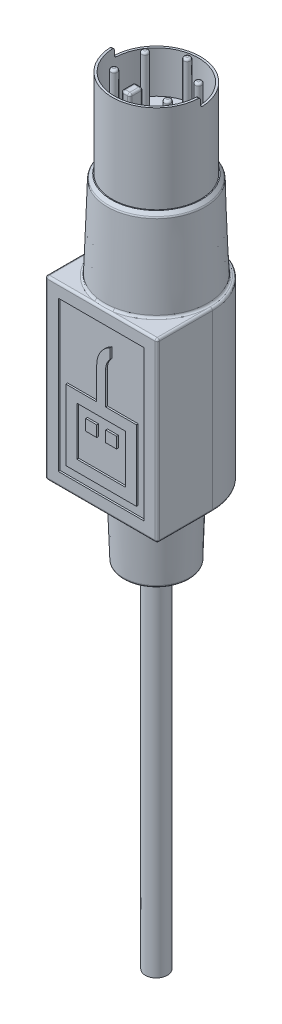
ISO-10303-21;
HEADER;
FILE_DESCRIPTION(('STEP AP214'),'2;1');
FILE_NAME('part.step','',(''),(''),'','','');
FILE_SCHEMA(('AUTOMOTIVE_DESIGN { 1 0 10303 214 1 1 1 1 }'));
ENDSEC;
DATA;
#1=APPLICATION_CONTEXT('core data for automotive mechanical design processes');
#2=APPLICATION_PROTOCOL_DEFINITION('international standard','automotive_design',2000,#1);
#3=PRODUCT_CONTEXT('',#1,'mechanical');
#4=PRODUCT('Part','Part','',(#3));
#5=PRODUCT_RELATED_PRODUCT_CATEGORY('part','',(#4));
#6=PRODUCT_DEFINITION_FORMATION('','',#4);
#7=PRODUCT_DEFINITION_CONTEXT('part definition',#1,'design');
#8=PRODUCT_DEFINITION('design','',#6,#7);
#9=PRODUCT_DEFINITION_SHAPE('','',#8);
#10=(LENGTH_UNIT() NAMED_UNIT(*) SI_UNIT(.MILLI.,.METRE.));
#11=(NAMED_UNIT(*) PLANE_ANGLE_UNIT() SI_UNIT($,.RADIAN.));
#12=(NAMED_UNIT(*) SI_UNIT($,.STERADIAN.) SOLID_ANGLE_UNIT());
#13=UNCERTAINTY_MEASURE_WITH_UNIT(LENGTH_MEASURE(1.E-05),#10,'distance_accuracy_value','');
#14=(GEOMETRIC_REPRESENTATION_CONTEXT(3) GLOBAL_UNCERTAINTY_ASSIGNED_CONTEXT((#13)) GLOBAL_UNIT_ASSIGNED_CONTEXT((#10,
#11,#12)) REPRESENTATION_CONTEXT('',''));
#15=CARTESIAN_POINT('',(0.,0.,0.));
#16=DIRECTION('',(0.,0.,1.));
#17=DIRECTION('',(1.,0.,0.));
#18=AXIS2_PLACEMENT_3D('',#15,#16,#17);
#19=CARTESIAN_POINT('',(0.,-48.26,0.));
#20=DIRECTION('',(0.,-1.,0.));
#21=DIRECTION('',(0.,0.,-1.));
#22=AXIS2_PLACEMENT_3D('',#19,#20,#21);
#23=PLANE('',#22);
#24=CARTESIAN_POINT('',(0.,-48.26,0.));
#25=DIRECTION('',(0.,-1.,0.));
#26=DIRECTION('',(0.,0.,-1.));
#27=AXIS2_PLACEMENT_3D('',#24,#25,#26);
#28=CIRCLE('',#27,4.4185987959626);
#29=CARTESIAN_POINT('',(0.,-48.26,-4.4185987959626));
#30=VERTEX_POINT('',#29);
#31=EDGE_CURVE('E70',#30,#30,#28,.T.);
#32=ORIENTED_EDGE('',*,*,#31,.T.);
#33=EDGE_LOOP('',(#32));
#34=FACE_BOUND('',#33,.T.);
#35=CARTESIAN_POINT('',(0.,-48.26,0.));
#36=DIRECTION('',(0.,-1.,0.));
#37=DIRECTION('',(0.,0.,-1.));
#38=AXIS2_PLACEMENT_3D('',#35,#36,#37);
#39=CIRCLE('',#38,1.5875);
#40=CARTESIAN_POINT('',(0.,-48.26,-1.5875));
#41=VERTEX_POINT('',#40);
#42=EDGE_CURVE('E443',#41,#41,#39,.T.);
#43=ORIENTED_EDGE('',*,*,#42,.F.);
#44=EDGE_LOOP('',(#43));
#45=FACE_BOUND('',#44,.T.);
#46=ADVANCED_FACE('F62',(#34,#45),#23,.T.);
#47=CARTESIAN_POINT('',(-8.0634937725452,-38.1,7.9375));
#48=DIRECTION('',(0.,0.,-1.));
#49=DIRECTION('',(-1.,0.,0.));
#50=AXIS2_PLACEMENT_3D('',#47,#48,#49);
#51=PLANE('',#50);
#52=CARTESIAN_POINT('',(2.89370703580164,-20.1218534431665,7.9375));
#53=DIRECTION('',(0.,0.,1.));
#54=DIRECTION('',(1.,0.,0.));
#55=AXIS2_PLACEMENT_3D('',#52,#53,#54);
#56=CIRCLE('',#55,2.25870703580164);
#57=CARTESIAN_POINT('',(0.635,-20.1218534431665,7.9375));
#58=VERTEX_POINT('',#57);
#59=CARTESIAN_POINT('',(1.28849925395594,-18.5328079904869,7.9375));
#60=VERTEX_POINT('',#59);
#61=EDGE_CURVE('E498',#58,#60,#56,.F.);
#62=ORIENTED_EDGE('',*,*,#61,.T.);
#63=DIRECTION('',(0.,-1.,0.));
#64=VECTOR('',#63,1.);
#65=CARTESIAN_POINT('',(1.28849925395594,-44.8750953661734,7.9375));
#66=LINE('',#65,#64);
#67=CARTESIAN_POINT('',(1.28849925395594,-17.0559980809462,7.9375));
#68=VERTEX_POINT('',#67);
#69=EDGE_CURVE('E582',#68,#60,#66,.T.);
#70=ORIENTED_EDGE('',*,*,#69,.F.);
#71=CARTESIAN_POINT('',(2.77007500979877,-20.1218534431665,7.9375));
#72=DIRECTION('',(0.,0.,1.));
#73=DIRECTION('',(1.,0.,0.));
#74=AXIS2_PLACEMENT_3D('',#71,#72,#73);
#75=CIRCLE('',#74,3.40507500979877);
#76=CARTESIAN_POINT('',(-0.635,-20.1218534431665,7.9375));
#77=VERTEX_POINT('',#76);
#78=EDGE_CURVE('E579',#77,#68,#75,.F.);
#79=ORIENTED_EDGE('',*,*,#78,.F.);
#80=DIRECTION('',(0.,1.,0.));
#81=VECTOR('',#80,1.);
#82=CARTESIAN_POINT('',(-0.635,-44.8750953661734,7.9375));
#83=LINE('',#82,#81);
#84=CARTESIAN_POINT('',(-0.635,-24.765,7.9375));
#85=VERTEX_POINT('',#84);
#86=EDGE_CURVE('E576',#85,#77,#83,.T.);
#87=ORIENTED_EDGE('',*,*,#86,.F.);
#88=DIRECTION('',(-1.,0.,0.));
#89=VECTOR('',#88,1.);
#90=CARTESIAN_POINT('',(0.,-24.765,7.9375));
#91=LINE('',#90,#89);
#92=CARTESIAN_POINT('',(-5.08,-24.765,7.9375));
#93=VERTEX_POINT('',#92);
#94=EDGE_CURVE('E567',#85,#93,#91,.T.);
#95=ORIENTED_EDGE('',*,*,#94,.T.);
#96=DIRECTION('',(0.,-1.,0.));
#97=VECTOR('',#96,1.);
#98=CARTESIAN_POINT('',(-5.08,-44.8750953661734,7.9375));
#99=LINE('',#98,#97);
#100=CARTESIAN_POINT('',(-5.08,-34.925,7.9375));
#101=VERTEX_POINT('',#100);
#102=EDGE_CURVE('E573',#93,#101,#99,.T.);
#103=ORIENTED_EDGE('',*,*,#102,.T.);
#104=DIRECTION('',(-1.,0.,0.));
#105=VECTOR('',#104,1.);
#106=CARTESIAN_POINT('',(0.,-34.925,7.9375));
#107=LINE('',#106,#105);
#108=CARTESIAN_POINT('',(5.08,-34.925,7.9375));
#109=VERTEX_POINT('',#108);
#110=EDGE_CURVE('E570',#109,#101,#107,.T.);
#111=ORIENTED_EDGE('',*,*,#110,.F.);
#112=DIRECTION('',(0.,-1.,0.));
#113=VECTOR('',#112,1.);
#114=CARTESIAN_POINT('',(5.08,-44.8750953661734,7.9375));
#115=LINE('',#114,#113);
#116=CARTESIAN_POINT('',(5.08,-24.765,7.9375));
#117=VERTEX_POINT('',#116);
#118=EDGE_CURVE('E566',#117,#109,#115,.T.);
#119=ORIENTED_EDGE('',*,*,#118,.F.);
#120=CARTESIAN_POINT('',(0.635,-24.765,7.9375));
#121=VERTEX_POINT('',#120);
#122=EDGE_CURVE('E563',#117,#121,#91,.T.);
#123=ORIENTED_EDGE('',*,*,#122,.T.);
#124=DIRECTION('',(0.,1.,0.));
#125=VECTOR('',#124,1.);
#126=CARTESIAN_POINT('',(0.635,-44.8750953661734,7.9375));
#127=LINE('',#126,#125);
#128=EDGE_CURVE('E560',#121,#58,#127,.T.);
#129=ORIENTED_EDGE('',*,*,#128,.T.);
#130=EDGE_LOOP('',(#62,#70,#79,#87,#95,#103,#111,#119,#123,#129));
#131=FACE_BOUND('',#130,.T.);
#132=DIRECTION('',(0.,-1.,0.));
#133=VECTOR('',#132,1.);
#134=CARTESIAN_POINT('',(3.4925,-44.8750953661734,7.9375));
#135=LINE('',#134,#133);
#136=CARTESIAN_POINT('',(3.4925,-26.3525,7.9375));
#137=VERTEX_POINT('',#136);
#138=CARTESIAN_POINT('',(3.4925,-33.3375,7.9375));
#139=VERTEX_POINT('',#138);
#140=EDGE_CURVE('E77',#137,#139,#135,.T.);
#141=ORIENTED_EDGE('',*,*,#140,.T.);
#142=DIRECTION('',(-1.,0.,0.));
#143=VECTOR('',#142,1.);
#144=CARTESIAN_POINT('',(0.,-33.3375,7.9375));
#145=LINE('',#144,#143);
#146=CARTESIAN_POINT('',(-3.4925,-33.3375,7.9375));
#147=VERTEX_POINT('',#146);
#148=EDGE_CURVE('E486',#139,#147,#145,.T.);
#149=ORIENTED_EDGE('',*,*,#148,.T.);
#150=DIRECTION('',(0.,-1.,0.));
#151=VECTOR('',#150,1.);
#152=CARTESIAN_POINT('',(-3.4925,-44.8750953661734,7.9375));
#153=LINE('',#152,#151);
#154=CARTESIAN_POINT('',(-3.4925,-26.3525,7.9375));
#155=VERTEX_POINT('',#154);
#156=EDGE_CURVE('E483',#155,#147,#153,.T.);
#157=ORIENTED_EDGE('',*,*,#156,.F.);
#158=DIRECTION('',(-1.,0.,0.));
#159=VECTOR('',#158,1.);
#160=CARTESIAN_POINT('',(0.,-26.3525,7.9375));
#161=LINE('',#160,#159);
#162=EDGE_CURVE('E480',#137,#155,#161,.T.);
#163=ORIENTED_EDGE('',*,*,#162,.F.);
#164=EDGE_LOOP('',(#141,#149,#157,#163));
#165=FACE_BOUND('',#164,.T.);
#166=ADVANCED_FACE('F1053',(#131,#165),#51,.F.);
#167=CARTESIAN_POINT('',(0.,-38.1,0.));
#168=DIRECTION('',(0.,-1.,0.));
#169=DIRECTION('',(0.,0.,-1.));
#170=AXIS2_PLACEMENT_3D('',#167,#168,#169);
#171=PLANE('',#170);
#172=CARTESIAN_POINT('',(0.,-38.1,0.));
#173=DIRECTION('',(0.,-1.,0.));
#174=DIRECTION('',(0.,0.,-1.));
#175=AXIS2_PLACEMENT_3D('',#172,#173,#174);
#176=CIRCLE('',#175,5.38660618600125);
#177=CARTESIAN_POINT('',(0.,-38.1,-5.38660618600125));
#178=VERTEX_POINT('',#177);
#179=EDGE_CURVE('E1205',#178,#178,#176,.F.);
#180=ORIENTED_EDGE('',*,*,#179,.T.);
#181=EDGE_LOOP('',(#180));
#182=FACE_BOUND('',#181,.T.);
#183=DIRECTION('',(0.,0.,-1.));
#184=VECTOR('',#183,1.);
#185=CARTESIAN_POINT('',(-7.7459937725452,-38.1,0.));
#186=LINE('',#185,#184);
#187=CARTESIAN_POINT('',(-7.7459937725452,-38.1,7.62));
#188=VERTEX_POINT('',#187);
#189=CARTESIAN_POINT('',(-7.7459937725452,-38.1,0.));
#190=VERTEX_POINT('',#189);
#191=EDGE_CURVE('E1200',#188,#190,#186,.T.);
#192=ORIENTED_EDGE('',*,*,#191,.T.);
#193=CARTESIAN_POINT('',(0.,-38.1,0.));
#194=DIRECTION('',(0.,-1.,0.));
#195=DIRECTION('',(0.,0.,-1.));
#196=AXIS2_PLACEMENT_3D('',#193,#194,#195);
#197=CIRCLE('',#196,7.7459937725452);
#198=CARTESIAN_POINT('',(7.7459937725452,-38.1,0.));
#199=VERTEX_POINT('',#198);
#200=EDGE_CURVE('E1202',#190,#199,#197,.T.);
#201=ORIENTED_EDGE('',*,*,#200,.T.);
#202=DIRECTION('',(0.,0.,1.));
#203=VECTOR('',#202,1.);
#204=CARTESIAN_POINT('',(7.7459937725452,-38.1,7.62));
#205=LINE('',#204,#203);
#206=CARTESIAN_POINT('',(7.7459937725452,-38.1,7.62));
#207=VERTEX_POINT('',#206);
#208=EDGE_CURVE('E1192',#199,#207,#205,.T.);
#209=ORIENTED_EDGE('',*,*,#208,.T.);
#210=DIRECTION('',(-1.,0.,0.));
#211=VECTOR('',#210,1.);
#212=CARTESIAN_POINT('',(-7.7459937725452,-38.1,7.62));
#213=LINE('',#212,#211);
#214=EDGE_CURVE('E1195',#207,#188,#213,.T.);
#215=ORIENTED_EDGE('',*,*,#214,.T.);
#216=EDGE_LOOP('',(#192,#201,#209,#215));
#217=FACE_BOUND('',#216,.T.);
#218=ADVANCED_FACE('F798',(#182,#217),#171,.T.);
#219=CARTESIAN_POINT('',(0.,12.7,0.));
#220=DIRECTION('',(0.,-1.,0.));
#221=DIRECTION('',(0.,0.,-1.));
#222=AXIS2_PLACEMENT_3D('',#219,#220,#221);
#223=CYLINDRICAL_SURFACE('',#222,6.35);
#224=DIRECTION('',(0.,-1.,0.));
#225=VECTOR('',#224,1.);
#226=CARTESIAN_POINT('',(6.35,12.7,0.));
#227=LINE('',#226,#225);
#228=CARTESIAN_POINT('',(6.35,12.3825,0.));
#229=VERTEX_POINT('',#228);
#230=CARTESIAN_POINT('',(6.35,11.7475,0.));
#231=VERTEX_POINT('',#230);
#232=EDGE_CURVE('E669',#229,#231,#227,.T.);
#233=ORIENTED_EDGE('',*,*,#232,.F.);
#234=CARTESIAN_POINT('',(6.35,12.3825,0.));
#235=CARTESIAN_POINT('',(6.34999785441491,12.4003615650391,-1.51700903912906E-05));
#236=CARTESIAN_POINT('',(6.34999996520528,12.418218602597,0.00150634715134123));
#237=CARTESIAN_POINT('',(6.34999683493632,12.4534139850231,0.0075108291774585));
#238=CARTESIAN_POINT('',(6.34999159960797,12.4707527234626,0.0119914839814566));
#239=CARTESIAN_POINT('',(6.34995795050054,12.5044393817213,0.0238054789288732));
#240=CARTESIAN_POINT('',(6.34992952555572,12.5207868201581,0.0311401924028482));
#241=CARTESIAN_POINT('',(6.3498210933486,12.5520155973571,0.0484476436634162));
#242=CARTESIAN_POINT('',(6.34974109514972,12.5668971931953,0.0584199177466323));
#243=CARTESIAN_POINT('',(6.34949668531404,12.5947731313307,0.0807195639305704));
#244=CARTESIAN_POINT('',(6.34933228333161,12.6077676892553,0.0930466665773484));
#245=CARTESIAN_POINT('',(6.34888551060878,12.6315049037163,0.119708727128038));
#246=CARTESIAN_POINT('',(6.34860311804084,12.6422471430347,0.134044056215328));
#247=CARTESIAN_POINT('',(6.34789194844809,12.6611691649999,0.164306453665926));
#248=CARTESIAN_POINT('',(6.34746320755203,12.6693495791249,0.180233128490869));
#249=CARTESIAN_POINT('',(6.34644045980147,12.6829176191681,0.213225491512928));
#250=CARTESIAN_POINT('',(6.34584654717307,12.6883068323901,0.230290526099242));
#251=CARTESIAN_POINT('',(6.34472080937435,12.6948104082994,0.259132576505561));
#252=CARTESIAN_POINT('',(6.34423673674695,12.6967555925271,0.270730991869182));
#253=CARTESIAN_POINT('',(6.34319879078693,12.699350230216,0.294051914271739));
#254=CARTESIAN_POINT('',(6.34264501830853,12.7000015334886,0.305774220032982));
#255=CARTESIAN_POINT('',(6.34205753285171,12.7000000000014,0.317499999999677));
#256=B_SPLINE_CURVE_WITH_KNOTS('',3,(#234,#235,#236,#237,#238,#239,#240,#241,#242,#243,#244,
#245,#246,#247,#248,#249,#250,#251,#252,#253,#254,#255),.UNSPECIFIED.,.F.,.F.,(4,2,2,2,2,2,2,2,
2,2,4),(0.,0.0535135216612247,0.106985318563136,0.160482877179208,0.213971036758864,
0.267453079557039,0.320945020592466,0.374423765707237,0.427872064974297,0.463115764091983,
0.498309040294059),.UNSPECIFIED.);
#257=CARTESIAN_POINT('',(6.34205753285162,12.7,0.3175));
#258=VERTEX_POINT('',#257);
#259=EDGE_CURVE('E781',#229,#258,#256,.T.);
#260=ORIENTED_EDGE('',*,*,#259,.T.);
#261=CARTESIAN_POINT('',(0.,12.7,0.));
#262=DIRECTION('',(0.,1.,0.));
#263=DIRECTION('',(0.,0.,1.));
#264=AXIS2_PLACEMENT_3D('',#261,#262,#263);
#265=CIRCLE('',#264,6.35);
#266=CARTESIAN_POINT('',(-6.34205753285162,12.7,0.3175));
#267=VERTEX_POINT('',#266);
#268=EDGE_CURVE('E682',#267,#258,#265,.T.);
#269=ORIENTED_EDGE('',*,*,#268,.F.);
#270=CARTESIAN_POINT('',(-6.34205753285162,12.7,0.3175));
#271=CARTESIAN_POINT('',(-6.34295341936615,12.7000153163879,0.299662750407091));
#272=CARTESIAN_POINT('',(-6.34376813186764,12.69849773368,0.281825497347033));
#273=CARTESIAN_POINT('',(-6.34523111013,12.6925054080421,0.246661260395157));
#274=CARTESIAN_POINT('',(-6.34587950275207,12.6880329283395,0.229333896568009));
#275=CARTESIAN_POINT('',(-6.34700741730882,12.6762360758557,0.195662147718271));
#276=CARTESIAN_POINT('',(-6.34748685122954,12.6689102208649,0.179318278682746));
#277=CARTESIAN_POINT('',(-6.34829207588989,12.6516197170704,0.148091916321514));
#278=CARTESIAN_POINT('',(-6.34861789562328,12.6416555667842,0.13320914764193));
#279=CARTESIAN_POINT('',(-6.34914161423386,12.6193766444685,0.105335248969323));
#280=CARTESIAN_POINT('',(-6.34933959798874,12.6070634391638,0.0923428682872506));
#281=CARTESIAN_POINT('',(-6.34964051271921,12.5804284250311,0.0686047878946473));
#282=CARTESIAN_POINT('',(-6.34974342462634,12.5661062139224,0.0578595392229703));
#283=CARTESIAN_POINT('',(-6.34988781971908,12.535856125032,0.0389198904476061));
#284=CARTESIAN_POINT('',(-6.3499292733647,12.5199274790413,0.0307267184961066));
#285=CARTESIAN_POINT('',(-6.3499805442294,12.486924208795,0.0171338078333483));
#286=CARTESIAN_POINT('',(-6.34999037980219,12.4698502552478,0.0117324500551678));
#287=CARTESIAN_POINT('',(-6.34999839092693,12.4409777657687,0.00520953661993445));
#288=CARTESIAN_POINT('',(-6.34999939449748,12.4293601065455,0.00325717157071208));
#289=CARTESIAN_POINT('',(-6.3500000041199,12.4059965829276,0.00065255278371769));
#290=CARTESIAN_POINT('',(-6.34999961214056,12.3942509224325,-1.53049586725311E-06));
#291=CARTESIAN_POINT('',(-6.35,12.3825,0.));
#292=B_SPLINE_CURVE_WITH_KNOTS('',3,(#270,#271,#272,#273,#274,#275,#276,#277,#278,#279,#280,
#281,#282,#283,#284,#285,#286,#287,#288,#289,#290,#291),.UNSPECIFIED.,.F.,.F.,(4,2,2,2,2,2,2,2,
2,2,4),(0.,0.0535088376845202,0.106976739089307,0.16047245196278,0.213958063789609,
0.267408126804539,0.320868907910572,0.374355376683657,0.42781079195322,0.463084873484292,
0.49830921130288),.UNSPECIFIED.);
#293=CARTESIAN_POINT('',(-6.35,12.3825,0.));
#294=VERTEX_POINT('',#293);
#295=EDGE_CURVE('E773',#267,#294,#292,.T.);
#296=ORIENTED_EDGE('',*,*,#295,.T.);
#297=DIRECTION('',(0.,-1.,0.));
#298=VECTOR('',#297,1.);
#299=CARTESIAN_POINT('',(-6.35,12.7,0.));
#300=LINE('',#299,#298);
#301=CARTESIAN_POINT('',(-6.35,11.7475,0.));
#302=VERTEX_POINT('',#301);
#303=EDGE_CURVE('E672',#294,#302,#300,.T.);
#304=ORIENTED_EDGE('',*,*,#303,.T.);
#305=CARTESIAN_POINT('',(-6.35,11.7475,0.));
#306=CARTESIAN_POINT('',(-6.34999785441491,11.7296384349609,1.51700903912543E-05));
#307=CARTESIAN_POINT('',(-6.34999996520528,11.711781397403,-0.00150634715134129));
#308=CARTESIAN_POINT('',(-6.34999683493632,11.6765860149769,-0.0075108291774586));
#309=CARTESIAN_POINT('',(-6.34999159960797,11.6592472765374,-0.0119914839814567));
#310=CARTESIAN_POINT('',(-6.34995795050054,11.6255606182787,-0.0238054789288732));
#311=CARTESIAN_POINT('',(-6.34992952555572,11.6092131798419,-0.0311401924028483));
#312=CARTESIAN_POINT('',(-6.3498210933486,11.5779844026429,-0.0484476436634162));
#313=CARTESIAN_POINT('',(-6.34974109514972,11.5631028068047,-0.0584199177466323));
#314=CARTESIAN_POINT('',(-6.34949668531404,11.5352268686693,-0.0807195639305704));
#315=CARTESIAN_POINT('',(-6.34933228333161,11.5222323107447,-0.0930466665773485));
#316=CARTESIAN_POINT('',(-6.34888551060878,11.4984950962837,-0.119708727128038));
#317=CARTESIAN_POINT('',(-6.34860311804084,11.4877528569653,-0.134044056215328));
#318=CARTESIAN_POINT('',(-6.34789194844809,11.4688308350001,-0.164306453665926));
#319=CARTESIAN_POINT('',(-6.34746320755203,11.4606504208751,-0.180233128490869));
#320=CARTESIAN_POINT('',(-6.34644045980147,11.4470823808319,-0.213225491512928));
#321=CARTESIAN_POINT('',(-6.34584654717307,11.4416931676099,-0.230290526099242));
#322=CARTESIAN_POINT('',(-6.34472080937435,11.4351895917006,-0.259132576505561));
#323=CARTESIAN_POINT('',(-6.34423673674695,11.4332444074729,-0.270730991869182));
#324=CARTESIAN_POINT('',(-6.34319879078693,11.430649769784,-0.294051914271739));
#325=CARTESIAN_POINT('',(-6.34264501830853,11.4299984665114,-0.305774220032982));
#326=CARTESIAN_POINT('',(-6.34205753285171,11.4299999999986,-0.317499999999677));
#327=B_SPLINE_CURVE_WITH_KNOTS('',3,(#305,#306,#307,#308,#309,#310,#311,#312,#313,#314,#315,
#316,#317,#318,#319,#320,#321,#322,#323,#324,#325,#326),.UNSPECIFIED.,.F.,.F.,(4,2,2,2,2,2,2,2,
2,2,4),(0.,0.0535135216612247,0.106985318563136,0.160482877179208,0.213971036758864,
0.267453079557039,0.320945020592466,0.374423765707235,0.427872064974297,0.463115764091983,
0.498309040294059),.UNSPECIFIED.);
#328=CARTESIAN_POINT('',(-6.34205753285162,11.43,-0.3175));
#329=VERTEX_POINT('',#328);
#330=EDGE_CURVE('E869',#302,#329,#327,.T.);
#331=ORIENTED_EDGE('',*,*,#330,.T.);
#332=CARTESIAN_POINT('',(0.,11.43,0.));
#333=DIRECTION('',(0.,-1.,0.));
#334=DIRECTION('',(0.,0.,-1.));
#335=AXIS2_PLACEMENT_3D('',#332,#333,#334);
#336=CIRCLE('',#335,6.35);
#337=CARTESIAN_POINT('',(6.34205753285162,11.43,-0.3175));
#338=VERTEX_POINT('',#337);
#339=EDGE_CURVE('E676',#329,#338,#336,.T.);
#340=ORIENTED_EDGE('',*,*,#339,.T.);
#341=CARTESIAN_POINT('',(6.34205753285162,11.43,-0.3175));
#342=CARTESIAN_POINT('',(6.34295341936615,11.4299846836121,-0.299662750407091));
#343=CARTESIAN_POINT('',(6.34376813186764,11.43150226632,-0.281825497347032));
#344=CARTESIAN_POINT('',(6.34523111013,11.4374945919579,-0.246661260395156));
#345=CARTESIAN_POINT('',(6.34587950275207,11.4419670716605,-0.229333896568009));
#346=CARTESIAN_POINT('',(6.34700741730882,11.4537639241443,-0.195662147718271));
#347=CARTESIAN_POINT('',(6.34748685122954,11.4610897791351,-0.179318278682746));
#348=CARTESIAN_POINT('',(6.34829207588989,11.4783802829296,-0.148091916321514));
#349=CARTESIAN_POINT('',(6.34861789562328,11.4883444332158,-0.13320914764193));
#350=CARTESIAN_POINT('',(6.34914161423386,11.5106233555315,-0.105335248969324));
#351=CARTESIAN_POINT('',(6.34933959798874,11.5229365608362,-0.0923428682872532));
#352=CARTESIAN_POINT('',(6.34964051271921,11.5495715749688,-0.0686047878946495));
#353=CARTESIAN_POINT('',(6.34974342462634,11.5638937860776,-0.0578595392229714));
#354=CARTESIAN_POINT('',(6.34988781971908,11.594143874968,-0.0389198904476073));
#355=CARTESIAN_POINT('',(6.3499292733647,11.6100725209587,-0.0307267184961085));
#356=CARTESIAN_POINT('',(6.3499805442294,11.643075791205,-0.0171338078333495));
#357=CARTESIAN_POINT('',(6.34999037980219,11.6601497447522,-0.0117324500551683));
#358=CARTESIAN_POINT('',(6.34999839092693,11.6890222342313,-0.00520953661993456));
#359=CARTESIAN_POINT('',(6.34999939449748,11.7006398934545,-0.00325717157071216));
#360=CARTESIAN_POINT('',(6.3500000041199,11.7240034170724,-0.00065255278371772));
#361=CARTESIAN_POINT('',(6.34999961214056,11.7357490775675,1.53049586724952E-06));
#362=CARTESIAN_POINT('',(6.35,11.7475,0.));
#363=B_SPLINE_CURVE_WITH_KNOTS('',3,(#341,#342,#343,#344,#345,#346,#347,#348,#349,#350,#351,
#352,#353,#354,#355,#356,#357,#358,#359,#360,#361,#362),.UNSPECIFIED.,.F.,.F.,(4,2,2,2,2,2,2,2,
2,2,4),(0.,0.0535088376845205,0.106976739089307,0.16047245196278,0.213958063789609,
0.267408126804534,0.320868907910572,0.37435537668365,0.42781079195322,0.463084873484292,
0.49830921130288),.UNSPECIFIED.);
#364=EDGE_CURVE('E808',#338,#231,#363,.T.);
#365=ORIENTED_EDGE('',*,*,#364,.T.);
#366=EDGE_LOOP('',(#233,#260,#269,#296,#304,#331,#340,#365));
#367=FACE_BOUND('',#366,.T.);
#368=CARTESIAN_POINT('',(0.,0.,0.));
#369=DIRECTION('',(0.,-1.,0.));
#370=DIRECTION('',(0.,0.,-1.));
#371=AXIS2_PLACEMENT_3D('',#368,#369,#370);
#372=CIRCLE('',#371,6.35);
#373=CARTESIAN_POINT('',(0.,0.,-6.35));
#374=VERTEX_POINT('',#373);
#375=EDGE_CURVE('E665',#374,#374,#372,.T.);
#376=ORIENTED_EDGE('',*,*,#375,.F.);
#377=EDGE_LOOP('',(#376));
#378=FACE_BOUND('',#377,.T.);
#379=ADVANCED_FACE('F792',(#367,#378),#223,.T.);
#380=CARTESIAN_POINT('',(0.,12.7,0.));
#381=DIRECTION('',(0.,1.,0.));
#382=DIRECTION('',(0.,0.,1.));
#383=AXIS2_PLACEMENT_3D('',#380,#381,#382);
#384=PLANE('',#383);
#385=ORIENTED_EDGE('',*,*,#268,.T.);
#386=DIRECTION('',(1.,0.,0.));
#387=VECTOR('',#386,1.);
#388=CARTESIAN_POINT('',(6.0325,12.7,0.3175));
#389=LINE('',#388,#387);
#390=CARTESIAN_POINT('',(6.02413894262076,12.7,0.3175));
#391=VERTEX_POINT('',#390);
#392=EDGE_CURVE('E2209',#258,#391,#389,.F.);
#393=ORIENTED_EDGE('',*,*,#392,.T.);
#394=CARTESIAN_POINT('',(0.,12.7,0.));
#395=DIRECTION('',(0.,1.,0.));
#396=DIRECTION('',(0.,0.,1.));
#397=AXIS2_PLACEMENT_3D('',#394,#395,#396);
#398=CIRCLE('',#397,6.0325);
#399=CARTESIAN_POINT('',(-6.02413894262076,12.7,0.3175));
#400=VERTEX_POINT('',#399);
#401=EDGE_CURVE('E679',#400,#391,#398,.T.);
#402=ORIENTED_EDGE('',*,*,#401,.F.);
#403=DIRECTION('',(1.,0.,0.));
#404=VECTOR('',#403,1.);
#405=CARTESIAN_POINT('',(-6.35,12.7,0.3175));
#406=LINE('',#405,#404);
#407=EDGE_CURVE('E2211',#400,#267,#406,.F.);
#408=ORIENTED_EDGE('',*,*,#407,.T.);
#409=EDGE_LOOP('',(#385,#393,#402,#408));
#410=FACE_BOUND('',#409,.T.);
#411=ADVANCED_FACE('F797',(#410),#384,.T.);
#412=CARTESIAN_POINT('',(0.,12.7,0.));
#413=DIRECTION('',(0.,-1.,0.));
#414=DIRECTION('',(0.,0.,-1.));
#415=AXIS2_PLACEMENT_3D('',#412,#413,#414);
#416=CYLINDRICAL_SURFACE('',#415,6.0325);
#417=CARTESIAN_POINT('',(0.,5.3975,0.));
#418=DIRECTION('',(0.,1.,0.));
#419=DIRECTION('',(0.,0.,1.));
#420=AXIS2_PLACEMENT_3D('',#417,#418,#419);
#421=CIRCLE('',#420,6.0325);
#422=CARTESIAN_POINT('',(0.,5.3975,6.0325));
#423=VERTEX_POINT('',#422);
#424=EDGE_CURVE('E1193',#423,#423,#421,.T.);
#425=ORIENTED_EDGE('',*,*,#424,.F.);
#426=EDGE_LOOP('',(#425));
#427=FACE_BOUND('',#426,.T.);
#428=ORIENTED_EDGE('',*,*,#401,.T.);
#429=CARTESIAN_POINT('',(6.02413894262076,12.7,0.3175));
#430=CARTESIAN_POINT('',(6.02508196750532,12.7000153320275,0.299665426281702));
#431=CARTESIAN_POINT('',(6.02593956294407,12.6984981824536,0.281830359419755));
#432=CARTESIAN_POINT('',(6.02747957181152,12.6925072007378,0.246669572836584));
#433=CARTESIAN_POINT('',(6.02816211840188,12.6880356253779,0.2293434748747));
#434=CARTESIAN_POINT('',(6.02934946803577,12.6762406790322,0.195673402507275));
#435=CARTESIAN_POINT('',(6.02985417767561,12.6689158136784,0.179329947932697));
#436=CARTESIAN_POINT('',(6.03070186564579,12.6516272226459,0.148103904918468));
#437=CARTESIAN_POINT('',(6.03104487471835,12.64166399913,0.133221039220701));
#438=CARTESIAN_POINT('',(6.03159621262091,12.6193875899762,0.105347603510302));
#439=CARTESIAN_POINT('',(6.0318046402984,12.6070761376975,0.092355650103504));
#440=CARTESIAN_POINT('',(6.03212144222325,12.5804447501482,0.068617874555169));
#441=CARTESIAN_POINT('',(6.03222979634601,12.5661244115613,0.0578725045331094));
#442=CARTESIAN_POINT('',(6.03238183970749,12.5358776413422,0.0389317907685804));
#443=CARTESIAN_POINT('',(6.03242549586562,12.5199503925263,0.0307377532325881));
#444=CARTESIAN_POINT('',(6.03247949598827,12.4869497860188,0.0171427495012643));
#445=CARTESIAN_POINT('',(6.03248985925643,12.4698770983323,0.0117401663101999));
#446=CARTESIAN_POINT('',(6.03249830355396,12.4410013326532,0.00521377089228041));
#447=CARTESIAN_POINT('',(6.03249936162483,12.4293790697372,0.00325982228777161));
#448=CARTESIAN_POINT('',(6.03250000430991,12.4060061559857,0.000653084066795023));
#449=CARTESIAN_POINT('',(6.03249959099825,12.3942557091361,-1.53511421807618E-06));
#450=CARTESIAN_POINT('',(6.0325,12.3825,0.));
#451=B_SPLINE_CURVE_WITH_KNOTS('',3,(#429,#430,#431,#432,#433,#434,#435,#436,#437,#438,#439,
#440,#441,#442,#443,#444,#445,#446,#447,#448,#449,#450),.UNSPECIFIED.,.F.,.F.,(4,2,2,2,2,2,2,2,
2,2,4),(0.,0.0535081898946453,0.106975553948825,0.160470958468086,0.213956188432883,
0.267402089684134,0.320858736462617,0.374342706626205,0.427795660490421,0.463084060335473,
0.498322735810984),.UNSPECIFIED.);
#452=CARTESIAN_POINT('',(6.0325,12.3825,0.));
#453=VERTEX_POINT('',#452);
#454=EDGE_CURVE('E841',#391,#453,#451,.T.);
#455=ORIENTED_EDGE('',*,*,#454,.T.);
#456=DIRECTION('',(0.,-1.,0.));
#457=VECTOR('',#456,1.);
#458=CARTESIAN_POINT('',(6.0325,12.7,0.));
#459=LINE('',#458,#457);
#460=CARTESIAN_POINT('',(6.0325,11.7475,0.));
#461=VERTEX_POINT('',#460);
#462=EDGE_CURVE('E685',#461,#453,#459,.F.);
#463=ORIENTED_EDGE('',*,*,#462,.F.);
#464=CARTESIAN_POINT('',(6.0325,11.7475,0.));
#465=CARTESIAN_POINT('',(6.0324977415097,11.7296384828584,1.51700299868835E-05));
#466=CARTESIAN_POINT('',(6.0324999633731,11.7117814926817,-0.0015063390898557));
#467=CARTESIAN_POINT('',(6.03249666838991,11.6765861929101,-0.00751079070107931));
#468=CARTESIAN_POINT('',(6.03249115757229,11.6592474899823,-0.0119914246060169));
#469=CARTESIAN_POINT('',(6.03245573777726,11.625560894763,-0.0238053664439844));
#470=CARTESIAN_POINT('',(6.03242581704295,11.6092134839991,-0.031140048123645));
#471=CARTESIAN_POINT('',(6.03231167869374,11.5779847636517,-0.0484474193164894));
#472=CARTESIAN_POINT('',(6.03222747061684,11.5631031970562,-0.058419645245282));
#473=CARTESIAN_POINT('',(6.03197019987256,11.535227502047,-0.0807190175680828));
#474=CARTESIAN_POINT('',(6.03179714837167,11.522233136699,-0.093045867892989));
#475=CARTESIAN_POINT('',(6.03132687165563,11.4984963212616,-0.119707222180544));
#476=CARTESIAN_POINT('',(6.03102962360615,11.4877542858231,-0.134042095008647));
#477=CARTESIAN_POINT('',(6.03028106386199,11.4688331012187,-0.164302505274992));
#478=CARTESIAN_POINT('',(6.02982979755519,11.4606531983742,-0.180227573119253));
#479=CARTESIAN_POINT('',(6.02875333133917,11.4470857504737,-0.213216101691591));
#480=CARTESIAN_POINT('',(6.02812823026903,11.4416966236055,-0.230278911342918));
#481=CARTESIAN_POINT('',(6.0269432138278,11.435191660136,-0.259120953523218));
#482=CARTESIAN_POINT('',(6.02643352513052,11.4332456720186,-0.270721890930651));
#483=CARTESIAN_POINT('',(6.02534063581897,11.4306499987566,-0.294047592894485));
#484=CARTESIAN_POINT('',(6.02475754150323,11.4299984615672,-0.305772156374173));
#485=CARTESIAN_POINT('',(6.02413894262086,11.4299999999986,-0.317499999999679));
#486=B_SPLINE_CURVE_WITH_KNOTS('',3,(#464,#465,#466,#467,#468,#469,#470,#471,#472,#473,#474,
#475,#476,#477,#478,#479,#480,#481,#482,#483,#484,#485),.UNSPECIFIED.,.F.,.F.,(4,2,2,2,2,2,2,2,
2,2,4),(0.,0.053513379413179,0.106985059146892,0.160482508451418,0.213970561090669,
0.267451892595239,0.320943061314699,0.374418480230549,0.427863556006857,0.463118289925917,
0.4983225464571),.UNSPECIFIED.);
#487=CARTESIAN_POINT('',(6.02413894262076,11.43,-0.3175));
#488=VERTEX_POINT('',#487);
#489=EDGE_CURVE('E816',#461,#488,#486,.T.);
#490=ORIENTED_EDGE('',*,*,#489,.T.);
#491=CARTESIAN_POINT('',(0.,11.43,0.));
#492=DIRECTION('',(0.,-1.,0.));
#493=DIRECTION('',(0.,0.,-1.));
#494=AXIS2_PLACEMENT_3D('',#491,#492,#493);
#495=CIRCLE('',#494,6.0325);
#496=CARTESIAN_POINT('',(-6.02413894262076,11.43,-0.3175));
#497=VERTEX_POINT('',#496);
#498=EDGE_CURVE('E688',#497,#488,#495,.T.);
#499=ORIENTED_EDGE('',*,*,#498,.F.);
#500=CARTESIAN_POINT('',(-6.02413894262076,11.43,-0.3175));
#501=CARTESIAN_POINT('',(-6.02508196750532,11.4299846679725,-0.299665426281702));
#502=CARTESIAN_POINT('',(-6.02593956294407,11.4315018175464,-0.281830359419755));
#503=CARTESIAN_POINT('',(-6.02747957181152,11.4374927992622,-0.246669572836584));
#504=CARTESIAN_POINT('',(-6.02816211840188,11.4419643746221,-0.2293434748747));
#505=CARTESIAN_POINT('',(-6.02934946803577,11.4537593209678,-0.195673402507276));
#506=CARTESIAN_POINT('',(-6.02985417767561,11.4610841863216,-0.179329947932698));
#507=CARTESIAN_POINT('',(-6.03070186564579,11.4783727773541,-0.148103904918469));
#508=CARTESIAN_POINT('',(-6.03104487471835,11.48833600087,-0.133221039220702));
#509=CARTESIAN_POINT('',(-6.03159621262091,11.5106124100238,-0.105347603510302));
#510=CARTESIAN_POINT('',(-6.0318046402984,11.5229238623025,-0.092355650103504));
#511=CARTESIAN_POINT('',(-6.03212144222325,11.5495552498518,-0.0686178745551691));
#512=CARTESIAN_POINT('',(-6.03222979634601,11.5638755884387,-0.0578725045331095));
#513=CARTESIAN_POINT('',(-6.03238183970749,11.5941223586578,-0.0389317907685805));
#514=CARTESIAN_POINT('',(-6.03242549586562,11.6100496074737,-0.0307377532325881));
#515=CARTESIAN_POINT('',(-6.03247949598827,11.6430502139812,-0.0171427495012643));
#516=CARTESIAN_POINT('',(-6.03248985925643,11.6601229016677,-0.0117401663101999));
#517=CARTESIAN_POINT('',(-6.03249830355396,11.6889986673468,-0.00521377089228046));
#518=CARTESIAN_POINT('',(-6.03249936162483,11.7006209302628,-0.00325982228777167));
#519=CARTESIAN_POINT('',(-6.03250000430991,11.7239938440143,-0.000653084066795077));
#520=CARTESIAN_POINT('',(-6.03249959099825,11.7357442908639,1.53511421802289E-06));
#521=CARTESIAN_POINT('',(-6.0325,11.7475,0.));
#522=B_SPLINE_CURVE_WITH_KNOTS('',3,(#500,#501,#502,#503,#504,#505,#506,#507,#508,#509,#510,
#511,#512,#513,#514,#515,#516,#517,#518,#519,#520,#521),.UNSPECIFIED.,.F.,.F.,(4,2,2,2,2,2,2,2,
2,2,4),(0.,0.0535081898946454,0.106975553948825,0.160470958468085,0.213956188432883,
0.267402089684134,0.320858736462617,0.374342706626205,0.42779566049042,0.463084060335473,
0.498322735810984),.UNSPECIFIED.);
#523=CARTESIAN_POINT('',(-6.0325,11.7475,0.));
#524=VERTEX_POINT('',#523);
#525=EDGE_CURVE('E864',#497,#524,#522,.T.);
#526=ORIENTED_EDGE('',*,*,#525,.T.);
#527=DIRECTION('',(0.,-1.,0.));
#528=VECTOR('',#527,1.);
#529=CARTESIAN_POINT('',(-6.0325,12.7,0.));
#530=LINE('',#529,#528);
#531=CARTESIAN_POINT('',(-6.0325,12.3825,0.));
#532=VERTEX_POINT('',#531);
#533=EDGE_CURVE('E691',#532,#524,#530,.T.);
#534=ORIENTED_EDGE('',*,*,#533,.F.);
#535=CARTESIAN_POINT('',(-6.0325,12.3825,0.));
#536=CARTESIAN_POINT('',(-6.0324977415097,12.4003615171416,-1.51700299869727E-05));
#537=CARTESIAN_POINT('',(-6.0324999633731,12.4182185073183,0.00150633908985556));
#538=CARTESIAN_POINT('',(-6.03249666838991,12.4534138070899,0.00751079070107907));
#539=CARTESIAN_POINT('',(-6.03249115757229,12.4707525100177,0.0119914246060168));
#540=CARTESIAN_POINT('',(-6.03245573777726,12.504439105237,0.023805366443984));
#541=CARTESIAN_POINT('',(-6.03242581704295,12.5207865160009,0.031140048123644));
#542=CARTESIAN_POINT('',(-6.03231167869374,12.5520152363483,0.0484474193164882));
#543=CARTESIAN_POINT('',(-6.03222747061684,12.5668968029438,0.0584196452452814));
#544=CARTESIAN_POINT('',(-6.03197019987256,12.594772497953,0.0807190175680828));
#545=CARTESIAN_POINT('',(-6.03179714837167,12.607766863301,0.093045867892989));
#546=CARTESIAN_POINT('',(-6.03132687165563,12.6315036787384,0.119707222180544));
#547=CARTESIAN_POINT('',(-6.03102962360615,12.6422457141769,0.134042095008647));
#548=CARTESIAN_POINT('',(-6.03028106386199,12.6611668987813,0.164302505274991));
#549=CARTESIAN_POINT('',(-6.02982979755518,12.6693468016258,0.180227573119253));
#550=CARTESIAN_POINT('',(-6.02875333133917,12.6829142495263,0.213216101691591));
#551=CARTESIAN_POINT('',(-6.02812823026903,12.6883033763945,0.230278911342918));
#552=CARTESIAN_POINT('',(-6.0269432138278,12.694808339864,0.259120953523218));
#553=CARTESIAN_POINT('',(-6.02643352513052,12.6967543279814,0.270721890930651));
#554=CARTESIAN_POINT('',(-6.02534063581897,12.6993500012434,0.294047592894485));
#555=CARTESIAN_POINT('',(-6.02475754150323,12.7000015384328,0.305772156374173));
#556=CARTESIAN_POINT('',(-6.02413894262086,12.7000000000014,0.317499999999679));
#557=B_SPLINE_CURVE_WITH_KNOTS('',3,(#535,#536,#537,#538,#539,#540,#541,#542,#543,#544,#545,
#546,#547,#548,#549,#550,#551,#552,#553,#554,#555,#556),.UNSPECIFIED.,.F.,.F.,(4,2,2,2,2,2,2,2,
2,2,4),(0.,0.0535133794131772,0.106985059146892,0.160482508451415,0.213970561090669,
0.267451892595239,0.320943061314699,0.374418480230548,0.427863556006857,0.463118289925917,
0.4983225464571),.UNSPECIFIED.);
#558=EDGE_CURVE('E848',#532,#400,#557,.T.);
#559=ORIENTED_EDGE('',*,*,#558,.T.);
#560=EDGE_LOOP('',(#428,#455,#463,#490,#499,#526,#534,#559));
#561=FACE_BOUND('',#560,.T.);
#562=ADVANCED_FACE('F854',(#427,#561),#416,.F.);
#563=CARTESIAN_POINT('',(-6.35,11.43,-6.35));
#564=DIRECTION('',(0.,-1.,0.));
#565=DIRECTION('',(0.,0.,-1.));
#566=AXIS2_PLACEMENT_3D('',#563,#564,#565);
#567=PLANE('',#566);
#568=ORIENTED_EDGE('',*,*,#498,.T.);
#569=DIRECTION('',(1.,0.,0.));
#570=VECTOR('',#569,1.);
#571=CARTESIAN_POINT('',(6.35,11.43,-0.3175));
#572=LINE('',#571,#570);
#573=EDGE_CURVE('E765',#488,#338,#572,.T.);
#574=ORIENTED_EDGE('',*,*,#573,.T.);
#575=ORIENTED_EDGE('',*,*,#339,.F.);
#576=DIRECTION('',(1.,0.,0.));
#577=VECTOR('',#576,1.);
#578=CARTESIAN_POINT('',(-6.0325,11.43,-0.3175));
#579=LINE('',#578,#577);
#580=EDGE_CURVE('E762',#329,#497,#579,.T.);
#581=ORIENTED_EDGE('',*,*,#580,.T.);
#582=EDGE_LOOP('',(#568,#574,#575,#581));
#583=FACE_BOUND('',#582,.T.);
#584=ADVANCED_FACE('F858',(#583),#567,.F.);
#585=CARTESIAN_POINT('',(-6.35,12.7,0.));
#586=DIRECTION('',(0.,0.,1.));
#587=DIRECTION('',(0.,-1.,0.));
#588=AXIS2_PLACEMENT_3D('',#585,#586,#587);
#589=PLANE('',#588);
#590=ORIENTED_EDGE('',*,*,#533,.T.);
#591=DIRECTION('',(1.,0.,0.));
#592=VECTOR('',#591,1.);
#593=CARTESIAN_POINT('',(-6.35,11.7475,0.));
#594=LINE('',#593,#592);
#595=EDGE_CURVE('E817',#524,#302,#594,.F.);
#596=ORIENTED_EDGE('',*,*,#595,.T.);
#597=ORIENTED_EDGE('',*,*,#303,.F.);
#598=DIRECTION('',(1.,0.,0.));
#599=VECTOR('',#598,1.);
#600=CARTESIAN_POINT('',(-6.0325,12.3825,0.));
#601=LINE('',#600,#599);
#602=EDGE_CURVE('E847',#294,#532,#601,.T.);
#603=ORIENTED_EDGE('',*,*,#602,.T.);
#604=EDGE_LOOP('',(#590,#596,#597,#603));
#605=FACE_BOUND('',#604,.T.);
#606=ADVANCED_FACE('F1532',(#605),#589,.F.);
#607=ORIENTED_EDGE('',*,*,#232,.T.);
#608=DIRECTION('',(1.,0.,0.));
#609=VECTOR('',#608,1.);
#610=CARTESIAN_POINT('',(6.0325,11.7475,0.));
#611=LINE('',#610,#609);
#612=EDGE_CURVE('E771',#231,#461,#611,.F.);
#613=ORIENTED_EDGE('',*,*,#612,.T.);
#614=ORIENTED_EDGE('',*,*,#462,.T.);
#615=DIRECTION('',(1.,0.,0.));
#616=VECTOR('',#615,1.);
#617=CARTESIAN_POINT('',(6.35,12.3825,0.));
#618=LINE('',#617,#616);
#619=EDGE_CURVE('E768',#453,#229,#618,.T.);
#620=ORIENTED_EDGE('',*,*,#619,.T.);
#621=EDGE_LOOP('',(#607,#613,#614,#620));
#622=FACE_BOUND('',#621,.T.);
#623=ADVANCED_FACE('F829',(#622),#589,.F.);
#624=CARTESIAN_POINT('',(-6.35,11.7475,-0.3175));
#625=DIRECTION('',(-1.,0.,0.));
#626=DIRECTION('',(0.,0.,1.));
#627=AXIS2_PLACEMENT_3D('',#624,#625,#626);
#628=CYLINDRICAL_SURFACE('',#627,0.3175);
#629=ORIENTED_EDGE('',*,*,#489,.F.);
#630=ORIENTED_EDGE('',*,*,#612,.F.);
#631=ORIENTED_EDGE('',*,*,#364,.F.);
#632=ORIENTED_EDGE('',*,*,#573,.F.);
#633=EDGE_LOOP('',(#629,#630,#631,#632));
#634=FACE_BOUND('',#633,.T.);
#635=ADVANCED_FACE('F824',(#634),#628,.F.);
#636=CARTESIAN_POINT('',(-6.35,12.3825,0.3175));
#637=DIRECTION('',(-1.,0.,0.));
#638=DIRECTION('',(0.,0.,1.));
#639=AXIS2_PLACEMENT_3D('',#636,#637,#638);
#640=CYLINDRICAL_SURFACE('',#639,0.3175);
#641=ORIENTED_EDGE('',*,*,#454,.F.);
#642=ORIENTED_EDGE('',*,*,#392,.F.);
#643=ORIENTED_EDGE('',*,*,#259,.F.);
#644=ORIENTED_EDGE('',*,*,#619,.F.);
#645=EDGE_LOOP('',(#641,#642,#643,#644));
#646=FACE_BOUND('',#645,.T.);
#647=ADVANCED_FACE('F828',(#646),#640,.T.);
#648=CARTESIAN_POINT('',(-6.35,11.7475,-0.3175));
#649=DIRECTION('',(-1.,0.,0.));
#650=DIRECTION('',(0.,0.,1.));
#651=AXIS2_PLACEMENT_3D('',#648,#649,#650);
#652=CYLINDRICAL_SURFACE('',#651,0.3175);
#653=ORIENTED_EDGE('',*,*,#330,.F.);
#654=ORIENTED_EDGE('',*,*,#595,.F.);
#655=ORIENTED_EDGE('',*,*,#525,.F.);
#656=ORIENTED_EDGE('',*,*,#580,.F.);
#657=EDGE_LOOP('',(#653,#654,#655,#656));
#658=FACE_BOUND('',#657,.T.);
#659=ADVANCED_FACE('F836',(#658),#652,.F.);
#660=CARTESIAN_POINT('',(-6.35,12.3825,0.3175));
#661=DIRECTION('',(-1.,0.,0.));
#662=DIRECTION('',(0.,0.,1.));
#663=AXIS2_PLACEMENT_3D('',#660,#661,#662);
#664=CYLINDRICAL_SURFACE('',#663,0.3175);
#665=ORIENTED_EDGE('',*,*,#295,.F.);
#666=ORIENTED_EDGE('',*,*,#407,.F.);
#667=ORIENTED_EDGE('',*,*,#558,.F.);
#668=ORIENTED_EDGE('',*,*,#602,.F.);
#669=EDGE_LOOP('',(#665,#666,#667,#668));
#670=FACE_BOUND('',#669,.T.);
#671=ADVANCED_FACE('F788',(#670),#664,.T.);
#672=CARTESIAN_POINT('',(0.,0.,0.));
#673=DIRECTION('',(0.,-1.,0.));
#674=DIRECTION('',(0.,0.,-1.));
#675=AXIS2_PLACEMENT_3D('',#672,#673,#674);
#676=PLANE('',#675);
#677=CARTESIAN_POINT('',(0.,0.,0.));
#678=DIRECTION('',(0.,-1.,0.));
#679=DIRECTION('',(0.,0.,-1.));
#680=AXIS2_PLACEMENT_3D('',#677,#678,#679);
#681=CIRCLE('',#680,6.477);
#682=CARTESIAN_POINT('',(0.,0.,-6.477));
#683=VERTEX_POINT('',#682);
#684=EDGE_CURVE('E875',#683,#683,#681,.F.);
#685=ORIENTED_EDGE('',*,*,#684,.T.);
#686=EDGE_LOOP('',(#685));
#687=FACE_BOUND('',#686,.T.);
#688=ORIENTED_EDGE('',*,*,#375,.T.);
#689=EDGE_LOOP('',(#688));
#690=FACE_BOUND('',#689,.T.);
#691=ADVANCED_FACE('F1100',(#687,#690),#676,.F.);
#692=CARTESIAN_POINT('',(0.,0.,0.));
#693=DIRECTION('',(0.,-1.,0.));
#694=DIRECTION('',(0.,0.,-1.));
#695=AXIS2_PLACEMENT_3D('',#692,#693,#694);
#696=CONICAL_SURFACE('',#695,6.985,0.0349065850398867);
#697=CARTESIAN_POINT('',(0.,-12.393580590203,0.));
#698=DIRECTION('',(0.,-1.,0.));
#699=DIRECTION('',(0.,0.,-1.));
#700=AXIS2_PLACEMENT_3D('',#697,#698,#699);
#701=CIRCLE('',#700,7.41779337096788);
#702=CARTESIAN_POINT('',(1.27488998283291,-12.393580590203,7.30741500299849));
#703=VERTEX_POINT('',#702);
#704=CARTESIAN_POINT('',(-1.27488998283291,-12.393580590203,7.30741500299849));
#705=VERTEX_POINT('',#704);
#706=EDGE_CURVE('E2294',#703,#705,#701,.F.);
#707=ORIENTED_EDGE('',*,*,#706,.T.);
#708=CARTESIAN_POINT('',(2.56300790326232,-12.7428818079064,7.46065415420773));
#709=CARTESIAN_POINT('',(2.4978234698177,-12.8252206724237,7.31875054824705));
#710=CARTESIAN_POINT('',(2.46342588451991,-12.7389674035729,7.16860890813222));
#711=CARTESIAN_POINT('',(2.42902829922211,-12.6527141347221,7.01846726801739));
#712=CARTESIAN_POINT('',(2.45790977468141,-12.4793442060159,7.00191249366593));
#713=CARTESIAN_POINT('',(2.51327243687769,-12.7379324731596,7.46920127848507));
#714=CARTESIAN_POINT('',(2.45146809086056,-12.8149726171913,7.32628709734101));
#715=CARTESIAN_POINT('',(2.41782345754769,-12.7277284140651,7.1798915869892));
#716=CARTESIAN_POINT('',(2.38452618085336,-12.6405612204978,7.03340905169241));
#717=CARTESIAN_POINT('',(2.41020906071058,-12.4694455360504,7.01829240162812));
#718=CARTESIAN_POINT('',(2.46317381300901,-12.7336102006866,7.47754947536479));
#719=CARTESIAN_POINT('',(2.40423684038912,-12.8055564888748,7.33408060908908));
#720=CARTESIAN_POINT('',(2.37150761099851,-12.717554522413,7.19119859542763));
#721=CARTESIAN_POINT('',(2.33909800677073,-12.6296136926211,7.04823974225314));
#722=CARTESIAN_POINT('',(2.36216093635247,-12.4608009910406,7.03429237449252));
#723=CARTESIAN_POINT('',(2.36240367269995,-12.7260155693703,7.49380671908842));
#724=CARTESIAN_POINT('',(2.30872899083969,-12.7882966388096,7.34986298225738));
#725=CARTESIAN_POINT('',(2.27775303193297,-12.699064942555,7.2136518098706));
#726=CARTESIAN_POINT('',(2.24709494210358,-12.6098978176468,7.07736480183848));
#727=CARTESIAN_POINT('',(2.26551665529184,-12.4456117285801,7.06545275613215));
#728=CARTESIAN_POINT('',(2.31173247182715,-12.7227426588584,7.50171599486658));
#729=CARTESIAN_POINT('',(2.26042460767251,-12.780435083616,7.35785627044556));
#730=CARTESIAN_POINT('',(2.23031490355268,-12.690748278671,7.22479809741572));
#731=CARTESIAN_POINT('',(2.20049430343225,-12.6011063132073,7.09167386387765));
#732=CARTESIAN_POINT('',(2.21692080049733,-12.439065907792,7.08061360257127));
#733=CARTESIAN_POINT('',(2.15919830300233,-12.7141958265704,7.5247084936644));
#734=CARTESIAN_POINT('',(2.11493093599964,-12.7589985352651,7.38167104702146));
#735=CARTESIAN_POINT('',(2.08687561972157,-12.6681884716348,7.2576596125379));
#736=CARTESIAN_POINT('',(2.05996541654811,-12.577559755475,7.13338549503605));
#737=CARTESIAN_POINT('',(2.07063555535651,-12.4219722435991,7.1246891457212));
#738=CARTESIAN_POINT('',(2.05663063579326,-12.7101770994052,7.53908813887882));
#739=CARTESIAN_POINT('',(2.01595288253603,-12.74733107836,7.39753250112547));
#740=CARTESIAN_POINT('',(1.98957953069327,-12.6562961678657,7.27884054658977));
#741=CARTESIAN_POINT('',(1.96414784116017,-12.5653552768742,7.15995760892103));
#742=CARTESIAN_POINT('',(1.97227188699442,-12.4139347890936,7.15225769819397));
#743=CARTESIAN_POINT('',(1.8505197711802,-12.7043690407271,7.56577484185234));
#744=CARTESIAN_POINT('',(1.81638407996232,-12.7281395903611,7.4278825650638));
#745=CARTESIAN_POINT('',(1.79305250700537,-12.6370708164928,7.31880349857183));
#746=CARTESIAN_POINT('',(1.77064734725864,-12.5460907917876,7.20953555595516));
#747=CARTESIAN_POINT('',(1.77461127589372,-12.4023186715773,7.20342568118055));
#748=CARTESIAN_POINT('',(1.74698012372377,-12.7025734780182,7.57808760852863));
#749=CARTESIAN_POINT('',(1.71561265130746,-12.7205458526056,7.44241835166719));
#750=CARTESIAN_POINT('',(1.69382777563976,-12.6297250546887,7.33759208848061));
#751=CARTESIAN_POINT('',(1.6727929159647,-12.5389488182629,7.23263456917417));
#752=CARTESIAN_POINT('',(1.67531773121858,-12.398727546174,7.22703604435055));
#753=CARTESIAN_POINT('',(1.53889628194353,-12.7003910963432,7.60062438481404));
#754=CARTESIAN_POINT('',(1.51271924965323,-12.7083212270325,7.46954190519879));
#755=CARTESIAN_POINT('',(1.49376778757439,-12.618204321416,7.37235593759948));
#756=CARTESIAN_POINT('',(1.47555877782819,-12.5281288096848,7.27504187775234));
#757=CARTESIAN_POINT('',(1.47576839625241,-12.3943627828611,7.27025451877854));
#758=CARTESIAN_POINT('',(1.43435161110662,-12.7000049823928,7.61084734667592));
#759=CARTESIAN_POINT('',(1.41042763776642,-12.7036590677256,7.48216706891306));
#760=CARTESIAN_POINT('',(1.39293175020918,-12.6140309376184,7.38832978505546));
#761=CARTESIAN_POINT('',(1.37601563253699,-12.5244172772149,7.29441379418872));
#762=CARTESIAN_POINT('',(1.37551214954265,-12.393590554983,7.2898606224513));
#763=CARTESIAN_POINT('',(1.12003784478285,-12.6999900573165,7.63826470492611));
#764=CARTESIAN_POINT('',(1.10349385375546,-12.6927605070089,7.51631093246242));
#765=CARTESIAN_POINT('',(1.08914266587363,-12.6046232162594,7.43146013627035));
#766=CARTESIAN_POINT('',(1.07710388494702,-12.5165644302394,7.34627390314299));
#767=CARTESIAN_POINT('',(1.07409201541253,-12.3935607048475,7.34244589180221));
#768=CARTESIAN_POINT('',(0.909130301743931,-12.7014978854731,7.65226714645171));
#769=CARTESIAN_POINT('',(0.895683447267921,-12.6894182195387,7.53454478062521));
#770=CARTESIAN_POINT('',(0.884468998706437,-12.6024690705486,7.45391724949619));
#771=CARTESIAN_POINT('',(0.874431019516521,-12.5155367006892,7.37320091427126));
#772=CARTESIAN_POINT('',(0.871836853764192,-12.3965763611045,7.36930625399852));
#773=CARTESIAN_POINT('',(0.485608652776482,-12.7040551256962,7.67152718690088));
#774=CARTESIAN_POINT('',(0.478984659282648,-12.6855894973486,7.55964737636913));
#775=CARTESIAN_POINT('',(0.472803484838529,-12.6003481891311,7.48490838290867));
#776=CARTESIAN_POINT('',(0.467766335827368,-12.5151021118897,7.41008350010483));
#777=CARTESIAN_POINT('',(0.465689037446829,-12.4016908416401,7.40625349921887));
#778=CARTESIAN_POINT('',(0.272993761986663,-12.7051043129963,7.67678050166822));
#779=CARTESIAN_POINT('',(0.269007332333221,-12.6850783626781,7.56664033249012));
#780=CARTESIAN_POINT('',(0.265810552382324,-12.6003825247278,7.49343558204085));
#781=CARTESIAN_POINT('',(0.262713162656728,-12.5156857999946,7.42022297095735));
#782=CARTESIAN_POINT('',(0.261795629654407,-12.4037892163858,7.41633216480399));
#783=CARTESIAN_POINT('',(-0.0560544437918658,-12.7053630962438,7.67807391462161));
#784=CARTESIAN_POINT('',(-0.0552104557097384,-12.6849537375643,7.56835890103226));
#785=CARTESIAN_POINT('',(-0.05457895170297,-12.6003918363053,7.49553497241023));
#786=CARTESIAN_POINT('',(-0.0539184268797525,-12.5158304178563,7.42271479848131));
#787=CARTESIAN_POINT('',(-0.0537551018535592,-12.4043067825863,7.41881362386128));
#788=CARTESIAN_POINT('',(-0.17246472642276,-12.7051903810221,7.67720785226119));
#789=CARTESIAN_POINT('',(-0.169992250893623,-12.6850383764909,7.56720835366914));
#790=CARTESIAN_POINT('',(-0.167934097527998,-12.6003866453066,7.49412913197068));
#791=CARTESIAN_POINT('',(-0.166017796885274,-12.5157350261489,7.42104654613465));
#792=CARTESIAN_POINT('',(-0.16539028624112,-12.4039613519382,7.41715205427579));
#793=CARTESIAN_POINT('',(-0.405084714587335,-12.7044173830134,7.67283555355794));
#794=CARTESIAN_POINT('',(-0.399121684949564,-12.6856148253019,7.56144509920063));
#795=CARTESIAN_POINT('',(-0.394370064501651,-12.6005327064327,7.48705215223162));
#796=CARTESIAN_POINT('',(-0.389760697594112,-12.5154506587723,7.41265368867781));
#797=CARTESIAN_POINT('',(-0.388468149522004,-12.4024153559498,7.40876394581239));
#798=CARTESIAN_POINT('',(-0.521294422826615,-12.7038171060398,7.66932935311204));
#799=CARTESIAN_POINT('',(-0.513643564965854,-12.6861075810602,7.55682369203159));
#800=CARTESIAN_POINT('',(-0.507450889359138,-12.6006839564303,7.48138107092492));
#801=CARTESIAN_POINT('',(-0.50157433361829,-12.5152613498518,7.40591639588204));
#802=CARTESIAN_POINT('',(-0.499910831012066,-12.4012148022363,7.40203747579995));
#803=CARTESIAN_POINT('',(-0.753228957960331,-12.7024542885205,7.65969503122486));
#804=CARTESIAN_POINT('',(-0.741884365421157,-12.6878913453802,7.54424322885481));
#805=CARTESIAN_POINT('',(-0.732955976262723,-12.6015991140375,7.46586332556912));
#806=CARTESIAN_POINT('',(-0.724345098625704,-12.5153084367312,7.38746187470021));
#807=CARTESIAN_POINT('',(-0.722330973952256,-12.3984891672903,7.38355535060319));
#808=CARTESIAN_POINT('',(-0.868953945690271,-12.701691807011,7.65356786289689));
#809=CARTESIAN_POINT('',(-0.855781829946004,-12.6891857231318,7.53626603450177));
#810=CARTESIAN_POINT('',(-0.84538046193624,-12.6023627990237,7.45601817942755));
#811=CARTESIAN_POINT('',(-0.835476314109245,-12.5155459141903,7.37571783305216));
#812=CARTESIAN_POINT('',(-0.833308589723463,-12.3969642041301,7.37180152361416));
#813=CARTESIAN_POINT('',(-1.09974226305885,-12.7004645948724,7.63871961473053));
#814=CARTESIAN_POINT('',(-1.08248545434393,-12.6932512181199,7.51720158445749));
#815=CARTESIAN_POINT('',(-1.06926995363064,-12.6052977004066,7.43231632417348));
#816=CARTESIAN_POINT('',(-1.05655496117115,-12.5173512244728,7.34737793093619));
#817=CARTESIAN_POINT('',(-1.05462923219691,-12.3945097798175,7.34331972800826));
#818=CARTESIAN_POINT('',(-1.21480560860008,-12.6999998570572,7.62999859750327));
#819=CARTESIAN_POINT('',(-1.19547814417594,-12.6960323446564,7.50608438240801));
#820=CARTESIAN_POINT('',(-1.18073498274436,-12.6074688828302,7.41845971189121));
#821=CARTESIAN_POINT('',(-1.16668376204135,-12.5189265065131,7.33073653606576));
#822=CARTESIAN_POINT('',(-1.16497227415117,-12.3935803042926,7.32659187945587));
#823=CARTESIAN_POINT('',(-1.43437049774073,-12.700000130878,7.61084531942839));
#824=CARTESIAN_POINT('',(-1.41045008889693,-12.7036546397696,7.48215909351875));
#825=CARTESIAN_POINT('',(-1.39295200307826,-12.6140231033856,7.38832383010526));
#826=CARTESIAN_POINT('',(-1.37603778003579,-12.5244098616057,7.29440588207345));
#827=CARTESIAN_POINT('',(-1.37553024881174,-12.3935808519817,7.28985672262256));
#828=CARTESIAN_POINT('',(-1.53894378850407,-12.7003899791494,7.60061962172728));
#829=CARTESIAN_POINT('',(-1.51276687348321,-12.7083219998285,7.46953455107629));
#830=CARTESIAN_POINT('',(-1.49381414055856,-12.6182039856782,7.37234775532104));
#831=CARTESIAN_POINT('',(-1.47560519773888,-12.528128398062,7.27503174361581));
#832=CARTESIAN_POINT('',(-1.4758139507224,-12.3943605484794,7.2702453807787));
#833=CARTESIAN_POINT('',(-1.74707608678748,-12.7025761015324,7.5780768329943));
#834=CARTESIAN_POINT('',(-1.7157053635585,-12.7205535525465,7.4424069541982));
#835=CARTESIAN_POINT('',(-1.69391935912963,-12.6297333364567,7.33757630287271));
#836=CARTESIAN_POINT('',(-1.67288291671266,-12.5389567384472,7.2326153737));
#837=CARTESIAN_POINT('',(-1.67540976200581,-12.3987327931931,7.22701538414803));
#838=CARTESIAN_POINT('',(-1.85063560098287,-12.7043716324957,7.56576084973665));
#839=CARTESIAN_POINT('',(-1.81649663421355,-12.7281489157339,7.42786652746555));
#840=CARTESIAN_POINT('',(-1.79316326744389,-12.6370801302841,7.31878241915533));
#841=CARTESIAN_POINT('',(-1.77075659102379,-12.546099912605,7.209509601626));
#842=CARTESIAN_POINT('',(-1.77472235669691,-12.4023238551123,7.20339885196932));
#843=CARTESIAN_POINT('',(-2.05674162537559,-12.7101809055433,7.53907276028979));
#844=CARTESIAN_POINT('',(-2.01605997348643,-12.7473428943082,7.39751512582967));
#845=CARTESIAN_POINT('',(-1.98968503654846,-12.6563080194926,7.27881764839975));
#846=CARTESIAN_POINT('',(-1.96425156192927,-12.5653673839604,7.15992897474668));
#847=CARTESIAN_POINT('',(-1.97237832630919,-12.413942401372,7.15222821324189));
#848=CARTESIAN_POINT('',(-2.15928514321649,-12.7141999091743,7.52469583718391));
#849=CARTESIAN_POINT('',(-2.11501412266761,-12.7590095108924,7.38165748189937));
#850=CARTESIAN_POINT('',(-2.08695766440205,-12.6681998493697,7.25764121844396));
#851=CARTESIAN_POINT('',(-2.06004585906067,-12.5775715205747,7.13336232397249));
#852=CARTESIAN_POINT('',(-2.07071883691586,-12.4219804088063,7.12466488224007));
#853=CARTESIAN_POINT('',(-2.31178457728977,-12.7227459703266,7.50170792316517));
#854=CARTESIAN_POINT('',(-2.2604742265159,-12.7804430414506,7.35784812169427));
#855=CARTESIAN_POINT('',(-2.23036371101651,-12.6907567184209,7.22478671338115));
#856=CARTESIAN_POINT('',(-2.20054218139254,-12.6011152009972,7.09165929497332));
#857=CARTESIAN_POINT('',(-2.21697077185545,-12.4390725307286,7.08059813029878));
#858=CARTESIAN_POINT('',(-2.36244509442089,-12.7260184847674,7.49380014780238));
#859=CARTESIAN_POINT('',(-2.30876828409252,-12.7883034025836,7.34985650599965));
#860=CARTESIAN_POINT('',(-2.2777916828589,-12.6990721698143,7.21364265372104));
#861=CARTESIAN_POINT('',(-2.24713282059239,-12.6099054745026,7.07735300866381));
#862=CARTESIAN_POINT('',(-2.26555638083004,-12.4456175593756,7.06544016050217));
#863=CARTESIAN_POINT('',(-2.46319423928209,-12.7336119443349,7.47754606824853));
#864=CARTESIAN_POINT('',(-2.40425604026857,-12.8055602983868,7.33407741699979));
#865=CARTESIAN_POINT('',(-2.37152650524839,-12.7175586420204,7.19119396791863));
#866=CARTESIAN_POINT('',(-2.33911647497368,-12.6296181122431,7.04823369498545));
#867=CARTESIAN_POINT('',(-2.36218052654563,-12.4608044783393,7.03428584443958));
#868=CARTESIAN_POINT('',(-2.513282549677,-12.7379334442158,7.46919953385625));
#869=CARTESIAN_POINT('',(-2.45147750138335,-12.814974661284,7.32628552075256));
#870=CARTESIAN_POINT('',(-2.41783274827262,-12.7277306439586,7.17988925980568));
#871=CARTESIAN_POINT('',(-2.38453521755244,-12.6405636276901,7.03340598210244));
#872=CARTESIAN_POINT('',(-2.41021875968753,-12.469447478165,7.01828905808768));
#873=CARTESIAN_POINT('',(-2.56300790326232,-12.7428818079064,7.46065415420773));
#874=CARTESIAN_POINT('',(-2.4978234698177,-12.8252206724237,7.31875054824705));
#875=CARTESIAN_POINT('',(-2.46342588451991,-12.7389674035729,7.16860890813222));
#876=CARTESIAN_POINT('',(-2.42902829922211,-12.6527141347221,7.01846726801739));
#877=CARTESIAN_POINT('',(-2.45790977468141,-12.4793442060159,7.00191249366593));
#878=(BOUNDED_SURFACE() B_SPLINE_SURFACE(3,2,((#708,#709,#710,#711,#712),(#713,#714,#715,#716,
#717),(#718,#719,#720,#721,#722),(#723,#724,#725,#726,#727),(#728,#729,#730,#731,#732),(#733,
#734,#735,#736,#737),(#738,#739,#740,#741,#742),(#743,#744,#745,#746,#747),(#748,#749,#750,#751,
#752),(#753,#754,#755,#756,#757),(#758,#759,#760,#761,#762),(#763,#764,#765,#766,#767),(#768,
#769,#770,#771,#772),(#773,#774,#775,#776,#777),(#778,#779,#780,#781,#782),(#783,#784,#785,#786,
#787),(#788,#789,#790,#791,#792),(#793,#794,#795,#796,#797),(#798,#799,#800,#801,#802),(#803,
#804,#805,#806,#807),(#808,#809,#810,#811,#812),(#813,#814,#815,#816,#817),(#818,#819,#820,#821,
#822),(#823,#824,#825,#826,#827),(#828,#829,#830,#831,#832),(#833,#834,#835,#836,#837),(#838,
#839,#840,#841,#842),(#843,#844,#845,#846,#847),(#848,#849,#850,#851,#852),(#853,#854,#855,#856,
#857),(#858,#859,#860,#861,#862),(#863,#864,#865,#866,#867),(#868,#869,#870,#871,#872),(#873,
#874,#875,#876,#877)),.UNSPECIFIED.,.F.,.F.,.F.) B_SPLINE_SURFACE_WITH_KNOTS((4,2,2,2,2,2,2,2,2,
2,2,2,2,2,2,2,4),(3,2,3),(0.,0.160493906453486,0.320903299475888,0.6411309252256,
0.960458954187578,1.27994669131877,1.91750489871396,2.55537520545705,2.9045365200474,
3.25369308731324,3.60272279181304,3.95174407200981,4.27130672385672,4.59070054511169,
4.91085342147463,5.07122959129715,5.23169076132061),(0.,0.5,1.),
.UNSPECIFIED.) GEOMETRIC_REPRESENTATION_ITEM() RATIONAL_B_SPLINE_SURFACE(((1.,0.873984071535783,
1.,0.873984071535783,1.),(1.,0.877342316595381,1.,0.877342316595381,1.),(1.,0.880513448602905,
1.,0.880513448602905,1.),(1.,0.886520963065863,1.,0.886520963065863,1.),(1.,0.88935752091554,1.,
0.88935752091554,1.),(1.,0.89741954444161,1.,0.89741954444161,1.),(1.,0.90220942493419,1.,
0.90220942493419,1.),(1.,0.910825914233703,1.,0.910825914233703,1.),(1.,0.914655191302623,1.,
0.914655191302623,1.),(1.,0.921504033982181,1.,0.921504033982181,1.),(1.,0.92452319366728,1.,
0.92452319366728,1.),(1.,0.932493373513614,1.,0.932493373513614,1.),(1.,0.936375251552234,1.,
0.936375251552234,1.),(1.,0.941668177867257,1.,0.941668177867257,1.),(1.,0.943078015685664,1.,
0.943078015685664,1.),(1.,0.943425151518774,1.,0.943425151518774,1.),(1.,0.943192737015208,1.,
0.943192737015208,1.),(1.,0.942010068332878,1.,0.942010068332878,1.),(1.,0.941059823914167,1.,
0.941059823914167,1.),(1.,0.938419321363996,1.,0.938419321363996,1.),(1.,0.936729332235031,1.,
0.936729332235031,1.),(1.,0.9325642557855,1.,0.9325642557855,1.),(1.,0.930089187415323,1.,
0.930089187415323,1.),(1.,0.924523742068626,1.,0.924523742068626,1.),(1.,0.921502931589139,1.,
0.921502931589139,1.),(1.,0.914651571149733,1.,0.914651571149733,1.),(1.,0.910821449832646,1.,
0.910821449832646,1.),(1.,0.902204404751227,1.,0.902204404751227,1.),(1.,0.897415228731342,1.,
0.897415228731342,1.),(1.,0.88935462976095,1.,0.88935462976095,1.),(1.,0.886518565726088,1.,
0.886518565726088,1.),(1.,0.880512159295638,1.,0.880512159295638,1.),(1.,0.877341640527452,1.,
0.877341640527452,1.),(1.,0.873984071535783,1.,0.873984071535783,1.))) REPRESENTATION_ITEM('') SURFACE());
#879=CARTESIAN_POINT('',(-2.45790977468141,-12.4793442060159,7.00191249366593));
#880=CARTESIAN_POINT('',(-2.41021875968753,-12.469447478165,7.01828905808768));
#881=CARTESIAN_POINT('',(-2.36218052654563,-12.4608044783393,7.03428584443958));
#882=CARTESIAN_POINT('',(-2.26555638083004,-12.4456175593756,7.06544016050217));
#883=CARTESIAN_POINT('',(-2.21697077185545,-12.4390725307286,7.08059813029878));
#884=CARTESIAN_POINT('',(-2.07071883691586,-12.4219804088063,7.12466488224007));
#885=CARTESIAN_POINT('',(-1.97237832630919,-12.413942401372,7.15222821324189));
#886=CARTESIAN_POINT('',(-1.77472235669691,-12.4023238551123,7.20339885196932));
#887=CARTESIAN_POINT('',(-1.67540976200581,-12.3987327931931,7.22701538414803));
#888=CARTESIAN_POINT('',(-1.4758139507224,-12.3943605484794,7.2702453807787));
#889=CARTESIAN_POINT('',(-1.37553024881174,-12.3935808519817,7.28985672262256));
#890=CARTESIAN_POINT('',(-1.16497227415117,-12.3935803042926,7.32659187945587));
#891=CARTESIAN_POINT('',(-1.05462923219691,-12.3945097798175,7.34331972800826));
#892=CARTESIAN_POINT('',(-0.833308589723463,-12.3969642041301,7.37180152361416));
#893=CARTESIAN_POINT('',(-0.722330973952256,-12.3984891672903,7.38355535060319));
#894=CARTESIAN_POINT('',(-0.499910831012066,-12.4012148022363,7.40203747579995));
#895=CARTESIAN_POINT('',(-0.388468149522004,-12.4024153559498,7.40876394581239));
#896=CARTESIAN_POINT('',(-0.16539028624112,-12.4039613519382,7.41715205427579));
#897=CARTESIAN_POINT('',(-0.0537551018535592,-12.4043067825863,7.41881362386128));
#898=CARTESIAN_POINT('',(0.261795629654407,-12.4037892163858,7.41633216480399));
#899=CARTESIAN_POINT('',(0.465689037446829,-12.4016908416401,7.40625349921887));
#900=CARTESIAN_POINT('',(0.871836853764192,-12.3965763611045,7.36930625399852));
#901=CARTESIAN_POINT('',(1.07409201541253,-12.3935607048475,7.34244589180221));
#902=CARTESIAN_POINT('',(1.37551214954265,-12.393590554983,7.2898606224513));
#903=CARTESIAN_POINT('',(1.47576839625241,-12.3943627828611,7.27025451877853));
#904=CARTESIAN_POINT('',(1.67531773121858,-12.398727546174,7.22703604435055));
#905=CARTESIAN_POINT('',(1.77461127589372,-12.4023186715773,7.20342568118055));
#906=CARTESIAN_POINT('',(1.97227188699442,-12.4139347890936,7.15225769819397));
#907=CARTESIAN_POINT('',(2.07063555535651,-12.4219722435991,7.1246891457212));
#908=CARTESIAN_POINT('',(2.21692080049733,-12.439065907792,7.08061360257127));
#909=CARTESIAN_POINT('',(2.26551665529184,-12.4456117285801,7.06545275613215));
#910=CARTESIAN_POINT('',(2.36216093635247,-12.4608009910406,7.03429237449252));
#911=CARTESIAN_POINT('',(2.41020906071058,-12.4694455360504,7.01829240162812));
#912=CARTESIAN_POINT('',(2.45790977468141,-12.4793442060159,7.00191249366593));
#913=B_SPLINE_CURVE_WITH_KNOTS('',3,(#879,#880,#881,#882,#883,#884,#885,#886,#887,#888,#889,
#890,#891,#892,#893,#894,#895,#896,#897,#898,#899,#900,#901,#902,#903,#904,#905,#906,#907,#908,
#909,#910,#911,#912),.UNSPECIFIED.,.F.,.F.,(4,2,2,2,2,2,2,2,2,2,2,2,2,2,2,2,4),(0.,
0.160461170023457,0.320837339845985,0.640990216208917,0.960384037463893,1.2799466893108,
1.62896796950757,1.97799767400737,2.32715424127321,2.67631555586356,3.31418586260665,
3.95174407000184,4.27123180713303,4.59055983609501,4.91078746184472,5.07119685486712,
5.23169076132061),.UNSPECIFIED.);
#914=EDGE_CURVE('E2291',#705,#703,#913,.T.);
#915=ORIENTED_EDGE('',*,*,#914,.T.);
#916=EDGE_LOOP('',(#707,#915));
#917=FACE_BOUND('',#916,.T.);
#918=CARTESIAN_POINT('',(0.,-0.651372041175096,0.));
#919=DIRECTION('',(0.,-1.,0.));
#920=DIRECTION('',(0.,0.,-1.));
#921=AXIS2_PLACEMENT_3D('',#918,#919,#920);
#922=CIRCLE('',#921,7.00774641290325);
#923=CARTESIAN_POINT('',(0.,-0.651372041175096,-7.00774641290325));
#924=VERTEX_POINT('',#923);
#925=EDGE_CURVE('E975',#924,#924,#922,.T.);
#926=ORIENTED_EDGE('',*,*,#925,.T.);
#927=EDGE_LOOP('',(#926));
#928=FACE_BOUND('',#927,.T.);
#929=ADVANCED_FACE('F1000',(#917,#928),#696,.T.);
#930=CARTESIAN_POINT('',(0.,-0.526381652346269,0.));
#931=DIRECTION('',(0.,-1.,0.));
#932=DIRECTION('',(0.,0.,-1.));
#933=AXIS2_PLACEMENT_3D('',#930,#931,#932);
#934=CONICAL_SURFACE('',#933,7.00338165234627,0.78539816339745);
#935=CARTESIAN_POINT('',(0.,-0.437946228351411,0.));
#936=DIRECTION('',(0.,-1.,0.));
#937=DIRECTION('',(0.,0.,-1.));
#938=AXIS2_PLACEMENT_3D('',#935,#936,#937);
#939=CIRCLE('',#938,6.91494622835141);
#940=CARTESIAN_POINT('',(0.,-0.437946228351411,-6.91494622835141));
#941=VERTEX_POINT('',#940);
#942=EDGE_CURVE('E2290',#941,#941,#939,.F.);
#943=ORIENTED_EDGE('',*,*,#942,.T.);
#944=EDGE_LOOP('',(#943));
#945=FACE_BOUND('',#944,.T.);
#946=ORIENTED_EDGE('',*,*,#684,.F.);
#947=EDGE_LOOP('',(#946));
#948=FACE_BOUND('',#947,.T.);
#949=ADVANCED_FACE('F1084',(#945,#948),#934,.T.);
#950=CARTESIAN_POINT('',(0.,-12.7,0.));
#951=DIRECTION('',(0.,-1.,0.));
#952=DIRECTION('',(0.,0.,-1.));
#953=AXIS2_PLACEMENT_3D('',#950,#951,#952);
#954=PLANE('',#953);
#955=DIRECTION('',(-1.,0.,0.));
#956=VECTOR('',#955,1.);
#957=CARTESIAN_POINT('',(0.,-12.7,7.62));
#958=LINE('',#957,#956);
#959=CARTESIAN_POINT('',(-7.7459937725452,-12.7,7.62));
#960=VERTEX_POINT('',#959);
#961=CARTESIAN_POINT('',(-1.32942520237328,-12.7,7.62));
#962=VERTEX_POINT('',#961);
#963=EDGE_CURVE('E949',#960,#962,#958,.F.);
#964=ORIENTED_EDGE('',*,*,#963,.T.);
#965=CARTESIAN_POINT('',(0.,-12.7,0.));
#966=DIRECTION('',(0.,-1.,0.));
#967=DIRECTION('',(0.,0.,-1.));
#968=AXIS2_PLACEMENT_3D('',#965,#966,#967);
#969=CIRCLE('',#968,7.73509995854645);
#970=CARTESIAN_POINT('',(1.32942520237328,-12.7,7.62));
#971=VERTEX_POINT('',#970);
#972=EDGE_CURVE('E952',#962,#971,#969,.T.);
#973=ORIENTED_EDGE('',*,*,#972,.T.);
#974=CARTESIAN_POINT('',(7.7459937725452,-12.7,7.62));
#975=VERTEX_POINT('',#974);
#976=EDGE_CURVE('E948',#971,#975,#958,.F.);
#977=ORIENTED_EDGE('',*,*,#976,.T.);
#978=DIRECTION('',(0.,0.,1.));
#979=VECTOR('',#978,1.);
#980=CARTESIAN_POINT('',(7.7459937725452,-12.7,0.));
#981=LINE('',#980,#979);
#982=CARTESIAN_POINT('',(7.7459937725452,-12.7,0.));
#983=VERTEX_POINT('',#982);
#984=EDGE_CURVE('E913',#975,#983,#981,.F.);
#985=ORIENTED_EDGE('',*,*,#984,.T.);
#986=CARTESIAN_POINT('',(0.,-12.7,0.));
#987=DIRECTION('',(0.,-1.,0.));
#988=DIRECTION('',(0.,0.,-1.));
#989=AXIS2_PLACEMENT_3D('',#986,#987,#988);
#990=CIRCLE('',#989,7.7459937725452);
#991=CARTESIAN_POINT('',(-7.7459937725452,-12.7,0.));
#992=VERTEX_POINT('',#991);
#993=EDGE_CURVE('E915',#983,#992,#990,.F.);
#994=ORIENTED_EDGE('',*,*,#993,.T.);
#995=DIRECTION('',(0.,0.,-1.));
#996=VECTOR('',#995,1.);
#997=CARTESIAN_POINT('',(-7.7459937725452,-12.7,0.));
#998=LINE('',#997,#996);
#999=EDGE_CURVE('E917',#992,#960,#998,.F.);
#1000=ORIENTED_EDGE('',*,*,#999,.T.);
#1001=EDGE_LOOP('',(#964,#973,#977,#985,#994,#1000));
#1002=FACE_BOUND('',#1001,.T.);
#1003=ADVANCED_FACE('F1080',(#1002),#954,.F.);
#1004=CARTESIAN_POINT('',(0.,-38.1,0.));
#1005=DIRECTION('',(0.,1.,0.));
#1006=DIRECTION('',(0.,0.,1.));
#1007=AXIS2_PLACEMENT_3D('',#1004,#1005,#1006);
#1008=CYLINDRICAL_SURFACE('',#1007,8.0634937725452);
#1009=DIRECTION('',(0.,1.,0.));
#1010=VECTOR('',#1009,1.);
#1011=CARTESIAN_POINT('',(8.0634937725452,-38.1,0.));
#1012=LINE('',#1011,#1010);
#1013=CARTESIAN_POINT('',(8.0634937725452,-37.7825,0.));
#1014=VERTEX_POINT('',#1013);
#1015=CARTESIAN_POINT('',(8.0634937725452,-13.0175,0.));
#1016=VERTEX_POINT('',#1015);
#1017=EDGE_CURVE('E662',#1014,#1016,#1012,.T.);
#1018=ORIENTED_EDGE('',*,*,#1017,.F.);
#1019=CARTESIAN_POINT('',(0.,-37.7825,0.));
#1020=DIRECTION('',(0.,-1.,0.));
#1021=DIRECTION('',(0.,0.,-1.));
#1022=AXIS2_PLACEMENT_3D('',#1019,#1020,#1021);
#1023=CIRCLE('',#1022,8.0634937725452);
#1024=CARTESIAN_POINT('',(-8.0634937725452,-37.7825,0.));
#1025=VERTEX_POINT('',#1024);
#1026=EDGE_CURVE('E1208',#1014,#1025,#1023,.F.);
#1027=ORIENTED_EDGE('',*,*,#1026,.T.);
#1028=DIRECTION('',(0.,1.,0.));
#1029=VECTOR('',#1028,1.);
#1030=CARTESIAN_POINT('',(-8.0634937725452,-38.1,0.));
#1031=LINE('',#1030,#1029);
#1032=CARTESIAN_POINT('',(-8.0634937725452,-13.0175,0.));
#1033=VERTEX_POINT('',#1032);
#1034=EDGE_CURVE('E660',#1025,#1033,#1031,.T.);
#1035=ORIENTED_EDGE('',*,*,#1034,.T.);
#1036=CARTESIAN_POINT('',(0.,-13.0175,0.));
#1037=DIRECTION('',(0.,-1.,0.));
#1038=DIRECTION('',(0.,0.,-1.));
#1039=AXIS2_PLACEMENT_3D('',#1036,#1037,#1038);
#1040=CIRCLE('',#1039,8.0634937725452);
#1041=EDGE_CURVE('E920',#1033,#1016,#1040,.T.);
#1042=ORIENTED_EDGE('',*,*,#1041,.T.);
#1043=EDGE_LOOP('',(#1018,#1027,#1035,#1042));
#1044=FACE_BOUND('',#1043,.T.);
#1045=ADVANCED_FACE('F1083',(#1044),#1008,.T.);
#1046=CARTESIAN_POINT('',(8.0634937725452,-38.1,0.));
#1047=DIRECTION('',(-1.,0.,0.));
#1048=DIRECTION('',(0.,0.,1.));
#1049=AXIS2_PLACEMENT_3D('',#1046,#1047,#1048);
#1050=PLANE('',#1049);
#1051=DIRECTION('',(0.,1.,0.));
#1052=VECTOR('',#1051,1.);
#1053=CARTESIAN_POINT('',(8.0634937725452,-38.1,7.62));
#1054=LINE('',#1053,#1052);
#1055=CARTESIAN_POINT('',(8.0634937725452,-13.0175,7.62));
#1056=VERTEX_POINT('',#1055);
#1057=CARTESIAN_POINT('',(8.0634937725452,-37.7825,7.62));
#1058=VERTEX_POINT('',#1057);
#1059=EDGE_CURVE('E939',#1056,#1058,#1054,.F.);
#1060=ORIENTED_EDGE('',*,*,#1059,.T.);
#1061=DIRECTION('',(0.,0.,1.));
#1062=VECTOR('',#1061,1.);
#1063=CARTESIAN_POINT('',(8.0634937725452,-37.7825,0.));
#1064=LINE('',#1063,#1062);
#1065=EDGE_CURVE('E1155',#1058,#1014,#1064,.F.);
#1066=ORIENTED_EDGE('',*,*,#1065,.T.);
#1067=ORIENTED_EDGE('',*,*,#1017,.T.);
#1068=DIRECTION('',(0.,0.,1.));
#1069=VECTOR('',#1068,1.);
#1070=CARTESIAN_POINT('',(8.0634937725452,-13.0175,0.));
#1071=LINE('',#1070,#1069);
#1072=EDGE_CURVE('E923',#1016,#1056,#1071,.T.);
#1073=ORIENTED_EDGE('',*,*,#1072,.T.);
#1074=EDGE_LOOP('',(#1060,#1066,#1067,#1073));
#1075=FACE_BOUND('',#1074,.T.);
#1076=ADVANCED_FACE('F1092',(#1075),#1050,.F.);
#1077=DIRECTION('',(-1.,0.,0.));
#1078=VECTOR('',#1077,1.);
#1079=CARTESIAN_POINT('',(0.,-14.605,7.9375));
#1080=LINE('',#1079,#1078);
#1081=CARTESIAN_POINT('',(6.1584937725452,-14.605,7.9375));
#1082=VERTEX_POINT('',#1081);
#1083=CARTESIAN_POINT('',(-6.1584937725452,-14.605,7.9375));
#1084=VERTEX_POINT('',#1083);
#1085=EDGE_CURVE('E587',#1082,#1084,#1080,.T.);
#1086=ORIENTED_EDGE('',*,*,#1085,.F.);
#1087=DIRECTION('',(0.,1.,0.));
#1088=VECTOR('',#1087,1.);
#1089=CARTESIAN_POINT('',(6.1584937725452,-44.8750953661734,7.9375));
#1090=LINE('',#1089,#1088);
#1091=CARTESIAN_POINT('',(6.1584937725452,-36.195,7.9375));
#1092=VERTEX_POINT('',#1091);
#1093=EDGE_CURVE('E585',#1092,#1082,#1090,.T.);
#1094=ORIENTED_EDGE('',*,*,#1093,.F.);
#1095=DIRECTION('',(1.,0.,0.));
#1096=VECTOR('',#1095,1.);
#1097=CARTESIAN_POINT('',(0.,-36.195,7.9375));
#1098=LINE('',#1097,#1096);
#1099=CARTESIAN_POINT('',(-6.1584937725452,-36.195,7.9375));
#1100=VERTEX_POINT('',#1099);
#1101=EDGE_CURVE('E523',#1100,#1092,#1098,.T.);
#1102=ORIENTED_EDGE('',*,*,#1101,.F.);
#1103=DIRECTION('',(0.,-1.,0.));
#1104=VECTOR('',#1103,1.);
#1105=CARTESIAN_POINT('',(-6.1584937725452,-44.8750953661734,7.9375));
#1106=LINE('',#1105,#1104);
#1107=EDGE_CURVE('E590',#1084,#1100,#1106,.T.);
#1108=ORIENTED_EDGE('',*,*,#1107,.F.);
#1109=EDGE_LOOP('',(#1086,#1094,#1102,#1108));
#1110=FACE_BOUND('',#1109,.T.);
#1111=DIRECTION('',(0.,1.,0.));
#1112=VECTOR('',#1111,1.);
#1113=CARTESIAN_POINT('',(-7.7459937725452,-38.1,7.9375));
#1114=LINE('',#1113,#1112);
#1115=CARTESIAN_POINT('',(-7.7459937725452,-13.0175,7.9375));
#1116=VERTEX_POINT('',#1115);
#1117=CARTESIAN_POINT('',(-7.7459937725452,-37.7825,7.9375));
#1118=VERTEX_POINT('',#1117);
#1119=EDGE_CURVE('E934',#1116,#1118,#1114,.F.);
#1120=ORIENTED_EDGE('',*,*,#1119,.T.);
#1121=DIRECTION('',(-1.,0.,0.));
#1122=VECTOR('',#1121,1.);
#1123=CARTESIAN_POINT('',(7.7459937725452,-37.7825,7.9375));
#1124=LINE('',#1123,#1122);
#1125=CARTESIAN_POINT('',(7.7459937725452,-37.7825,7.9375));
#1126=VERTEX_POINT('',#1125);
#1127=EDGE_CURVE('E1156',#1118,#1126,#1124,.F.);
#1128=ORIENTED_EDGE('',*,*,#1127,.T.);
#1129=DIRECTION('',(0.,1.,0.));
#1130=VECTOR('',#1129,1.);
#1131=CARTESIAN_POINT('',(7.7459937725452,-38.1,7.9375));
#1132=LINE('',#1131,#1130);
#1133=CARTESIAN_POINT('',(7.7459937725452,-13.0175,7.9375));
#1134=VERTEX_POINT('',#1133);
#1135=EDGE_CURVE('E937',#1126,#1134,#1132,.T.);
#1136=ORIENTED_EDGE('',*,*,#1135,.T.);
#1137=DIRECTION('',(-1.,0.,0.));
#1138=VECTOR('',#1137,1.);
#1139=CARTESIAN_POINT('',(-8.0634937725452,-13.0175,7.9375));
#1140=LINE('',#1139,#1138);
#1141=EDGE_CURVE('E926',#1134,#1116,#1140,.T.);
#1142=ORIENTED_EDGE('',*,*,#1141,.T.);
#1143=EDGE_LOOP('',(#1120,#1128,#1136,#1142));
#1144=FACE_BOUND('',#1143,.T.);
#1145=ADVANCED_FACE('F1062',(#1110,#1144),#51,.F.);
#1146=CARTESIAN_POINT('',(-8.0634937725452,-38.1,0.));
#1147=DIRECTION('',(1.,0.,0.));
#1148=DIRECTION('',(0.,0.,-1.));
#1149=AXIS2_PLACEMENT_3D('',#1146,#1147,#1148);
#1150=PLANE('',#1149);
#1151=ORIENTED_EDGE('',*,*,#1034,.F.);
#1152=DIRECTION('',(0.,0.,-1.));
#1153=VECTOR('',#1152,1.);
#1154=CARTESIAN_POINT('',(-8.0634937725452,-37.7825,7.62));
#1155=LINE('',#1154,#1153);
#1156=CARTESIAN_POINT('',(-8.0634937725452,-37.7825,7.62));
#1157=VERTEX_POINT('',#1156);
#1158=EDGE_CURVE('E1211',#1025,#1157,#1155,.F.);
#1159=ORIENTED_EDGE('',*,*,#1158,.T.);
#1160=DIRECTION('',(0.,1.,0.));
#1161=VECTOR('',#1160,1.);
#1162=CARTESIAN_POINT('',(-8.0634937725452,-38.1,7.62));
#1163=LINE('',#1162,#1161);
#1164=CARTESIAN_POINT('',(-8.0634937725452,-13.0175,7.62));
#1165=VERTEX_POINT('',#1164);
#1166=EDGE_CURVE('E944',#1157,#1165,#1163,.T.);
#1167=ORIENTED_EDGE('',*,*,#1166,.T.);
#1168=DIRECTION('',(0.,0.,-1.));
#1169=VECTOR('',#1168,1.);
#1170=CARTESIAN_POINT('',(-8.0634937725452,-13.0175,0.));
#1171=LINE('',#1170,#1169);
#1172=EDGE_CURVE('E910',#1165,#1033,#1171,.T.);
#1173=ORIENTED_EDGE('',*,*,#1172,.T.);
#1174=EDGE_LOOP('',(#1151,#1159,#1167,#1173));
#1175=FACE_BOUND('',#1174,.T.);
#1176=ADVANCED_FACE('F1086',(#1175),#1150,.F.);
#1177=CARTESIAN_POINT('',(7.7459937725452,-13.0175,0.));
#1178=DIRECTION('',(0.,0.,1.));
#1179=DIRECTION('',(1.,0.,0.));
#1180=AXIS2_PLACEMENT_3D('',#1177,#1178,#1179);
#1181=CYLINDRICAL_SURFACE('',#1180,0.3175);
#1182=ORIENTED_EDGE('',*,*,#984,.F.);
#1183=CARTESIAN_POINT('',(7.7459937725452,-13.0175,7.62));
#1184=DIRECTION('',(0.,0.,1.));
#1185=DIRECTION('',(1.,0.,0.));
#1186=AXIS2_PLACEMENT_3D('',#1183,#1184,#1185);
#1187=CIRCLE('',#1186,0.3175);
#1188=EDGE_CURVE('E942',#975,#1056,#1187,.F.);
#1189=ORIENTED_EDGE('',*,*,#1188,.T.);
#1190=ORIENTED_EDGE('',*,*,#1072,.F.);
#1191=CARTESIAN_POINT('',(7.7459937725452,-13.0175,0.));
#1192=DIRECTION('',(0.,0.,-1.));
#1193=DIRECTION('',(-1.,0.,0.));
#1194=AXIS2_PLACEMENT_3D('',#1191,#1192,#1193);
#1195=CIRCLE('',#1194,0.3175);
#1196=EDGE_CURVE('E663',#983,#1016,#1195,.T.);
#1197=ORIENTED_EDGE('',*,*,#1196,.F.);
#1198=EDGE_LOOP('',(#1182,#1189,#1190,#1197));
#1199=FACE_BOUND('',#1198,.T.);
#1200=ADVANCED_FACE('F1088',(#1199),#1181,.T.);
#1201=CARTESIAN_POINT('',(0.,-13.0175,0.));
#1202=DIRECTION('',(0.,-1.,0.));
#1203=DIRECTION('',(0.,0.,-1.));
#1204=AXIS2_PLACEMENT_3D('',#1201,#1202,#1203);
#1205=TOROIDAL_SURFACE('',#1204,7.7459937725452,0.3175);
#1206=ORIENTED_EDGE('',*,*,#1196,.T.);
#1207=ORIENTED_EDGE('',*,*,#1041,.F.);
#1208=CARTESIAN_POINT('',(-7.7459937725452,-13.0175,0.));
#1209=DIRECTION('',(0.,0.,1.));
#1210=DIRECTION('',(1.,0.,0.));
#1211=AXIS2_PLACEMENT_3D('',#1208,#1209,#1210);
#1212=CIRCLE('',#1211,0.3175);
#1213=EDGE_CURVE('E927',#992,#1033,#1212,.T.);
#1214=ORIENTED_EDGE('',*,*,#1213,.F.);
#1215=ORIENTED_EDGE('',*,*,#993,.F.);
#1216=EDGE_LOOP('',(#1206,#1207,#1214,#1215));
#1217=FACE_BOUND('',#1216,.T.);
#1218=ADVANCED_FACE('F1123',(#1217),#1205,.T.);
#1219=CARTESIAN_POINT('',(-7.7459937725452,-13.0175,0.));
#1220=DIRECTION('',(0.,0.,-1.));
#1221=DIRECTION('',(-1.,0.,0.));
#1222=AXIS2_PLACEMENT_3D('',#1219,#1220,#1221);
#1223=CYLINDRICAL_SURFACE('',#1222,0.3175);
#1224=ORIENTED_EDGE('',*,*,#1172,.F.);
#1225=CARTESIAN_POINT('',(-7.7459937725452,-13.0175,7.62));
#1226=DIRECTION('',(0.,0.,-1.));
#1227=DIRECTION('',(-1.,0.,0.));
#1228=AXIS2_PLACEMENT_3D('',#1225,#1226,#1227);
#1229=CIRCLE('',#1228,0.3175);
#1230=EDGE_CURVE('E946',#1165,#960,#1229,.T.);
#1231=ORIENTED_EDGE('',*,*,#1230,.T.);
#1232=ORIENTED_EDGE('',*,*,#999,.F.);
#1233=ORIENTED_EDGE('',*,*,#1213,.T.);
#1234=EDGE_LOOP('',(#1224,#1231,#1232,#1233));
#1235=FACE_BOUND('',#1234,.T.);
#1236=ADVANCED_FACE('F1120',(#1235),#1223,.T.);
#1237=CARTESIAN_POINT('',(-7.7459937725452,-38.1,7.62));
#1238=DIRECTION('',(0.,1.,0.));
#1239=DIRECTION('',(0.,0.,1.));
#1240=AXIS2_PLACEMENT_3D('',#1237,#1238,#1239);
#1241=CYLINDRICAL_SURFACE('',#1240,0.3175);
#1242=ORIENTED_EDGE('',*,*,#1166,.F.);
#1243=CARTESIAN_POINT('',(-7.7459937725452,-37.7825,7.62));
#1244=DIRECTION('',(0.,1.,0.));
#1245=DIRECTION('',(0.,0.,1.));
#1246=AXIS2_PLACEMENT_3D('',#1243,#1244,#1245);
#1247=CIRCLE('',#1246,0.3175);
#1248=EDGE_CURVE('E1159',#1157,#1118,#1247,.T.);
#1249=ORIENTED_EDGE('',*,*,#1248,.T.);
#1250=ORIENTED_EDGE('',*,*,#1119,.F.);
#1251=CARTESIAN_POINT('',(-7.7459937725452,-13.0175,7.62));
#1252=DIRECTION('',(0.,1.,0.));
#1253=DIRECTION('',(0.,0.,1.));
#1254=AXIS2_PLACEMENT_3D('',#1251,#1252,#1253);
#1255=CIRCLE('',#1254,0.3175);
#1256=EDGE_CURVE('E930',#1165,#1116,#1255,.T.);
#1257=ORIENTED_EDGE('',*,*,#1256,.F.);
#1258=EDGE_LOOP('',(#1242,#1249,#1250,#1257));
#1259=FACE_BOUND('',#1258,.T.);
#1260=ADVANCED_FACE('F985',(#1259),#1241,.T.);
#1261=CARTESIAN_POINT('',(-7.7459937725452,-13.0175,7.62));
#1262=DIRECTION('',(0.,0.,1.));
#1263=DIRECTION('',(1.,0.,0.));
#1264=AXIS2_PLACEMENT_3D('',#1261,#1262,#1263);
#1265=SPHERICAL_SURFACE('',#1264,0.3175);
#1266=ORIENTED_EDGE('',*,*,#1230,.F.);
#1267=ORIENTED_EDGE('',*,*,#1256,.T.);
#1268=CARTESIAN_POINT('',(-7.7459937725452,-13.0175,7.62));
#1269=DIRECTION('',(1.,0.,0.));
#1270=DIRECTION('',(0.,0.,-1.));
#1271=AXIS2_PLACEMENT_3D('',#1268,#1269,#1270);
#1272=CIRCLE('',#1271,0.3175);
#1273=EDGE_CURVE('E960',#960,#1116,#1272,.T.);
#1274=ORIENTED_EDGE('',*,*,#1273,.F.);
#1275=EDGE_LOOP('',(#1266,#1267,#1274));
#1276=FACE_BOUND('',#1275,.T.);
#1277=ADVANCED_FACE('F1139',(#1276),#1265,.T.);
#1278=CARTESIAN_POINT('',(-8.0634937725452,-13.0175,7.62));
#1279=DIRECTION('',(-1.,0.,0.));
#1280=DIRECTION('',(0.,0.,1.));
#1281=AXIS2_PLACEMENT_3D('',#1278,#1279,#1280);
#1282=CYLINDRICAL_SURFACE('',#1281,0.3175);
#1283=ORIENTED_EDGE('',*,*,#976,.F.);
#1284=CARTESIAN_POINT('',(2.56300790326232,-12.7428818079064,7.46065415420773));
#1285=CARTESIAN_POINT('',(2.51327243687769,-12.7379324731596,7.46920127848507));
#1286=CARTESIAN_POINT('',(2.46317381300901,-12.7336102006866,7.47754947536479));
#1287=CARTESIAN_POINT('',(2.36240367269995,-12.7260155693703,7.49380671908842));
#1288=CARTESIAN_POINT('',(2.31173247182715,-12.7227426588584,7.50171599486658));
#1289=CARTESIAN_POINT('',(2.15919830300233,-12.7141958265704,7.5247084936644));
#1290=CARTESIAN_POINT('',(2.05663063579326,-12.7101770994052,7.53908813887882));
#1291=CARTESIAN_POINT('',(1.8505197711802,-12.7043690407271,7.56577484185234));
#1292=CARTESIAN_POINT('',(1.74698012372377,-12.7025734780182,7.57808760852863));
#1293=CARTESIAN_POINT('',(1.53889628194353,-12.7003910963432,7.60062438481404));
#1294=CARTESIAN_POINT('',(1.43435161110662,-12.7000049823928,7.61084734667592));
#1295=CARTESIAN_POINT('',(1.12003784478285,-12.6999900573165,7.63826470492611));
#1296=CARTESIAN_POINT('',(0.909130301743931,-12.7014978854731,7.65226714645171));
#1297=CARTESIAN_POINT('',(0.485608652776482,-12.7040551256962,7.67152718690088));
#1298=CARTESIAN_POINT('',(0.272993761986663,-12.7051043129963,7.67678050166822));
#1299=CARTESIAN_POINT('',(-0.0560544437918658,-12.7053630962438,7.67807391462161));
#1300=CARTESIAN_POINT('',(-0.17246472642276,-12.7051903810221,7.67720785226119));
#1301=CARTESIAN_POINT('',(-0.405084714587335,-12.7044173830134,7.67283555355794));
#1302=CARTESIAN_POINT('',(-0.521294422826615,-12.7038171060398,7.66932935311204));
#1303=CARTESIAN_POINT('',(-0.753228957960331,-12.7024542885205,7.65969503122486));
#1304=CARTESIAN_POINT('',(-0.86895394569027,-12.701691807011,7.65356786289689));
#1305=CARTESIAN_POINT('',(-1.09974226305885,-12.7004645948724,7.63871961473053));
#1306=CARTESIAN_POINT('',(-1.21480560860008,-12.6999998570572,7.62999859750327));
#1307=CARTESIAN_POINT('',(-1.43437049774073,-12.700000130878,7.61084531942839));
#1308=CARTESIAN_POINT('',(-1.53894378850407,-12.7003899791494,7.60061962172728));
#1309=CARTESIAN_POINT('',(-1.74707608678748,-12.7025761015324,7.5780768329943));
#1310=CARTESIAN_POINT('',(-1.85063560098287,-12.7043716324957,7.56576084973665));
#1311=CARTESIAN_POINT('',(-2.05674162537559,-12.7101809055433,7.53907276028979));
#1312=CARTESIAN_POINT('',(-2.15928514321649,-12.7141999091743,7.52469583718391));
#1313=CARTESIAN_POINT('',(-2.31178457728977,-12.7227459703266,7.50170792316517));
#1314=CARTESIAN_POINT('',(-2.3624450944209,-12.7260184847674,7.49380014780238));
#1315=CARTESIAN_POINT('',(-2.46319423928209,-12.7336119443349,7.47754606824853));
#1316=CARTESIAN_POINT('',(-2.513282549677,-12.7379334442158,7.46919953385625));
#1317=CARTESIAN_POINT('',(-2.56300790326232,-12.7428818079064,7.46065415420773));
#1318=B_SPLINE_CURVE_WITH_KNOTS('',3,(#1284,#1285,#1286,#1287,#1288,#1289,#1290,#1291,#1292,
#1293,#1294,#1295,#1296,#1297,#1298,#1299,#1300,#1301,#1302,#1303,#1304,#1305,#1306,#1307,#1308,
#1309,#1310,#1311,#1312,#1313,#1314,#1315,#1316,#1317),.UNSPECIFIED.,.F.,.F.,(4,2,2,2,2,2,2,2,2,
2,2,2,2,2,2,2,4),(0.,0.160493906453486,0.320903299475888,0.6411309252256,0.960458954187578,
1.27994669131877,1.91750489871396,2.55537520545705,2.9045365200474,3.25369308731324,
3.60272279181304,3.95174407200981,4.27130672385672,4.59070054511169,4.91085342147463,
5.07122959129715,5.23169076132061),.UNSPECIFIED.);
#1319=EDGE_CURVE('E967',#971,#962,#1318,.T.);
#1320=ORIENTED_EDGE('',*,*,#1319,.T.);
#1321=ORIENTED_EDGE('',*,*,#963,.F.);
#1322=ORIENTED_EDGE('',*,*,#1273,.T.);
#1323=ORIENTED_EDGE('',*,*,#1141,.F.);
#1324=CARTESIAN_POINT('',(7.7459937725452,-13.0175,7.62));
#1325=DIRECTION('',(1.,0.,0.));
#1326=DIRECTION('',(0.,0.,-1.));
#1327=AXIS2_PLACEMENT_3D('',#1324,#1325,#1326);
#1328=CIRCLE('',#1327,0.3175);
#1329=EDGE_CURVE('E956',#975,#1134,#1328,.T.);
#1330=ORIENTED_EDGE('',*,*,#1329,.F.);
#1331=EDGE_LOOP('',(#1283,#1320,#1321,#1322,#1323,#1330));
#1332=FACE_BOUND('',#1331,.T.);
#1333=ADVANCED_FACE('F977',(#1332),#1282,.T.);
#1334=CARTESIAN_POINT('',(7.7459937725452,-13.0175,7.62));
#1335=DIRECTION('',(0.,0.,1.));
#1336=DIRECTION('',(1.,0.,0.));
#1337=AXIS2_PLACEMENT_3D('',#1334,#1335,#1336);
#1338=SPHERICAL_SURFACE('',#1337,0.3175);
#1339=ORIENTED_EDGE('',*,*,#1188,.F.);
#1340=ORIENTED_EDGE('',*,*,#1329,.T.);
#1341=CARTESIAN_POINT('',(7.7459937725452,-13.0175,7.62));
#1342=DIRECTION('',(0.,-1.,0.));
#1343=DIRECTION('',(0.,0.,-1.));
#1344=AXIS2_PLACEMENT_3D('',#1341,#1342,#1343);
#1345=CIRCLE('',#1344,0.3175);
#1346=EDGE_CURVE('E953',#1056,#1134,#1345,.T.);
#1347=ORIENTED_EDGE('',*,*,#1346,.F.);
#1348=EDGE_LOOP('',(#1339,#1340,#1347));
#1349=FACE_BOUND('',#1348,.T.);
#1350=ADVANCED_FACE('F1132',(#1349),#1338,.T.);
#1351=CARTESIAN_POINT('',(7.7459937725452,-38.1,7.62));
#1352=DIRECTION('',(0.,1.,0.));
#1353=DIRECTION('',(0.,0.,1.));
#1354=AXIS2_PLACEMENT_3D('',#1351,#1352,#1353);
#1355=CYLINDRICAL_SURFACE('',#1354,0.3175);
#1356=ORIENTED_EDGE('',*,*,#1135,.F.);
#1357=CARTESIAN_POINT('',(7.7459937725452,-37.7825,7.62));
#1358=DIRECTION('',(0.,1.,0.));
#1359=DIRECTION('',(0.,0.,1.));
#1360=AXIS2_PLACEMENT_3D('',#1357,#1358,#1359);
#1361=CIRCLE('',#1360,0.3175);
#1362=EDGE_CURVE('E1153',#1126,#1058,#1361,.T.);
#1363=ORIENTED_EDGE('',*,*,#1362,.T.);
#1364=ORIENTED_EDGE('',*,*,#1059,.F.);
#1365=ORIENTED_EDGE('',*,*,#1346,.T.);
#1366=EDGE_LOOP('',(#1356,#1363,#1364,#1365));
#1367=FACE_BOUND('',#1366,.T.);
#1368=ADVANCED_FACE('F995',(#1367),#1355,.T.);
#1369=CARTESIAN_POINT('',(1.32942520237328,-12.3825,7.62));
#1370=DIRECTION('',(-0.985119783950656,0.,0.171869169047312));
#1371=DIRECTION('',(0.171869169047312,0.,0.985119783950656));
#1372=AXIS2_PLACEMENT_3D('',#1369,#1370,#1371);
#1373=CIRCLE('',#1372,0.3175);
#1374=EDGE_CURVE('E659',#703,#971,#1373,.T.);
#1375=ORIENTED_EDGE('',*,*,#1374,.F.);
#1376=ORIENTED_EDGE('',*,*,#914,.F.);
#1377=CARTESIAN_POINT('',(-1.32942520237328,-12.3825,7.62));
#1378=DIRECTION('',(0.985119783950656,0.,0.171869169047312));
#1379=DIRECTION('',(0.171869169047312,0.,-0.985119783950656));
#1380=AXIS2_PLACEMENT_3D('',#1377,#1378,#1379);
#1381=CIRCLE('',#1380,0.3175);
#1382=EDGE_CURVE('E957',#962,#705,#1381,.T.);
#1383=ORIENTED_EDGE('',*,*,#1382,.F.);
#1384=ORIENTED_EDGE('',*,*,#1319,.F.);
#1385=EDGE_LOOP('',(#1375,#1376,#1383,#1384));
#1386=FACE_BOUND('',#1385,.T.);
#1387=ADVANCED_FACE('F988',(#1386),#878,.F.);
#1388=CARTESIAN_POINT('',(0.,-12.3825,0.));
#1389=DIRECTION('',(0.,-1.,0.));
#1390=DIRECTION('',(0.,0.,-1.));
#1391=AXIS2_PLACEMENT_3D('',#1388,#1389,#1390);
#1392=TOROIDAL_SURFACE('',#1391,7.73509995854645,0.3175);
#1393=ORIENTED_EDGE('',*,*,#1382,.T.);
#1394=ORIENTED_EDGE('',*,*,#706,.F.);
#1395=ORIENTED_EDGE('',*,*,#1374,.T.);
#1396=ORIENTED_EDGE('',*,*,#972,.F.);
#1397=EDGE_LOOP('',(#1393,#1394,#1395,#1396));
#1398=FACE_BOUND('',#1397,.T.);
#1399=ADVANCED_FACE('F994',(#1398),#1392,.F.);
#1400=CARTESIAN_POINT('',(0.,-0.66245263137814,0.));
#1401=DIRECTION('',(0.,1.,0.));
#1402=DIRECTION('',(0.,0.,1.));
#1403=AXIS2_PLACEMENT_3D('',#1400,#1401,#1402);
#1404=TOROIDAL_SURFACE('',#1403,6.69043982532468,0.3175);
#1405=ORIENTED_EDGE('',*,*,#942,.F.);
#1406=EDGE_LOOP('',(#1405));
#1407=FACE_BOUND('',#1406,.T.);
#1408=ORIENTED_EDGE('',*,*,#925,.F.);
#1409=EDGE_LOOP('',(#1408));
#1410=FACE_BOUND('',#1409,.T.);
#1411=ADVANCED_FACE('F1016',(#1407,#1410),#1404,.T.);
#1412=CARTESIAN_POINT('',(0.,5.3975,0.));
#1413=DIRECTION('',(0.,1.,0.));
#1414=DIRECTION('',(0.,0.,1.));
#1415=AXIS2_PLACEMENT_3D('',#1412,#1413,#1414);
#1416=PLANE('',#1415);
#1417=CARTESIAN_POINT('',(-3.84948291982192,5.3975,-2.22249999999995));
#1418=DIRECTION('',(0.,1.,0.));
#1419=DIRECTION('',(0.,0.,1.));
#1420=AXIS2_PLACEMENT_3D('',#1417,#1418,#1419);
#1421=CIRCLE('',#1420,0.47625);
#1422=CARTESIAN_POINT('',(-3.84948291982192,5.3975,-1.74624999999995));
#1423=VERTEX_POINT('',#1422);
#1424=EDGE_CURVE('E653',#1423,#1423,#1421,.T.);
#1425=ORIENTED_EDGE('',*,*,#1424,.F.);
#1426=EDGE_LOOP('',(#1425));
#1427=FACE_BOUND('',#1426,.T.);
#1428=CARTESIAN_POINT('',(3.84948291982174,5.3975,-2.22250000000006));
#1429=DIRECTION('',(0.,1.,0.));
#1430=DIRECTION('',(0.,0.,1.));
#1431=AXIS2_PLACEMENT_3D('',#1428,#1429,#1430);
#1432=CIRCLE('',#1431,0.47625);
#1433=CARTESIAN_POINT('',(3.84948291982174,5.3975,-1.74625000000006));
#1434=VERTEX_POINT('',#1433);
#1435=EDGE_CURVE('E647',#1434,#1434,#1432,.T.);
#1436=ORIENTED_EDGE('',*,*,#1435,.F.);
#1437=EDGE_LOOP('',(#1436));
#1438=FACE_BOUND('',#1437,.T.);
#1439=ORIENTED_EDGE('',*,*,#424,.T.);
#1440=EDGE_LOOP('',(#1439));
#1441=FACE_BOUND('',#1440,.T.);
#1442=DIRECTION('',(0.,0.,1.));
#1443=VECTOR('',#1442,1.);
#1444=CARTESIAN_POINT('',(-0.635,5.3975,4.445));
#1445=LINE('',#1444,#1443);
#1446=CARTESIAN_POINT('',(-0.635,5.3975,2.8575));
#1447=VERTEX_POINT('',#1446);
#1448=CARTESIAN_POINT('',(-0.635,5.3975,4.1275));
#1449=VERTEX_POINT('',#1448);
#1450=EDGE_CURVE('E637',#1447,#1449,#1445,.T.);
#1451=ORIENTED_EDGE('',*,*,#1450,.F.);
#1452=CARTESIAN_POINT('',(-0.3175,5.3975,2.8575));
#1453=DIRECTION('',(0.,1.,0.));
#1454=DIRECTION('',(0.,0.,1.));
#1455=AXIS2_PLACEMENT_3D('',#1452,#1453,#1454);
#1456=CIRCLE('',#1455,0.3175);
#1457=CARTESIAN_POINT('',(-0.3175,5.3975,2.54));
#1458=VERTEX_POINT('',#1457);
#1459=EDGE_CURVE('E641',#1447,#1458,#1456,.F.);
#1460=ORIENTED_EDGE('',*,*,#1459,.T.);
#1461=DIRECTION('',(-1.,0.,0.));
#1462=VECTOR('',#1461,1.);
#1463=CARTESIAN_POINT('',(0.635,5.3975,2.54));
#1464=LINE('',#1463,#1462);
#1465=CARTESIAN_POINT('',(0.3175,5.3975,2.54));
#1466=VERTEX_POINT('',#1465);
#1467=EDGE_CURVE('E639',#1466,#1458,#1464,.T.);
#1468=ORIENTED_EDGE('',*,*,#1467,.F.);
#1469=CARTESIAN_POINT('',(0.3175,5.3975,2.8575));
#1470=DIRECTION('',(0.,1.,0.));
#1471=DIRECTION('',(0.,0.,1.));
#1472=AXIS2_PLACEMENT_3D('',#1469,#1470,#1471);
#1473=CIRCLE('',#1472,0.3175);
#1474=CARTESIAN_POINT('',(0.635,5.3975,2.8575));
#1475=VERTEX_POINT('',#1474);
#1476=EDGE_CURVE('E634',#1466,#1475,#1473,.F.);
#1477=ORIENTED_EDGE('',*,*,#1476,.T.);
#1478=DIRECTION('',(0.,0.,-1.));
#1479=VECTOR('',#1478,1.);
#1480=CARTESIAN_POINT('',(0.635,5.3975,4.445));
#1481=LINE('',#1480,#1479);
#1482=CARTESIAN_POINT('',(0.635,5.3975,4.1275));
#1483=VERTEX_POINT('',#1482);
#1484=EDGE_CURVE('E628',#1483,#1475,#1481,.T.);
#1485=ORIENTED_EDGE('',*,*,#1484,.F.);
#1486=CARTESIAN_POINT('',(0.3175,5.3975,4.1275));
#1487=DIRECTION('',(0.,1.,0.));
#1488=DIRECTION('',(0.,0.,1.));
#1489=AXIS2_PLACEMENT_3D('',#1486,#1487,#1488);
#1490=CIRCLE('',#1489,0.3175);
#1491=CARTESIAN_POINT('',(0.3175,5.3975,4.445));
#1492=VERTEX_POINT('',#1491);
#1493=EDGE_CURVE('E1012',#1483,#1492,#1490,.F.);
#1494=ORIENTED_EDGE('',*,*,#1493,.T.);
#1495=DIRECTION('',(1.,0.,0.));
#1496=VECTOR('',#1495,1.);
#1497=CARTESIAN_POINT('',(0.635,5.3975,4.445));
#1498=LINE('',#1497,#1496);
#1499=CARTESIAN_POINT('',(-0.3175,5.3975,4.445));
#1500=VERTEX_POINT('',#1499);
#1501=EDGE_CURVE('E625',#1500,#1492,#1498,.T.);
#1502=ORIENTED_EDGE('',*,*,#1501,.F.);
#1503=CARTESIAN_POINT('',(-0.3175,5.3975,4.1275));
#1504=DIRECTION('',(0.,1.,0.));
#1505=DIRECTION('',(0.,0.,1.));
#1506=AXIS2_PLACEMENT_3D('',#1503,#1504,#1505);
#1507=CIRCLE('',#1506,0.3175);
#1508=EDGE_CURVE('E631',#1500,#1449,#1507,.F.);
#1509=ORIENTED_EDGE('',*,*,#1508,.T.);
#1510=EDGE_LOOP('',(#1451,#1460,#1468,#1477,#1485,#1494,#1502,#1509));
#1511=FACE_BOUND('',#1510,.T.);
#1512=CARTESIAN_POINT('',(3.8494829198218,5.3975,2.22250000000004));
#1513=DIRECTION('',(0.,1.,0.));
#1514=DIRECTION('',(0.,0.,1.));
#1515=AXIS2_PLACEMENT_3D('',#1512,#1513,#1514);
#1516=CIRCLE('',#1515,0.47625);
#1517=CARTESIAN_POINT('',(3.8494829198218,5.3975,2.69875000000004));
#1518=VERTEX_POINT('',#1517);
#1519=EDGE_CURVE('E644',#1518,#1518,#1516,.T.);
#1520=ORIENTED_EDGE('',*,*,#1519,.F.);
#1521=EDGE_LOOP('',(#1520));
#1522=FACE_BOUND('',#1521,.T.);
#1523=CARTESIAN_POINT('',(-1.26148128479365E-13,5.3975,-4.445));
#1524=DIRECTION('',(0.,1.,0.));
#1525=DIRECTION('',(0.,0.,1.));
#1526=AXIS2_PLACEMENT_3D('',#1523,#1524,#1525);
#1527=CIRCLE('',#1526,0.47625);
#1528=CARTESIAN_POINT('',(-1.26148128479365E-13,5.3975,-3.96875));
#1529=VERTEX_POINT('',#1528);
#1530=EDGE_CURVE('E650',#1529,#1529,#1527,.T.);
#1531=ORIENTED_EDGE('',*,*,#1530,.F.);
#1532=EDGE_LOOP('',(#1531));
#1533=FACE_BOUND('',#1532,.T.);
#1534=CARTESIAN_POINT('',(-3.84948291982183,5.3975,2.22249999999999));
#1535=DIRECTION('',(0.,1.,0.));
#1536=DIRECTION('',(0.,0.,1.));
#1537=AXIS2_PLACEMENT_3D('',#1534,#1535,#1536);
#1538=CIRCLE('',#1537,0.47625);
#1539=CARTESIAN_POINT('',(-3.84948291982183,5.3975,2.69874999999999));
#1540=VERTEX_POINT('',#1539);
#1541=EDGE_CURVE('E656',#1540,#1540,#1538,.T.);
#1542=ORIENTED_EDGE('',*,*,#1541,.F.);
#1543=EDGE_LOOP('',(#1542));
#1544=FACE_BOUND('',#1543,.T.);
#1545=ADVANCED_FACE('F1019',(#1427,#1438,#1441,#1511,#1522,#1533,#1544),#1416,.T.);
#1546=CARTESIAN_POINT('',(0.635,12.3825,4.445));
#1547=DIRECTION('',(0.,1.,0.));
#1548=DIRECTION('',(0.,0.,1.));
#1549=AXIS2_PLACEMENT_3D('',#1546,#1547,#1548);
#1550=PLANE('',#1549);
#1551=DIRECTION('',(0.,0.,1.));
#1552=VECTOR('',#1551,1.);
#1553=CARTESIAN_POINT('',(-0.3175,12.3825,4.445));
#1554=LINE('',#1553,#1552);
#1555=CARTESIAN_POINT('',(-0.3175,12.3825,2.8575));
#1556=VERTEX_POINT('',#1555);
#1557=CARTESIAN_POINT('',(-0.3175,12.3825,4.1275));
#1558=VERTEX_POINT('',#1557);
#1559=EDGE_CURVE('E698',#1556,#1558,#1554,.T.);
#1560=ORIENTED_EDGE('',*,*,#1559,.T.);
#1561=DIRECTION('',(1.,0.,0.));
#1562=VECTOR('',#1561,1.);
#1563=CARTESIAN_POINT('',(0.635,12.3825,4.1275));
#1564=LINE('',#1563,#1562);
#1565=CARTESIAN_POINT('',(0.3175,12.3825,4.1275));
#1566=VERTEX_POINT('',#1565);
#1567=EDGE_CURVE('E700',#1558,#1566,#1564,.T.);
#1568=ORIENTED_EDGE('',*,*,#1567,.T.);
#1569=DIRECTION('',(0.,0.,-1.));
#1570=VECTOR('',#1569,1.);
#1571=CARTESIAN_POINT('',(0.3175,12.3825,2.54));
#1572=LINE('',#1571,#1570);
#1573=CARTESIAN_POINT('',(0.3175,12.3825,2.8575));
#1574=VERTEX_POINT('',#1573);
#1575=EDGE_CURVE('E694',#1566,#1574,#1572,.T.);
#1576=ORIENTED_EDGE('',*,*,#1575,.T.);
#1577=DIRECTION('',(-1.,0.,0.));
#1578=VECTOR('',#1577,1.);
#1579=CARTESIAN_POINT('',(-0.635,12.3825,2.8575));
#1580=LINE('',#1579,#1578);
#1581=EDGE_CURVE('E696',#1574,#1556,#1580,.T.);
#1582=ORIENTED_EDGE('',*,*,#1581,.T.);
#1583=EDGE_LOOP('',(#1560,#1568,#1576,#1582));
#1584=FACE_BOUND('',#1583,.T.);
#1585=ADVANCED_FACE('F1075',(#1584),#1550,.T.);
#1586=CARTESIAN_POINT('',(0.3175,12.065,4.445));
#1587=DIRECTION('',(0.,0.,1.));
#1588=DIRECTION('',(1.,0.,0.));
#1589=AXIS2_PLACEMENT_3D('',#1586,#1587,#1588);
#1590=CYLINDRICAL_SURFACE('',#1589,0.3175);
#1591=CARTESIAN_POINT('',(0.3175,12.065,2.8575));
#1592=DIRECTION('',(0.,0.,-1.));
#1593=DIRECTION('',(-1.,0.,0.));
#1594=AXIS2_PLACEMENT_3D('',#1591,#1592,#1593);
#1595=CIRCLE('',#1594,0.3175);
#1596=CARTESIAN_POINT('',(0.635,12.065,2.8575));
#1597=VERTEX_POINT('',#1596);
#1598=EDGE_CURVE('E891',#1597,#1574,#1595,.F.);
#1599=ORIENTED_EDGE('',*,*,#1598,.T.);
#1600=ORIENTED_EDGE('',*,*,#1575,.F.);
#1601=CARTESIAN_POINT('',(0.3175,12.065,4.1275));
#1602=DIRECTION('',(0.,0.,1.));
#1603=DIRECTION('',(1.,0.,0.));
#1604=AXIS2_PLACEMENT_3D('',#1601,#1602,#1603);
#1605=CIRCLE('',#1604,0.3175);
#1606=CARTESIAN_POINT('',(0.635,12.065,4.1275));
#1607=VERTEX_POINT('',#1606);
#1608=EDGE_CURVE('E882',#1607,#1566,#1605,.T.);
#1609=ORIENTED_EDGE('',*,*,#1608,.F.);
#1610=DIRECTION('',(0.,0.,-1.));
#1611=VECTOR('',#1610,1.);
#1612=CARTESIAN_POINT('',(0.635,12.065,4.445));
#1613=LINE('',#1612,#1611);
#1614=EDGE_CURVE('E728',#1597,#1607,#1613,.F.);
#1615=ORIENTED_EDGE('',*,*,#1614,.F.);
#1616=EDGE_LOOP('',(#1599,#1600,#1609,#1615));
#1617=FACE_BOUND('',#1616,.T.);
#1618=ADVANCED_FACE('F1555',(#1617),#1590,.T.);
#1619=CARTESIAN_POINT('',(0.634999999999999,12.065,2.8575));
#1620=DIRECTION('',(1.,0.,0.));
#1621=DIRECTION('',(0.,0.,-1.));
#1622=AXIS2_PLACEMENT_3D('',#1619,#1620,#1621);
#1623=CYLINDRICAL_SURFACE('',#1622,0.3175);
#1624=CARTESIAN_POINT('',(0.3175,12.065,2.8575));
#1625=DIRECTION('',(1.,0.,0.));
#1626=DIRECTION('',(0.,0.,-1.));
#1627=AXIS2_PLACEMENT_3D('',#1624,#1625,#1626);
#1628=CIRCLE('',#1627,0.3175);
#1629=CARTESIAN_POINT('',(0.3175,12.065,2.54));
#1630=VERTEX_POINT('',#1629);
#1631=EDGE_CURVE('E900',#1630,#1574,#1628,.T.);
#1632=ORIENTED_EDGE('',*,*,#1631,.F.);
#1633=DIRECTION('',(-1.,0.,0.));
#1634=VECTOR('',#1633,1.);
#1635=CARTESIAN_POINT('',(0.635,12.065,2.54));
#1636=LINE('',#1635,#1634);
#1637=CARTESIAN_POINT('',(-0.3175,12.065,2.54));
#1638=VERTEX_POINT('',#1637);
#1639=EDGE_CURVE('E720',#1638,#1630,#1636,.F.);
#1640=ORIENTED_EDGE('',*,*,#1639,.F.);
#1641=CARTESIAN_POINT('',(-0.3175,12.065,2.8575));
#1642=DIRECTION('',(-1.,0.,0.));
#1643=DIRECTION('',(0.,0.,1.));
#1644=AXIS2_PLACEMENT_3D('',#1641,#1642,#1643);
#1645=CIRCLE('',#1644,0.3175);
#1646=EDGE_CURVE('E903',#1556,#1638,#1645,.T.);
#1647=ORIENTED_EDGE('',*,*,#1646,.F.);
#1648=ORIENTED_EDGE('',*,*,#1581,.F.);
#1649=EDGE_LOOP('',(#1632,#1640,#1647,#1648));
#1650=FACE_BOUND('',#1649,.T.);
#1651=ADVANCED_FACE('F1597',(#1650),#1623,.T.);
#1652=CARTESIAN_POINT('',(-0.3175,12.065,4.445));
#1653=DIRECTION('',(0.,0.,-1.));
#1654=DIRECTION('',(-1.,0.,0.));
#1655=AXIS2_PLACEMENT_3D('',#1652,#1653,#1654);
#1656=CYLINDRICAL_SURFACE('',#1655,0.3175);
#1657=CARTESIAN_POINT('',(-0.3175,12.065,2.8575));
#1658=DIRECTION('',(0.,0.,-1.));
#1659=DIRECTION('',(-1.,0.,0.));
#1660=AXIS2_PLACEMENT_3D('',#1657,#1658,#1659);
#1661=CIRCLE('',#1660,0.3175);
#1662=CARTESIAN_POINT('',(-0.635,12.065,2.8575));
#1663=VERTEX_POINT('',#1662);
#1664=EDGE_CURVE('E894',#1556,#1663,#1661,.F.);
#1665=ORIENTED_EDGE('',*,*,#1664,.T.);
#1666=DIRECTION('',(0.,0.,1.));
#1667=VECTOR('',#1666,1.);
#1668=CARTESIAN_POINT('',(-0.635,12.065,2.54));
#1669=LINE('',#1668,#1667);
#1670=CARTESIAN_POINT('',(-0.635,12.065,4.1275));
#1671=VERTEX_POINT('',#1670);
#1672=EDGE_CURVE('E713',#1671,#1663,#1669,.F.);
#1673=ORIENTED_EDGE('',*,*,#1672,.F.);
#1674=CARTESIAN_POINT('',(-0.3175,12.065,4.1275));
#1675=DIRECTION('',(0.,0.,1.));
#1676=DIRECTION('',(1.,0.,0.));
#1677=AXIS2_PLACEMENT_3D('',#1674,#1675,#1676);
#1678=CIRCLE('',#1677,0.3175);
#1679=EDGE_CURVE('E885',#1558,#1671,#1678,.T.);
#1680=ORIENTED_EDGE('',*,*,#1679,.F.);
#1681=ORIENTED_EDGE('',*,*,#1559,.F.);
#1682=EDGE_LOOP('',(#1665,#1673,#1680,#1681));
#1683=FACE_BOUND('',#1682,.T.);
#1684=ADVANCED_FACE('F1602',(#1683),#1656,.T.);
#1685=CARTESIAN_POINT('',(0.635,12.065,4.1275));
#1686=DIRECTION('',(-1.,0.,0.));
#1687=DIRECTION('',(0.,0.,1.));
#1688=AXIS2_PLACEMENT_3D('',#1685,#1686,#1687);
#1689=CYLINDRICAL_SURFACE('',#1688,0.3175);
#1690=CARTESIAN_POINT('',(-0.3175,12.065,4.1275));
#1691=DIRECTION('',(-1.,0.,0.));
#1692=DIRECTION('',(0.,-1.,0.));
#1693=AXIS2_PLACEMENT_3D('',#1690,#1691,#1692);
#1694=CIRCLE('',#1693,0.3175);
#1695=CARTESIAN_POINT('',(-0.3175,12.065,4.445));
#1696=VERTEX_POINT('',#1695);
#1697=EDGE_CURVE('E877',#1558,#1696,#1694,.F.);
#1698=ORIENTED_EDGE('',*,*,#1697,.T.);
#1699=DIRECTION('',(1.,0.,0.));
#1700=VECTOR('',#1699,1.);
#1701=CARTESIAN_POINT('',(-0.635,12.065,4.445));
#1702=LINE('',#1701,#1700);
#1703=CARTESIAN_POINT('',(0.3175,12.065,4.445));
#1704=VERTEX_POINT('',#1703);
#1705=EDGE_CURVE('E705',#1704,#1696,#1702,.F.);
#1706=ORIENTED_EDGE('',*,*,#1705,.F.);
#1707=CARTESIAN_POINT('',(0.3175,12.065,4.1275));
#1708=DIRECTION('',(1.,0.,0.));
#1709=DIRECTION('',(0.,0.,-1.));
#1710=AXIS2_PLACEMENT_3D('',#1707,#1708,#1709);
#1711=CIRCLE('',#1710,0.3175);
#1712=EDGE_CURVE('E668',#1704,#1566,#1711,.F.);
#1713=ORIENTED_EDGE('',*,*,#1712,.T.);
#1714=ORIENTED_EDGE('',*,*,#1567,.F.);
#1715=EDGE_LOOP('',(#1698,#1706,#1713,#1714));
#1716=FACE_BOUND('',#1715,.T.);
#1717=ADVANCED_FACE('F801',(#1716),#1689,.T.);
#1718=CARTESIAN_POINT('',(-0.3175,12.065,2.8575));
#1719=DIRECTION('',(0.,0.,1.));
#1720=DIRECTION('',(1.,0.,0.));
#1721=AXIS2_PLACEMENT_3D('',#1718,#1719,#1720);
#1722=SPHERICAL_SURFACE('',#1721,0.3175);
#1723=ORIENTED_EDGE('',*,*,#1646,.T.);
#1724=CARTESIAN_POINT('',(-0.3175,12.065,2.8575));
#1725=DIRECTION('',(0.,1.,0.));
#1726=DIRECTION('',(0.,0.,1.));
#1727=AXIS2_PLACEMENT_3D('',#1724,#1725,#1726);
#1728=CIRCLE('',#1727,0.3175);
#1729=EDGE_CURVE('E673',#1638,#1663,#1728,.T.);
#1730=ORIENTED_EDGE('',*,*,#1729,.T.);
#1731=ORIENTED_EDGE('',*,*,#1664,.F.);
#1732=EDGE_LOOP('',(#1723,#1730,#1731));
#1733=FACE_BOUND('',#1732,.T.);
#1734=ADVANCED_FACE('F1610',(#1733),#1722,.T.);
#1735=CARTESIAN_POINT('',(0.3175,12.065,2.8575));
#1736=DIRECTION('',(0.,0.,1.));
#1737=DIRECTION('',(1.,0.,0.));
#1738=AXIS2_PLACEMENT_3D('',#1735,#1736,#1737);
#1739=SPHERICAL_SURFACE('',#1738,0.3175);
#1740=CARTESIAN_POINT('',(0.3175,12.065,2.8575));
#1741=DIRECTION('',(0.,1.,0.));
#1742=DIRECTION('',(0.,0.,1.));
#1743=AXIS2_PLACEMENT_3D('',#1740,#1741,#1742);
#1744=CIRCLE('',#1743,0.3175);
#1745=EDGE_CURVE('E897',#1597,#1630,#1744,.T.);
#1746=ORIENTED_EDGE('',*,*,#1745,.T.);
#1747=ORIENTED_EDGE('',*,*,#1631,.T.);
#1748=ORIENTED_EDGE('',*,*,#1598,.F.);
#1749=EDGE_LOOP('',(#1746,#1747,#1748));
#1750=FACE_BOUND('',#1749,.T.);
#1751=ADVANCED_FACE('F1615',(#1750),#1739,.T.);
#1752=CARTESIAN_POINT('',(-0.3175,12.065,4.1275));
#1753=DIRECTION('',(0.,0.,1.));
#1754=DIRECTION('',(1.,0.,0.));
#1755=AXIS2_PLACEMENT_3D('',#1752,#1753,#1754);
#1756=SPHERICAL_SURFACE('',#1755,0.3175);
#1757=ORIENTED_EDGE('',*,*,#1679,.T.);
#1758=CARTESIAN_POINT('',(-0.3175,12.065,4.1275));
#1759=DIRECTION('',(0.,1.,0.));
#1760=DIRECTION('',(0.,0.,1.));
#1761=AXIS2_PLACEMENT_3D('',#1758,#1759,#1760);
#1762=CIRCLE('',#1761,0.3175);
#1763=EDGE_CURVE('E888',#1671,#1696,#1762,.T.);
#1764=ORIENTED_EDGE('',*,*,#1763,.T.);
#1765=ORIENTED_EDGE('',*,*,#1697,.F.);
#1766=EDGE_LOOP('',(#1757,#1764,#1765));
#1767=FACE_BOUND('',#1766,.T.);
#1768=ADVANCED_FACE('F1626',(#1767),#1756,.T.);
#1769=CARTESIAN_POINT('',(0.3175,12.065,4.1275));
#1770=DIRECTION('',(0.,0.,1.));
#1771=DIRECTION('',(1.,0.,0.));
#1772=AXIS2_PLACEMENT_3D('',#1769,#1770,#1771);
#1773=SPHERICAL_SURFACE('',#1772,0.3175);
#1774=CARTESIAN_POINT('',(0.3175,12.065,4.1275));
#1775=DIRECTION('',(0.,1.,0.));
#1776=DIRECTION('',(0.,0.,1.));
#1777=AXIS2_PLACEMENT_3D('',#1774,#1775,#1776);
#1778=CIRCLE('',#1777,0.3175);
#1779=EDGE_CURVE('E879',#1704,#1607,#1778,.T.);
#1780=ORIENTED_EDGE('',*,*,#1779,.T.);
#1781=ORIENTED_EDGE('',*,*,#1608,.T.);
#1782=ORIENTED_EDGE('',*,*,#1712,.F.);
#1783=EDGE_LOOP('',(#1780,#1781,#1782));
#1784=FACE_BOUND('',#1783,.T.);
#1785=ADVANCED_FACE('F1351',(#1784),#1773,.T.);
#1786=CARTESIAN_POINT('',(0.3175,12.3825,4.1275));
#1787=DIRECTION('',(0.,-1.,0.));
#1788=DIRECTION('',(0.,0.,-1.));
#1789=AXIS2_PLACEMENT_3D('',#1786,#1787,#1788);
#1790=CYLINDRICAL_SURFACE('',#1789,0.3175);
#1791=ORIENTED_EDGE('',*,*,#1493,.F.);
#1792=DIRECTION('',(0.,-1.,0.));
#1793=VECTOR('',#1792,1.);
#1794=CARTESIAN_POINT('',(0.635,12.3825,4.1275));
#1795=LINE('',#1794,#1793);
#1796=EDGE_CURVE('E725',#1607,#1483,#1795,.T.);
#1797=ORIENTED_EDGE('',*,*,#1796,.F.);
#1798=ORIENTED_EDGE('',*,*,#1779,.F.);
#1799=DIRECTION('',(0.,-1.,0.));
#1800=VECTOR('',#1799,1.);
#1801=CARTESIAN_POINT('',(0.3175,12.3825,4.445));
#1802=LINE('',#1801,#1800);
#1803=EDGE_CURVE('E703',#1492,#1704,#1802,.F.);
#1804=ORIENTED_EDGE('',*,*,#1803,.F.);
#1805=EDGE_LOOP('',(#1791,#1797,#1798,#1804));
#1806=FACE_BOUND('',#1805,.T.);
#1807=ADVANCED_FACE('F1344',(#1806),#1790,.T.);
#1808=CARTESIAN_POINT('',(-0.3175,12.3825,4.1275));
#1809=DIRECTION('',(0.,-1.,0.));
#1810=DIRECTION('',(0.,0.,-1.));
#1811=AXIS2_PLACEMENT_3D('',#1808,#1809,#1810);
#1812=CYLINDRICAL_SURFACE('',#1811,0.3175);
#1813=ORIENTED_EDGE('',*,*,#1508,.F.);
#1814=DIRECTION('',(0.,-1.,0.));
#1815=VECTOR('',#1814,1.);
#1816=CARTESIAN_POINT('',(-0.3175,12.3825,4.445));
#1817=LINE('',#1816,#1815);
#1818=EDGE_CURVE('E708',#1696,#1500,#1817,.T.);
#1819=ORIENTED_EDGE('',*,*,#1818,.F.);
#1820=ORIENTED_EDGE('',*,*,#1763,.F.);
#1821=DIRECTION('',(0.,-1.,0.));
#1822=VECTOR('',#1821,1.);
#1823=CARTESIAN_POINT('',(-0.635,12.3825,4.1275));
#1824=LINE('',#1823,#1822);
#1825=EDGE_CURVE('E711',#1449,#1671,#1824,.F.);
#1826=ORIENTED_EDGE('',*,*,#1825,.F.);
#1827=EDGE_LOOP('',(#1813,#1819,#1820,#1826));
#1828=FACE_BOUND('',#1827,.T.);
#1829=ADVANCED_FACE('F1350',(#1828),#1812,.T.);
#1830=CARTESIAN_POINT('',(0.635,12.3825,4.445));
#1831=DIRECTION('',(0.,0.,-1.));
#1832=DIRECTION('',(-1.,0.,0.));
#1833=AXIS2_PLACEMENT_3D('',#1830,#1831,#1832);
#1834=PLANE('',#1833);
#1835=ORIENTED_EDGE('',*,*,#1818,.T.);
#1836=ORIENTED_EDGE('',*,*,#1501,.T.);
#1837=ORIENTED_EDGE('',*,*,#1803,.T.);
#1838=ORIENTED_EDGE('',*,*,#1705,.T.);
#1839=EDGE_LOOP('',(#1835,#1836,#1837,#1838));
#1840=FACE_BOUND('',#1839,.T.);
#1841=ADVANCED_FACE('F1365',(#1840),#1834,.F.);
#1842=CARTESIAN_POINT('',(-0.3175,12.3825,2.8575));
#1843=DIRECTION('',(0.,-1.,0.));
#1844=DIRECTION('',(0.,0.,-1.));
#1845=AXIS2_PLACEMENT_3D('',#1842,#1843,#1844);
#1846=CYLINDRICAL_SURFACE('',#1845,0.3175);
#1847=ORIENTED_EDGE('',*,*,#1459,.F.);
#1848=DIRECTION('',(0.,-1.,0.));
#1849=VECTOR('',#1848,1.);
#1850=CARTESIAN_POINT('',(-0.635,12.3825,2.8575));
#1851=LINE('',#1850,#1849);
#1852=EDGE_CURVE('E715',#1663,#1447,#1851,.T.);
#1853=ORIENTED_EDGE('',*,*,#1852,.F.);
#1854=ORIENTED_EDGE('',*,*,#1729,.F.);
#1855=DIRECTION('',(0.,-1.,0.));
#1856=VECTOR('',#1855,1.);
#1857=CARTESIAN_POINT('',(-0.3175,12.3825,2.54));
#1858=LINE('',#1857,#1856);
#1859=EDGE_CURVE('E718',#1458,#1638,#1858,.F.);
#1860=ORIENTED_EDGE('',*,*,#1859,.F.);
#1861=EDGE_LOOP('',(#1847,#1853,#1854,#1860));
#1862=FACE_BOUND('',#1861,.T.);
#1863=ADVANCED_FACE('F1379',(#1862),#1846,.T.);
#1864=CARTESIAN_POINT('',(-0.635,12.3825,4.445));
#1865=DIRECTION('',(1.,0.,0.));
#1866=DIRECTION('',(0.,0.,-1.));
#1867=AXIS2_PLACEMENT_3D('',#1864,#1865,#1866);
#1868=PLANE('',#1867);
#1869=ORIENTED_EDGE('',*,*,#1852,.T.);
#1870=ORIENTED_EDGE('',*,*,#1450,.T.);
#1871=ORIENTED_EDGE('',*,*,#1825,.T.);
#1872=ORIENTED_EDGE('',*,*,#1672,.T.);
#1873=EDGE_LOOP('',(#1869,#1870,#1871,#1872));
#1874=FACE_BOUND('',#1873,.T.);
#1875=ADVANCED_FACE('F1393',(#1874),#1868,.F.);
#1876=CARTESIAN_POINT('',(0.3175,12.3825,2.8575));
#1877=DIRECTION('',(0.,-1.,0.));
#1878=DIRECTION('',(0.,0.,-1.));
#1879=AXIS2_PLACEMENT_3D('',#1876,#1877,#1878);
#1880=CYLINDRICAL_SURFACE('',#1879,0.3175);
#1881=ORIENTED_EDGE('',*,*,#1476,.F.);
#1882=DIRECTION('',(0.,-1.,0.));
#1883=VECTOR('',#1882,1.);
#1884=CARTESIAN_POINT('',(0.3175,12.3825,2.54));
#1885=LINE('',#1884,#1883);
#1886=EDGE_CURVE('E722',#1630,#1466,#1885,.T.);
#1887=ORIENTED_EDGE('',*,*,#1886,.F.);
#1888=ORIENTED_EDGE('',*,*,#1745,.F.);
#1889=DIRECTION('',(0.,-1.,0.));
#1890=VECTOR('',#1889,1.);
#1891=CARTESIAN_POINT('',(0.635,12.3825,2.8575));
#1892=LINE('',#1891,#1890);
#1893=EDGE_CURVE('E730',#1475,#1597,#1892,.F.);
#1894=ORIENTED_EDGE('',*,*,#1893,.F.);
#1895=EDGE_LOOP('',(#1881,#1887,#1888,#1894));
#1896=FACE_BOUND('',#1895,.T.);
#1897=ADVANCED_FACE('F1405',(#1896),#1880,.T.);
#1898=CARTESIAN_POINT('',(0.635,12.3825,2.54));
#1899=DIRECTION('',(0.,0.,1.));
#1900=DIRECTION('',(1.,0.,0.));
#1901=AXIS2_PLACEMENT_3D('',#1898,#1899,#1900);
#1902=PLANE('',#1901);
#1903=ORIENTED_EDGE('',*,*,#1886,.T.);
#1904=ORIENTED_EDGE('',*,*,#1467,.T.);
#1905=ORIENTED_EDGE('',*,*,#1859,.T.);
#1906=ORIENTED_EDGE('',*,*,#1639,.T.);
#1907=EDGE_LOOP('',(#1903,#1904,#1905,#1906));
#1908=FACE_BOUND('',#1907,.T.);
#1909=ADVANCED_FACE('F1417',(#1908),#1902,.F.);
#1910=CARTESIAN_POINT('',(0.635,12.3825,4.445));
#1911=DIRECTION('',(-1.,0.,0.));
#1912=DIRECTION('',(0.,0.,1.));
#1913=AXIS2_PLACEMENT_3D('',#1910,#1911,#1912);
#1914=PLANE('',#1913);
#1915=ORIENTED_EDGE('',*,*,#1796,.T.);
#1916=ORIENTED_EDGE('',*,*,#1484,.T.);
#1917=ORIENTED_EDGE('',*,*,#1893,.T.);
#1918=ORIENTED_EDGE('',*,*,#1614,.T.);
#1919=EDGE_LOOP('',(#1915,#1916,#1917,#1918));
#1920=FACE_BOUND('',#1919,.T.);
#1921=ADVANCED_FACE('F1427',(#1920),#1914,.F.);
#1922=CARTESIAN_POINT('',(3.8494829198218,12.3825,2.22250000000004));
#1923=DIRECTION('',(0.,1.,0.));
#1924=DIRECTION('',(0.,0.,1.));
#1925=AXIS2_PLACEMENT_3D('',#1922,#1923,#1924);
#1926=PLANE('',#1925);
#1927=CARTESIAN_POINT('',(3.8494829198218,12.3825,2.22250000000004));
#1928=DIRECTION('',(0.,1.,0.));
#1929=DIRECTION('',(0.,0.,1.));
#1930=AXIS2_PLACEMENT_3D('',#1927,#1928,#1929);
#1931=CIRCLE('',#1930,0.15875);
#1932=CARTESIAN_POINT('',(3.8494829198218,12.3825,2.38125000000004));
#1933=VERTEX_POINT('',#1932);
#1934=EDGE_CURVE('E732',#1933,#1933,#1931,.T.);
#1935=ORIENTED_EDGE('',*,*,#1934,.T.);
#1936=EDGE_LOOP('',(#1935));
#1937=FACE_BOUND('',#1936,.T.);
#1938=ADVANCED_FACE('F1437',(#1937),#1926,.T.);
#1939=CARTESIAN_POINT('',(3.8494829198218,12.065,2.22250000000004));
#1940=DIRECTION('',(0.,1.,0.));
#1941=DIRECTION('',(0.,0.,1.));
#1942=AXIS2_PLACEMENT_3D('',#1939,#1940,#1941);
#1943=DEGENERATE_TOROIDAL_SURFACE('',#1942,0.15875,0.3175,.T.);
#1944=CARTESIAN_POINT('',(3.8494829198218,12.065,2.22250000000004));
#1945=DIRECTION('',(0.,1.,0.));
#1946=DIRECTION('',(0.,0.,1.));
#1947=AXIS2_PLACEMENT_3D('',#1944,#1945,#1946);
#1948=CIRCLE('',#1947,0.47625);
#1949=CARTESIAN_POINT('',(3.8494829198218,12.065,2.69875000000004));
#1950=VERTEX_POINT('',#1949);
#1951=EDGE_CURVE('E735',#1950,#1950,#1948,.F.);
#1952=ORIENTED_EDGE('',*,*,#1951,.F.);
#1953=EDGE_LOOP('',(#1952));
#1954=FACE_BOUND('',#1953,.T.);
#1955=ORIENTED_EDGE('',*,*,#1934,.F.);
#1956=EDGE_LOOP('',(#1955));
#1957=FACE_BOUND('',#1956,.T.);
#1958=ADVANCED_FACE('F1450',(#1954,#1957),#1943,.T.);
#1959=CARTESIAN_POINT('',(3.8494829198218,12.3825,2.22250000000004));
#1960=DIRECTION('',(0.,-1.,0.));
#1961=DIRECTION('',(0.,0.,-1.));
#1962=AXIS2_PLACEMENT_3D('',#1959,#1960,#1961);
#1963=CYLINDRICAL_SURFACE('',#1962,0.47625);
#1964=ORIENTED_EDGE('',*,*,#1519,.T.);
#1965=EDGE_LOOP('',(#1964));
#1966=FACE_BOUND('',#1965,.T.);
#1967=ORIENTED_EDGE('',*,*,#1951,.T.);
#1968=EDGE_LOOP('',(#1967));
#1969=FACE_BOUND('',#1968,.T.);
#1970=ADVANCED_FACE('F1444',(#1966,#1969),#1963,.T.);
#1971=CARTESIAN_POINT('',(3.84948291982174,12.3825,-2.22250000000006));
#1972=DIRECTION('',(0.,1.,0.));
#1973=DIRECTION('',(0.,0.,1.));
#1974=AXIS2_PLACEMENT_3D('',#1971,#1972,#1973);
#1975=PLANE('',#1974);
#1976=CARTESIAN_POINT('',(3.84948291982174,12.3825,-2.22250000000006));
#1977=DIRECTION('',(0.,1.,0.));
#1978=DIRECTION('',(0.,0.,1.));
#1979=AXIS2_PLACEMENT_3D('',#1976,#1977,#1978);
#1980=CIRCLE('',#1979,0.15875);
#1981=CARTESIAN_POINT('',(3.84948291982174,12.3825,-2.06375000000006));
#1982=VERTEX_POINT('',#1981);
#1983=EDGE_CURVE('E738',#1982,#1982,#1980,.T.);
#1984=ORIENTED_EDGE('',*,*,#1983,.T.);
#1985=EDGE_LOOP('',(#1984));
#1986=FACE_BOUND('',#1985,.T.);
#1987=ADVANCED_FACE('F1449',(#1986),#1975,.T.);
#1988=CARTESIAN_POINT('',(3.84948291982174,12.065,-2.22250000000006));
#1989=DIRECTION('',(0.,1.,0.));
#1990=DIRECTION('',(0.,0.,1.));
#1991=AXIS2_PLACEMENT_3D('',#1988,#1989,#1990);
#1992=DEGENERATE_TOROIDAL_SURFACE('',#1991,0.15875,0.3175,.T.);
#1993=CARTESIAN_POINT('',(3.84948291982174,12.065,-2.22250000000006));
#1994=DIRECTION('',(0.,1.,0.));
#1995=DIRECTION('',(0.,0.,1.));
#1996=AXIS2_PLACEMENT_3D('',#1993,#1994,#1995);
#1997=CIRCLE('',#1996,0.47625);
#1998=CARTESIAN_POINT('',(3.84948291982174,12.065,-1.74625000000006));
#1999=VERTEX_POINT('',#1998);
#2000=EDGE_CURVE('E741',#1999,#1999,#1997,.F.);
#2001=ORIENTED_EDGE('',*,*,#2000,.F.);
#2002=EDGE_LOOP('',(#2001));
#2003=FACE_BOUND('',#2002,.T.);
#2004=ORIENTED_EDGE('',*,*,#1983,.F.);
#2005=EDGE_LOOP('',(#2004));
#2006=FACE_BOUND('',#2005,.T.);
#2007=ADVANCED_FACE('F1465',(#2003,#2006),#1992,.T.);
#2008=CARTESIAN_POINT('',(3.84948291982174,12.3825,-2.22250000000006));
#2009=DIRECTION('',(0.,-1.,0.));
#2010=DIRECTION('',(0.,0.,-1.));
#2011=AXIS2_PLACEMENT_3D('',#2008,#2009,#2010);
#2012=CYLINDRICAL_SURFACE('',#2011,0.47625);
#2013=ORIENTED_EDGE('',*,*,#1435,.T.);
#2014=EDGE_LOOP('',(#2013));
#2015=FACE_BOUND('',#2014,.T.);
#2016=ORIENTED_EDGE('',*,*,#2000,.T.);
#2017=EDGE_LOOP('',(#2016));
#2018=FACE_BOUND('',#2017,.T.);
#2019=ADVANCED_FACE('F1459',(#2015,#2018),#2012,.T.);
#2020=CARTESIAN_POINT('',(-1.26148128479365E-13,12.3825,-4.445));
#2021=DIRECTION('',(0.,1.,0.));
#2022=DIRECTION('',(0.,0.,1.));
#2023=AXIS2_PLACEMENT_3D('',#2020,#2021,#2022);
#2024=PLANE('',#2023);
#2025=CARTESIAN_POINT('',(-1.26148128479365E-13,12.3825,-4.445));
#2026=DIRECTION('',(0.,1.,0.));
#2027=DIRECTION('',(0.,0.,1.));
#2028=AXIS2_PLACEMENT_3D('',#2025,#2026,#2027);
#2029=CIRCLE('',#2028,0.15875);
#2030=CARTESIAN_POINT('',(-1.26148128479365E-13,12.3825,-4.28625));
#2031=VERTEX_POINT('',#2030);
#2032=EDGE_CURVE('E744',#2031,#2031,#2029,.T.);
#2033=ORIENTED_EDGE('',*,*,#2032,.T.);
#2034=EDGE_LOOP('',(#2033));
#2035=FACE_BOUND('',#2034,.T.);
#2036=ADVANCED_FACE('F1464',(#2035),#2024,.T.);
#2037=CARTESIAN_POINT('',(-1.26148128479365E-13,12.065,-4.445));
#2038=DIRECTION('',(0.,1.,0.));
#2039=DIRECTION('',(0.,0.,1.));
#2040=AXIS2_PLACEMENT_3D('',#2037,#2038,#2039);
#2041=DEGENERATE_TOROIDAL_SURFACE('',#2040,0.15875,0.3175,.T.);
#2042=CARTESIAN_POINT('',(-1.26148128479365E-13,12.065,-4.445));
#2043=DIRECTION('',(0.,1.,0.));
#2044=DIRECTION('',(0.,0.,1.));
#2045=AXIS2_PLACEMENT_3D('',#2042,#2043,#2044);
#2046=CIRCLE('',#2045,0.47625);
#2047=CARTESIAN_POINT('',(-1.26148128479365E-13,12.065,-3.96875));
#2048=VERTEX_POINT('',#2047);
#2049=EDGE_CURVE('E747',#2048,#2048,#2046,.F.);
#2050=ORIENTED_EDGE('',*,*,#2049,.F.);
#2051=EDGE_LOOP('',(#2050));
#2052=FACE_BOUND('',#2051,.T.);
#2053=ORIENTED_EDGE('',*,*,#2032,.F.);
#2054=EDGE_LOOP('',(#2053));
#2055=FACE_BOUND('',#2054,.T.);
#2056=ADVANCED_FACE('F1480',(#2052,#2055),#2041,.T.);
#2057=CARTESIAN_POINT('',(-1.26148128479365E-13,12.3825,-4.445));
#2058=DIRECTION('',(0.,-1.,0.));
#2059=DIRECTION('',(0.,0.,-1.));
#2060=AXIS2_PLACEMENT_3D('',#2057,#2058,#2059);
#2061=CYLINDRICAL_SURFACE('',#2060,0.47625);
#2062=ORIENTED_EDGE('',*,*,#1530,.T.);
#2063=EDGE_LOOP('',(#2062));
#2064=FACE_BOUND('',#2063,.T.);
#2065=ORIENTED_EDGE('',*,*,#2049,.T.);
#2066=EDGE_LOOP('',(#2065));
#2067=FACE_BOUND('',#2066,.T.);
#2068=ADVANCED_FACE('F1474',(#2064,#2067),#2061,.T.);
#2069=CARTESIAN_POINT('',(-3.84948291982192,12.3825,-2.22249999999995));
#2070=DIRECTION('',(0.,1.,0.));
#2071=DIRECTION('',(0.,0.,1.));
#2072=AXIS2_PLACEMENT_3D('',#2069,#2070,#2071);
#2073=PLANE('',#2072);
#2074=CARTESIAN_POINT('',(-3.84948291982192,12.3825,-2.22249999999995));
#2075=DIRECTION('',(0.,1.,0.));
#2076=DIRECTION('',(0.,0.,1.));
#2077=AXIS2_PLACEMENT_3D('',#2074,#2075,#2076);
#2078=CIRCLE('',#2077,0.15875);
#2079=CARTESIAN_POINT('',(-3.84948291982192,12.3825,-2.06374999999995));
#2080=VERTEX_POINT('',#2079);
#2081=EDGE_CURVE('E756',#2080,#2080,#2078,.T.);
#2082=ORIENTED_EDGE('',*,*,#2081,.T.);
#2083=EDGE_LOOP('',(#2082));
#2084=FACE_BOUND('',#2083,.T.);
#2085=ADVANCED_FACE('F1479',(#2084),#2073,.T.);
#2086=CARTESIAN_POINT('',(-3.84948291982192,12.065,-2.22249999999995));
#2087=DIRECTION('',(0.,1.,0.));
#2088=DIRECTION('',(0.,0.,1.));
#2089=AXIS2_PLACEMENT_3D('',#2086,#2087,#2088);
#2090=DEGENERATE_TOROIDAL_SURFACE('',#2089,0.15875,0.3175,.T.);
#2091=CARTESIAN_POINT('',(-3.84948291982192,12.065,-2.22249999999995));
#2092=DIRECTION('',(0.,1.,0.));
#2093=DIRECTION('',(0.,0.,1.));
#2094=AXIS2_PLACEMENT_3D('',#2091,#2092,#2093);
#2095=CIRCLE('',#2094,0.47625);
#2096=CARTESIAN_POINT('',(-3.84948291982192,12.065,-1.74624999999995));
#2097=VERTEX_POINT('',#2096);
#2098=EDGE_CURVE('E759',#2097,#2097,#2095,.F.);
#2099=ORIENTED_EDGE('',*,*,#2098,.F.);
#2100=EDGE_LOOP('',(#2099));
#2101=FACE_BOUND('',#2100,.T.);
#2102=ORIENTED_EDGE('',*,*,#2081,.F.);
#2103=EDGE_LOOP('',(#2102));
#2104=FACE_BOUND('',#2103,.T.);
#2105=ADVANCED_FACE('F831',(#2101,#2104),#2090,.T.);
#2106=CARTESIAN_POINT('',(-3.84948291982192,12.3825,-2.22249999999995));
#2107=DIRECTION('',(0.,-1.,0.));
#2108=DIRECTION('',(0.,0.,-1.));
#2109=AXIS2_PLACEMENT_3D('',#2106,#2107,#2108);
#2110=CYLINDRICAL_SURFACE('',#2109,0.47625);
#2111=ORIENTED_EDGE('',*,*,#1424,.T.);
#2112=EDGE_LOOP('',(#2111));
#2113=FACE_BOUND('',#2112,.T.);
#2114=ORIENTED_EDGE('',*,*,#2098,.T.);
#2115=EDGE_LOOP('',(#2114));
#2116=FACE_BOUND('',#2115,.T.);
#2117=ADVANCED_FACE('F1489',(#2113,#2116),#2110,.T.);
#2118=CARTESIAN_POINT('',(-3.84948291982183,12.3825,2.22249999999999));
#2119=DIRECTION('',(0.,1.,0.));
#2120=DIRECTION('',(0.,0.,1.));
#2121=AXIS2_PLACEMENT_3D('',#2118,#2119,#2120);
#2122=PLANE('',#2121);
#2123=CARTESIAN_POINT('',(-3.84948291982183,12.3825,2.22249999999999));
#2124=DIRECTION('',(0.,1.,0.));
#2125=DIRECTION('',(0.,0.,1.));
#2126=AXIS2_PLACEMENT_3D('',#2123,#2124,#2125);
#2127=CIRCLE('',#2126,0.15875);
#2128=CARTESIAN_POINT('',(-3.84948291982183,12.3825,2.38124999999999));
#2129=VERTEX_POINT('',#2128);
#2130=EDGE_CURVE('E750',#2129,#2129,#2127,.T.);
#2131=ORIENTED_EDGE('',*,*,#2130,.T.);
#2132=EDGE_LOOP('',(#2131));
#2133=FACE_BOUND('',#2132,.T.);
#2134=ADVANCED_FACE('F1494',(#2133),#2122,.T.);
#2135=CARTESIAN_POINT('',(-3.84948291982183,12.065,2.22249999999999));
#2136=DIRECTION('',(0.,1.,0.));
#2137=DIRECTION('',(0.,0.,1.));
#2138=AXIS2_PLACEMENT_3D('',#2135,#2136,#2137);
#2139=DEGENERATE_TOROIDAL_SURFACE('',#2138,0.15875,0.3175,.T.);
#2140=CARTESIAN_POINT('',(-3.84948291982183,12.065,2.22249999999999));
#2141=DIRECTION('',(0.,1.,0.));
#2142=DIRECTION('',(0.,0.,1.));
#2143=AXIS2_PLACEMENT_3D('',#2140,#2141,#2142);
#2144=CIRCLE('',#2143,0.47625);
#2145=CARTESIAN_POINT('',(-3.84948291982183,12.065,2.69874999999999));
#2146=VERTEX_POINT('',#2145);
#2147=EDGE_CURVE('E753',#2146,#2146,#2144,.F.);
#2148=ORIENTED_EDGE('',*,*,#2147,.F.);
#2149=EDGE_LOOP('',(#2148));
#2150=FACE_BOUND('',#2149,.T.);
#2151=ORIENTED_EDGE('',*,*,#2130,.F.);
#2152=EDGE_LOOP('',(#2151));
#2153=FACE_BOUND('',#2152,.T.);
#2154=ADVANCED_FACE('F1506',(#2150,#2153),#2139,.T.);
#2155=CARTESIAN_POINT('',(-3.84948291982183,12.3825,2.22249999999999));
#2156=DIRECTION('',(0.,-1.,0.));
#2157=DIRECTION('',(0.,0.,-1.));
#2158=AXIS2_PLACEMENT_3D('',#2155,#2156,#2157);
#2159=CYLINDRICAL_SURFACE('',#2158,0.47625);
#2160=ORIENTED_EDGE('',*,*,#1541,.T.);
#2161=EDGE_LOOP('',(#2160));
#2162=FACE_BOUND('',#2161,.T.);
#2163=ORIENTED_EDGE('',*,*,#2147,.T.);
#2164=EDGE_LOOP('',(#2163));
#2165=FACE_BOUND('',#2164,.T.);
#2166=ADVANCED_FACE('F1071',(#2162,#2165),#2159,.T.);
#2167=CARTESIAN_POINT('',(0.,-38.1,0.));
#2168=DIRECTION('',(0.,1.,0.));
#2169=DIRECTION('',(0.,0.,-1.));
#2170=AXIS2_PLACEMENT_3D('',#2167,#2168,#2169);
#2171=CONICAL_SURFACE('',#2170,5.08,0.0349065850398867);
#2172=CARTESIAN_POINT('',(0.,-47.953580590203,0.));
#2173=DIRECTION('',(0.,1.,0.));
#2174=DIRECTION('',(0.,0.,1.));
#2175=AXIS2_PLACEMENT_3D('',#2172,#2173,#2174);
#2176=CIRCLE('',#2175,4.73590538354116);
#2177=CARTESIAN_POINT('',(0.,-47.953580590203,4.73590538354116));
#2178=VERTEX_POINT('',#2177);
#2179=EDGE_CURVE('E12',#2178,#2178,#2176,.T.);
#2180=ORIENTED_EDGE('',*,*,#2179,.T.);
#2181=EDGE_LOOP('',(#2180));
#2182=FACE_BOUND('',#2181,.T.);
#2183=CARTESIAN_POINT('',(0.,-38.406419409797,0.));
#2184=DIRECTION('',(0.,-1.,0.));
#2185=DIRECTION('',(0.,0.,-1.));
#2186=AXIS2_PLACEMENT_3D('',#2183,#2184,#2185);
#2187=CIRCLE('',#2186,5.06929959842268);
#2188=CARTESIAN_POINT('',(0.,-38.406419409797,-5.06929959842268));
#2189=VERTEX_POINT('',#2188);
#2190=EDGE_CURVE('E1190',#2189,#2189,#2187,.T.);
#2191=ORIENTED_EDGE('',*,*,#2190,.T.);
#2192=EDGE_LOOP('',(#2191));
#2193=FACE_BOUND('',#2192,.T.);
#2194=ADVANCED_FACE('F1025',(#2182,#2193),#2171,.T.);
#2195=CARTESIAN_POINT('',(0.,-38.4175,0.));
#2196=DIRECTION('',(0.,-1.,0.));
#2197=DIRECTION('',(0.,0.,-1.));
#2198=AXIS2_PLACEMENT_3D('',#2195,#2196,#2197);
#2199=TOROIDAL_SURFACE('',#2198,5.38660618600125,0.3175);
#2200=ORIENTED_EDGE('',*,*,#179,.F.);
#2201=EDGE_LOOP('',(#2200));
#2202=FACE_BOUND('',#2201,.T.);
#2203=ORIENTED_EDGE('',*,*,#2190,.F.);
#2204=EDGE_LOOP('',(#2203));
#2205=FACE_BOUND('',#2204,.T.);
#2206=ADVANCED_FACE('F1021',(#2202,#2205),#2199,.F.);
#2207=CARTESIAN_POINT('',(0.,-37.7825,7.62));
#2208=DIRECTION('',(1.,0.,0.));
#2209=DIRECTION('',(0.,0.,-1.));
#2210=AXIS2_PLACEMENT_3D('',#2207,#2208,#2209);
#2211=CYLINDRICAL_SURFACE('',#2210,0.3175);
#2212=CARTESIAN_POINT('',(7.7459937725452,-37.7825,7.62));
#2213=DIRECTION('',(1.,0.,0.));
#2214=DIRECTION('',(0.,0.,-1.));
#2215=AXIS2_PLACEMENT_3D('',#2212,#2213,#2214);
#2216=CIRCLE('',#2215,0.3175);
#2217=EDGE_CURVE('E1172',#1126,#207,#2216,.T.);
#2218=ORIENTED_EDGE('',*,*,#2217,.F.);
#2219=ORIENTED_EDGE('',*,*,#1127,.F.);
#2220=CARTESIAN_POINT('',(-7.7459937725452,-37.7825,7.62));
#2221=DIRECTION('',(-1.,0.,0.));
#2222=DIRECTION('',(0.,0.,1.));
#2223=AXIS2_PLACEMENT_3D('',#2220,#2221,#2222);
#2224=CIRCLE('',#2223,0.3175);
#2225=EDGE_CURVE('E629',#188,#1118,#2224,.T.);
#2226=ORIENTED_EDGE('',*,*,#2225,.F.);
#2227=ORIENTED_EDGE('',*,*,#214,.F.);
#2228=EDGE_LOOP('',(#2218,#2219,#2226,#2227));
#2229=FACE_BOUND('',#2228,.T.);
#2230=ADVANCED_FACE('F1024',(#2229),#2211,.T.);
#2231=CARTESIAN_POINT('',(-7.7459937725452,-37.7825,7.62));
#2232=DIRECTION('',(0.,0.,1.));
#2233=DIRECTION('',(1.,0.,0.));
#2234=AXIS2_PLACEMENT_3D('',#2231,#2232,#2233);
#2235=SPHERICAL_SURFACE('',#2234,0.3175);
#2236=ORIENTED_EDGE('',*,*,#2225,.T.);
#2237=ORIENTED_EDGE('',*,*,#1248,.F.);
#2238=CARTESIAN_POINT('',(-7.7459937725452,-37.7825,7.62));
#2239=DIRECTION('',(0.,0.,-1.));
#2240=DIRECTION('',(-1.,0.,0.));
#2241=AXIS2_PLACEMENT_3D('',#2238,#2239,#2240);
#2242=CIRCLE('',#2241,0.3175);
#2243=EDGE_CURVE('E1169',#188,#1157,#2242,.T.);
#2244=ORIENTED_EDGE('',*,*,#2243,.F.);
#2245=EDGE_LOOP('',(#2236,#2237,#2244));
#2246=FACE_BOUND('',#2245,.T.);
#2247=ADVANCED_FACE('F1043',(#2246),#2235,.T.);
#2248=CARTESIAN_POINT('',(7.7459937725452,-37.7825,7.62));
#2249=DIRECTION('',(0.,0.,1.));
#2250=DIRECTION('',(1.,0.,0.));
#2251=AXIS2_PLACEMENT_3D('',#2248,#2249,#2250);
#2252=SPHERICAL_SURFACE('',#2251,0.3175);
#2253=ORIENTED_EDGE('',*,*,#1362,.F.);
#2254=ORIENTED_EDGE('',*,*,#2217,.T.);
#2255=CARTESIAN_POINT('',(7.7459937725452,-37.7825,7.62));
#2256=DIRECTION('',(0.,0.,-1.));
#2257=DIRECTION('',(-1.,0.,0.));
#2258=AXIS2_PLACEMENT_3D('',#2255,#2256,#2257);
#2259=CIRCLE('',#2258,0.3175);
#2260=EDGE_CURVE('E1166',#1058,#207,#2259,.T.);
#2261=ORIENTED_EDGE('',*,*,#2260,.F.);
#2262=EDGE_LOOP('',(#2253,#2254,#2261));
#2263=FACE_BOUND('',#2262,.T.);
#2264=ADVANCED_FACE('F1039',(#2263),#2252,.T.);
#2265=CARTESIAN_POINT('',(-7.7459937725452,-37.7825,0.));
#2266=DIRECTION('',(0.,0.,1.));
#2267=DIRECTION('',(1.,0.,0.));
#2268=AXIS2_PLACEMENT_3D('',#2265,#2266,#2267);
#2269=CYLINDRICAL_SURFACE('',#2268,0.3175);
#2270=ORIENTED_EDGE('',*,*,#2243,.T.);
#2271=ORIENTED_EDGE('',*,*,#1158,.F.);
#2272=CARTESIAN_POINT('',(-7.7459937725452,-37.7825,0.));
#2273=DIRECTION('',(0.,0.,-1.));
#2274=DIRECTION('',(-1.,0.,0.));
#2275=AXIS2_PLACEMENT_3D('',#2272,#2273,#2274);
#2276=CIRCLE('',#2275,0.3175);
#2277=EDGE_CURVE('E1164',#190,#1025,#2276,.T.);
#2278=ORIENTED_EDGE('',*,*,#2277,.F.);
#2279=ORIENTED_EDGE('',*,*,#191,.F.);
#2280=EDGE_LOOP('',(#2270,#2271,#2278,#2279));
#2281=FACE_BOUND('',#2280,.T.);
#2282=ADVANCED_FACE('F1035',(#2281),#2269,.T.);
#2283=CARTESIAN_POINT('',(7.7459937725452,-37.7825,0.));
#2284=DIRECTION('',(0.,0.,-1.));
#2285=DIRECTION('',(-1.,0.,0.));
#2286=AXIS2_PLACEMENT_3D('',#2283,#2284,#2285);
#2287=CYLINDRICAL_SURFACE('',#2286,0.3175);
#2288=ORIENTED_EDGE('',*,*,#2260,.T.);
#2289=ORIENTED_EDGE('',*,*,#208,.F.);
#2290=CARTESIAN_POINT('',(7.7459937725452,-37.7825,0.));
#2291=DIRECTION('',(0.,0.,-1.));
#2292=DIRECTION('',(-1.,0.,0.));
#2293=AXIS2_PLACEMENT_3D('',#2290,#2291,#2292);
#2294=CIRCLE('',#2293,0.3175);
#2295=EDGE_CURVE('E597',#1014,#199,#2294,.T.);
#2296=ORIENTED_EDGE('',*,*,#2295,.F.);
#2297=ORIENTED_EDGE('',*,*,#1065,.F.);
#2298=EDGE_LOOP('',(#2288,#2289,#2296,#2297));
#2299=FACE_BOUND('',#2298,.T.);
#2300=ADVANCED_FACE('F1031',(#2299),#2287,.T.);
#2301=CARTESIAN_POINT('',(0.,-37.7825,0.));
#2302=DIRECTION('',(0.,-1.,0.));
#2303=DIRECTION('',(0.,0.,-1.));
#2304=AXIS2_PLACEMENT_3D('',#2301,#2302,#2303);
#2305=TOROIDAL_SURFACE('',#2304,7.7459937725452,0.3175);
#2306=ORIENTED_EDGE('',*,*,#2277,.T.);
#2307=ORIENTED_EDGE('',*,*,#1026,.F.);
#2308=ORIENTED_EDGE('',*,*,#2295,.T.);
#2309=ORIENTED_EDGE('',*,*,#200,.F.);
#2310=EDGE_LOOP('',(#2306,#2307,#2308,#2309));
#2311=FACE_BOUND('',#2310,.T.);
#2312=ADVANCED_FACE('F1027',(#2311),#2305,.T.);
#2313=CARTESIAN_POINT('',(6.1584937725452,-44.8750953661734,7.6835));
#2314=DIRECTION('',(1.,0.,0.));
#2315=DIRECTION('',(0.,1.,0.));
#2316=AXIS2_PLACEMENT_3D('',#2313,#2314,#2315);
#2317=PLANE('',#2316);
#2318=ORIENTED_EDGE('',*,*,#1093,.T.);
#2319=DIRECTION('',(0.,0.,1.));
#2320=VECTOR('',#2319,1.);
#2321=CARTESIAN_POINT('',(6.1584937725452,-14.605,7.6835));
#2322=LINE('',#2321,#2320);
#2323=CARTESIAN_POINT('',(6.1584937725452,-14.605,7.6835));
#2324=VERTEX_POINT('',#2323);
#2325=EDGE_CURVE('E602',#2324,#1082,#2322,.T.);
#2326=ORIENTED_EDGE('',*,*,#2325,.F.);
#2327=DIRECTION('',(0.,1.,0.));
#2328=VECTOR('',#2327,1.);
#2329=CARTESIAN_POINT('',(6.1584937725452,-44.8750953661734,7.6835));
#2330=LINE('',#2329,#2328);
#2331=CARTESIAN_POINT('',(6.1584937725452,-36.195,7.6835));
#2332=VERTEX_POINT('',#2331);
#2333=EDGE_CURVE('E545',#2332,#2324,#2330,.T.);
#2334=ORIENTED_EDGE('',*,*,#2333,.F.);
#2335=DIRECTION('',(0.,0.,1.));
#2336=VECTOR('',#2335,1.);
#2337=CARTESIAN_POINT('',(6.1584937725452,-36.195,7.6835));
#2338=LINE('',#2337,#2336);
#2339=EDGE_CURVE('E595',#2332,#1092,#2338,.T.);
#2340=ORIENTED_EDGE('',*,*,#2339,.T.);
#2341=EDGE_LOOP('',(#2318,#2326,#2334,#2340));
#2342=FACE_BOUND('',#2341,.T.);
#2343=ADVANCED_FACE('F1030',(#2342),#2317,.F.);
#2344=CARTESIAN_POINT('',(0.,-36.195,7.6835));
#2345=DIRECTION('',(0.,-1.,0.));
#2346=DIRECTION('',(0.,0.,-1.));
#2347=AXIS2_PLACEMENT_3D('',#2344,#2345,#2346);
#2348=PLANE('',#2347);
#2349=ORIENTED_EDGE('',*,*,#1101,.T.);
#2350=ORIENTED_EDGE('',*,*,#2339,.F.);
#2351=DIRECTION('',(1.,0.,0.));
#2352=VECTOR('',#2351,1.);
#2353=CARTESIAN_POINT('',(0.,-36.195,7.6835));
#2354=LINE('',#2353,#2352);
#2355=CARTESIAN_POINT('',(-6.1584937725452,-36.195,7.6835));
#2356=VERTEX_POINT('',#2355);
#2357=EDGE_CURVE('E554',#2356,#2332,#2354,.T.);
#2358=ORIENTED_EDGE('',*,*,#2357,.F.);
#2359=DIRECTION('',(0.,0.,1.));
#2360=VECTOR('',#2359,1.);
#2361=CARTESIAN_POINT('',(-6.1584937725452,-36.195,7.6835));
#2362=LINE('',#2361,#2360);
#2363=EDGE_CURVE('E598',#2356,#1100,#2362,.T.);
#2364=ORIENTED_EDGE('',*,*,#2363,.T.);
#2365=EDGE_LOOP('',(#2349,#2350,#2358,#2364));
#2366=FACE_BOUND('',#2365,.T.);
#2367=ADVANCED_FACE('F1827',(#2366),#2348,.F.);
#2368=CARTESIAN_POINT('',(-6.1584937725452,-44.8750953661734,7.6835));
#2369=DIRECTION('',(-1.,0.,0.));
#2370=DIRECTION('',(0.,0.,1.));
#2371=AXIS2_PLACEMENT_3D('',#2368,#2369,#2370);
#2372=PLANE('',#2371);
#2373=ORIENTED_EDGE('',*,*,#1107,.T.);
#2374=ORIENTED_EDGE('',*,*,#2363,.F.);
#2375=DIRECTION('',(0.,-1.,0.));
#2376=VECTOR('',#2375,1.);
#2377=CARTESIAN_POINT('',(-6.1584937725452,-44.8750953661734,7.6835));
#2378=LINE('',#2377,#2376);
#2379=CARTESIAN_POINT('',(-6.1584937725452,-14.605,7.6835));
#2380=VERTEX_POINT('',#2379);
#2381=EDGE_CURVE('E551',#2380,#2356,#2378,.T.);
#2382=ORIENTED_EDGE('',*,*,#2381,.F.);
#2383=DIRECTION('',(0.,0.,1.));
#2384=VECTOR('',#2383,1.);
#2385=CARTESIAN_POINT('',(-6.1584937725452,-14.605,7.6835));
#2386=LINE('',#2385,#2384);
#2387=EDGE_CURVE('E600',#2380,#1084,#2386,.T.);
#2388=ORIENTED_EDGE('',*,*,#2387,.T.);
#2389=EDGE_LOOP('',(#2373,#2374,#2382,#2388));
#2390=FACE_BOUND('',#2389,.T.);
#2391=ADVANCED_FACE('F1836',(#2390),#2372,.F.);
#2392=CARTESIAN_POINT('',(2.89370703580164,-20.1218534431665,7.6835));
#2393=DIRECTION('',(0.,0.,1.));
#2394=DIRECTION('',(1.,0.,0.));
#2395=AXIS2_PLACEMENT_3D('',#2392,#2393,#2394);
#2396=CYLINDRICAL_SURFACE('',#2395,2.25870703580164);
#2397=ORIENTED_EDGE('',*,*,#61,.F.);
#2398=DIRECTION('',(0.,0.,1.));
#2399=VECTOR('',#2398,1.);
#2400=CARTESIAN_POINT('',(0.635,-20.1218534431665,7.6835));
#2401=LINE('',#2400,#2399);
#2402=CARTESIAN_POINT('',(0.635,-20.1218534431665,7.6835));
#2403=VERTEX_POINT('',#2402);
#2404=EDGE_CURVE('E557',#2403,#58,#2401,.T.);
#2405=ORIENTED_EDGE('',*,*,#2404,.F.);
#2406=CARTESIAN_POINT('',(2.89370703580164,-20.1218534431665,7.6835));
#2407=DIRECTION('',(0.,0.,1.));
#2408=DIRECTION('',(1.,0.,0.));
#2409=AXIS2_PLACEMENT_3D('',#2406,#2407,#2408);
#2410=CIRCLE('',#2409,2.25870703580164);
#2411=CARTESIAN_POINT('',(1.28849925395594,-18.5328079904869,7.6835));
#2412=VERTEX_POINT('',#2411);
#2413=EDGE_CURVE('E520',#2403,#2412,#2410,.F.);
#2414=ORIENTED_EDGE('',*,*,#2413,.T.);
#2415=DIRECTION('',(0.,0.,1.));
#2416=VECTOR('',#2415,1.);
#2417=CARTESIAN_POINT('',(1.28849925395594,-18.5328079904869,7.6835));
#2418=LINE('',#2417,#2416);
#2419=EDGE_CURVE('E605',#2412,#60,#2418,.T.);
#2420=ORIENTED_EDGE('',*,*,#2419,.T.);
#2421=EDGE_LOOP('',(#2397,#2405,#2414,#2420));
#2422=FACE_BOUND('',#2421,.T.);
#2423=ADVANCED_FACE('F1067',(#2422),#2396,.F.);
#2424=CARTESIAN_POINT('',(1.28849925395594,-44.8750953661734,7.6835));
#2425=DIRECTION('',(-1.,0.,0.));
#2426=DIRECTION('',(0.,0.,1.));
#2427=AXIS2_PLACEMENT_3D('',#2424,#2425,#2426);
#2428=PLANE('',#2427);
#2429=ORIENTED_EDGE('',*,*,#69,.T.);
#2430=ORIENTED_EDGE('',*,*,#2419,.F.);
#2431=DIRECTION('',(0.,-1.,0.));
#2432=VECTOR('',#2431,1.);
#2433=CARTESIAN_POINT('',(1.28849925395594,-44.8750953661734,7.6835));
#2434=LINE('',#2433,#2432);
#2435=CARTESIAN_POINT('',(1.28849925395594,-17.0559980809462,7.6835));
#2436=VERTEX_POINT('',#2435);
#2437=EDGE_CURVE('E542',#2436,#2412,#2434,.T.);
#2438=ORIENTED_EDGE('',*,*,#2437,.F.);
#2439=DIRECTION('',(0.,0.,1.));
#2440=VECTOR('',#2439,1.);
#2441=CARTESIAN_POINT('',(1.28849925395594,-17.0559980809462,7.6835));
#2442=LINE('',#2441,#2440);
#2443=EDGE_CURVE('E607',#2436,#68,#2442,.T.);
#2444=ORIENTED_EDGE('',*,*,#2443,.T.);
#2445=EDGE_LOOP('',(#2429,#2430,#2438,#2444));
#2446=FACE_BOUND('',#2445,.T.);
#2447=ADVANCED_FACE('F1853',(#2446),#2428,.F.);
#2448=CARTESIAN_POINT('',(2.77007500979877,-20.1218534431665,7.6835));
#2449=DIRECTION('',(0.,0.,1.));
#2450=DIRECTION('',(1.,0.,0.));
#2451=AXIS2_PLACEMENT_3D('',#2448,#2449,#2450);
#2452=CYLINDRICAL_SURFACE('',#2451,3.40507500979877);
#2453=ORIENTED_EDGE('',*,*,#78,.T.);
#2454=ORIENTED_EDGE('',*,*,#2443,.F.);
#2455=CARTESIAN_POINT('',(2.77007500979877,-20.1218534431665,7.6835));
#2456=DIRECTION('',(0.,0.,1.));
#2457=DIRECTION('',(1.,0.,0.));
#2458=AXIS2_PLACEMENT_3D('',#2455,#2456,#2457);
#2459=CIRCLE('',#2458,3.40507500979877);
#2460=CARTESIAN_POINT('',(-0.635,-20.1218534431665,7.6835));
#2461=VERTEX_POINT('',#2460);
#2462=EDGE_CURVE('E539',#2461,#2436,#2459,.F.);
#2463=ORIENTED_EDGE('',*,*,#2462,.F.);
#2464=DIRECTION('',(0.,0.,1.));
#2465=VECTOR('',#2464,1.);
#2466=CARTESIAN_POINT('',(-0.635,-20.1218534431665,7.6835));
#2467=LINE('',#2466,#2465);
#2468=EDGE_CURVE('E609',#2461,#77,#2467,.T.);
#2469=ORIENTED_EDGE('',*,*,#2468,.T.);
#2470=EDGE_LOOP('',(#2453,#2454,#2463,#2469));
#2471=FACE_BOUND('',#2470,.T.);
#2472=ADVANCED_FACE('F1861',(#2471),#2452,.T.);
#2473=CARTESIAN_POINT('',(-0.635,-44.8750953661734,7.6835));
#2474=DIRECTION('',(1.,0.,0.));
#2475=DIRECTION('',(0.,0.,-1.));
#2476=AXIS2_PLACEMENT_3D('',#2473,#2474,#2475);
#2477=PLANE('',#2476);
#2478=ORIENTED_EDGE('',*,*,#86,.T.);
#2479=ORIENTED_EDGE('',*,*,#2468,.F.);
#2480=DIRECTION('',(0.,1.,0.));
#2481=VECTOR('',#2480,1.);
#2482=CARTESIAN_POINT('',(-0.635,-44.8750953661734,7.6835));
#2483=LINE('',#2482,#2481);
#2484=CARTESIAN_POINT('',(-0.635,-24.765,7.6835));
#2485=VERTEX_POINT('',#2484);
#2486=EDGE_CURVE('E536',#2485,#2461,#2483,.T.);
#2487=ORIENTED_EDGE('',*,*,#2486,.F.);
#2488=DIRECTION('',(0.,0.,1.));
#2489=VECTOR('',#2488,1.);
#2490=CARTESIAN_POINT('',(-0.635,-24.765,7.6835));
#2491=LINE('',#2490,#2489);
#2492=EDGE_CURVE('E611',#2485,#85,#2491,.T.);
#2493=ORIENTED_EDGE('',*,*,#2492,.T.);
#2494=EDGE_LOOP('',(#2478,#2479,#2487,#2493));
#2495=FACE_BOUND('',#2494,.T.);
#2496=ADVANCED_FACE('F1870',(#2495),#2477,.F.);
#2497=CARTESIAN_POINT('',(0.,-24.765,7.6835));
#2498=DIRECTION('',(0.,1.,0.));
#2499=DIRECTION('',(0.,0.,1.));
#2500=AXIS2_PLACEMENT_3D('',#2497,#2498,#2499);
#2501=PLANE('',#2500);
#2502=ORIENTED_EDGE('',*,*,#94,.F.);
#2503=ORIENTED_EDGE('',*,*,#2492,.F.);
#2504=DIRECTION('',(-1.,0.,0.));
#2505=VECTOR('',#2504,1.);
#2506=CARTESIAN_POINT('',(0.,-24.765,7.6835));
#2507=LINE('',#2506,#2505);
#2508=CARTESIAN_POINT('',(-5.08,-24.765,7.6835));
#2509=VERTEX_POINT('',#2508);
#2510=EDGE_CURVE('E528',#2485,#2509,#2507,.T.);
#2511=ORIENTED_EDGE('',*,*,#2510,.T.);
#2512=DIRECTION('',(0.,0.,1.));
#2513=VECTOR('',#2512,1.);
#2514=CARTESIAN_POINT('',(-5.08,-24.765,7.6835));
#2515=LINE('',#2514,#2513);
#2516=EDGE_CURVE('E613',#2509,#93,#2515,.T.);
#2517=ORIENTED_EDGE('',*,*,#2516,.T.);
#2518=EDGE_LOOP('',(#2502,#2503,#2511,#2517));
#2519=FACE_BOUND('',#2518,.T.);
#2520=ADVANCED_FACE('F1879',(#2519),#2501,.T.);
#2521=CARTESIAN_POINT('',(-5.08,-44.8750953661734,7.6835));
#2522=DIRECTION('',(-1.,0.,0.));
#2523=DIRECTION('',(0.,-1.,0.));
#2524=AXIS2_PLACEMENT_3D('',#2521,#2522,#2523);
#2525=PLANE('',#2524);
#2526=ORIENTED_EDGE('',*,*,#102,.F.);
#2527=ORIENTED_EDGE('',*,*,#2516,.F.);
#2528=DIRECTION('',(0.,-1.,0.));
#2529=VECTOR('',#2528,1.);
#2530=CARTESIAN_POINT('',(-5.08,-44.8750953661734,7.6835));
#2531=LINE('',#2530,#2529);
#2532=CARTESIAN_POINT('',(-5.08,-34.925,7.6835));
#2533=VERTEX_POINT('',#2532);
#2534=EDGE_CURVE('E534',#2509,#2533,#2531,.T.);
#2535=ORIENTED_EDGE('',*,*,#2534,.T.);
#2536=DIRECTION('',(0.,0.,1.));
#2537=VECTOR('',#2536,1.);
#2538=CARTESIAN_POINT('',(-5.08,-34.925,7.6835));
#2539=LINE('',#2538,#2537);
#2540=EDGE_CURVE('E615',#2533,#101,#2539,.T.);
#2541=ORIENTED_EDGE('',*,*,#2540,.T.);
#2542=EDGE_LOOP('',(#2526,#2527,#2535,#2541));
#2543=FACE_BOUND('',#2542,.T.);
#2544=ADVANCED_FACE('F1888',(#2543),#2525,.T.);
#2545=CARTESIAN_POINT('',(0.,-34.925,7.6835));
#2546=DIRECTION('',(0.,1.,0.));
#2547=DIRECTION('',(0.,0.,1.));
#2548=AXIS2_PLACEMENT_3D('',#2545,#2546,#2547);
#2549=PLANE('',#2548);
#2550=ORIENTED_EDGE('',*,*,#110,.T.);
#2551=ORIENTED_EDGE('',*,*,#2540,.F.);
#2552=DIRECTION('',(-1.,0.,0.));
#2553=VECTOR('',#2552,1.);
#2554=CARTESIAN_POINT('',(0.,-34.925,7.6835));
#2555=LINE('',#2554,#2553);
#2556=CARTESIAN_POINT('',(5.08,-34.925,7.6835));
#2557=VERTEX_POINT('',#2556);
#2558=EDGE_CURVE('E531',#2557,#2533,#2555,.T.);
#2559=ORIENTED_EDGE('',*,*,#2558,.F.);
#2560=DIRECTION('',(0.,0.,1.));
#2561=VECTOR('',#2560,1.);
#2562=CARTESIAN_POINT('',(5.08,-34.925,7.6835));
#2563=LINE('',#2562,#2561);
#2564=EDGE_CURVE('E617',#2557,#109,#2563,.T.);
#2565=ORIENTED_EDGE('',*,*,#2564,.T.);
#2566=EDGE_LOOP('',(#2550,#2551,#2559,#2565));
#2567=FACE_BOUND('',#2566,.T.);
#2568=ADVANCED_FACE('F1898',(#2567),#2549,.F.);
#2569=CARTESIAN_POINT('',(5.08,-44.8750953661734,7.6835));
#2570=DIRECTION('',(-1.,0.,0.));
#2571=DIRECTION('',(0.,-1.,0.));
#2572=AXIS2_PLACEMENT_3D('',#2569,#2570,#2571);
#2573=PLANE('',#2572);
#2574=ORIENTED_EDGE('',*,*,#118,.T.);
#2575=ORIENTED_EDGE('',*,*,#2564,.F.);
#2576=DIRECTION('',(0.,-1.,0.));
#2577=VECTOR('',#2576,1.);
#2578=CARTESIAN_POINT('',(5.08,-44.8750953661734,7.6835));
#2579=LINE('',#2578,#2577);
#2580=CARTESIAN_POINT('',(5.08,-24.765,7.6835));
#2581=VERTEX_POINT('',#2580);
#2582=EDGE_CURVE('E527',#2581,#2557,#2579,.T.);
#2583=ORIENTED_EDGE('',*,*,#2582,.F.);
#2584=DIRECTION('',(0.,0.,1.));
#2585=VECTOR('',#2584,1.);
#2586=CARTESIAN_POINT('',(5.08,-24.765,7.6835));
#2587=LINE('',#2586,#2585);
#2588=EDGE_CURVE('E619',#2581,#117,#2587,.T.);
#2589=ORIENTED_EDGE('',*,*,#2588,.T.);
#2590=EDGE_LOOP('',(#2574,#2575,#2583,#2589));
#2591=FACE_BOUND('',#2590,.T.);
#2592=ADVANCED_FACE('F1907',(#2591),#2573,.F.);
#2593=ORIENTED_EDGE('',*,*,#122,.F.);
#2594=ORIENTED_EDGE('',*,*,#2588,.F.);
#2595=CARTESIAN_POINT('',(0.635,-24.765,7.6835));
#2596=VERTEX_POINT('',#2595);
#2597=EDGE_CURVE('E525',#2581,#2596,#2507,.T.);
#2598=ORIENTED_EDGE('',*,*,#2597,.T.);
#2599=DIRECTION('',(0.,0.,1.));
#2600=VECTOR('',#2599,1.);
#2601=CARTESIAN_POINT('',(0.635,-24.765,7.6835));
#2602=LINE('',#2601,#2600);
#2603=EDGE_CURVE('E621',#2596,#121,#2602,.T.);
#2604=ORIENTED_EDGE('',*,*,#2603,.T.);
#2605=EDGE_LOOP('',(#2593,#2594,#2598,#2604));
#2606=FACE_BOUND('',#2605,.T.);
#2607=ADVANCED_FACE('F1891',(#2606),#2501,.T.);
#2608=CARTESIAN_POINT('',(0.635,-44.8750953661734,7.6835));
#2609=DIRECTION('',(1.,0.,0.));
#2610=DIRECTION('',(0.,0.,-1.));
#2611=AXIS2_PLACEMENT_3D('',#2608,#2609,#2610);
#2612=PLANE('',#2611);
#2613=ORIENTED_EDGE('',*,*,#128,.F.);
#2614=ORIENTED_EDGE('',*,*,#2603,.F.);
#2615=DIRECTION('',(0.,1.,0.));
#2616=VECTOR('',#2615,1.);
#2617=CARTESIAN_POINT('',(0.635,-44.8750953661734,7.6835));
#2618=LINE('',#2617,#2616);
#2619=EDGE_CURVE('E522',#2596,#2403,#2618,.T.);
#2620=ORIENTED_EDGE('',*,*,#2619,.T.);
#2621=ORIENTED_EDGE('',*,*,#2404,.T.);
#2622=EDGE_LOOP('',(#2613,#2614,#2620,#2621));
#2623=FACE_BOUND('',#2622,.T.);
#2624=ADVANCED_FACE('F1924',(#2623),#2612,.T.);
#2625=CARTESIAN_POINT('',(0.,-14.605,7.6835));
#2626=DIRECTION('',(0.,1.,0.));
#2627=DIRECTION('',(0.,0.,1.));
#2628=AXIS2_PLACEMENT_3D('',#2625,#2626,#2627);
#2629=PLANE('',#2628);
#2630=ORIENTED_EDGE('',*,*,#1085,.T.);
#2631=ORIENTED_EDGE('',*,*,#2387,.F.);
#2632=DIRECTION('',(-1.,0.,0.));
#2633=VECTOR('',#2632,1.);
#2634=CARTESIAN_POINT('',(0.,-14.605,7.6835));
#2635=LINE('',#2634,#2633);
#2636=EDGE_CURVE('E548',#2324,#2380,#2635,.T.);
#2637=ORIENTED_EDGE('',*,*,#2636,.F.);
#2638=ORIENTED_EDGE('',*,*,#2325,.T.);
#2639=EDGE_LOOP('',(#2630,#2631,#2637,#2638));
#2640=FACE_BOUND('',#2639,.T.);
#2641=ADVANCED_FACE('F1932',(#2640),#2629,.F.);
#2642=CARTESIAN_POINT('',(0.,-44.8750953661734,7.6835));
#2643=DIRECTION('',(0.,0.,1.));
#2644=DIRECTION('',(1.,0.,0.));
#2645=AXIS2_PLACEMENT_3D('',#2642,#2643,#2644);
#2646=PLANE('',#2645);
#2647=ORIENTED_EDGE('',*,*,#2413,.F.);
#2648=ORIENTED_EDGE('',*,*,#2619,.F.);
#2649=ORIENTED_EDGE('',*,*,#2597,.F.);
#2650=ORIENTED_EDGE('',*,*,#2582,.T.);
#2651=ORIENTED_EDGE('',*,*,#2558,.T.);
#2652=ORIENTED_EDGE('',*,*,#2534,.F.);
#2653=ORIENTED_EDGE('',*,*,#2510,.F.);
#2654=ORIENTED_EDGE('',*,*,#2486,.T.);
#2655=ORIENTED_EDGE('',*,*,#2462,.T.);
#2656=ORIENTED_EDGE('',*,*,#2437,.T.);
#2657=EDGE_LOOP('',(#2647,#2648,#2649,#2650,#2651,#2652,#2653,#2654,#2655,#2656));
#2658=FACE_BOUND('',#2657,.T.);
#2659=ORIENTED_EDGE('',*,*,#2333,.T.);
#2660=ORIENTED_EDGE('',*,*,#2636,.T.);
#2661=ORIENTED_EDGE('',*,*,#2381,.T.);
#2662=ORIENTED_EDGE('',*,*,#2357,.T.);
#2663=EDGE_LOOP('',(#2659,#2660,#2661,#2662));
#2664=FACE_BOUND('',#2663,.T.);
#2665=ADVANCED_FACE('F1940',(#2658,#2664),#2646,.T.);
#2666=CARTESIAN_POINT('',(-0.635000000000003,-44.8750953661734,7.6835));
#2667=DIRECTION('',(-1.,0.,0.));
#2668=DIRECTION('',(0.,-1.,0.));
#2669=AXIS2_PLACEMENT_3D('',#2666,#2667,#2668);
#2670=PLANE('',#2669);
#2671=DIRECTION('',(0.,-1.,0.));
#2672=VECTOR('',#2671,1.);
#2673=CARTESIAN_POINT('',(-0.635000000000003,-44.8750953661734,7.9375));
#2674=LINE('',#2673,#2672);
#2675=CARTESIAN_POINT('',(-0.635,-27.6225,7.9375));
#2676=VERTEX_POINT('',#2675);
#2677=CARTESIAN_POINT('',(-0.635,-29.21,7.9375));
#2678=VERTEX_POINT('',#2677);
#2679=EDGE_CURVE('E489',#2676,#2678,#2674,.T.);
#2680=ORIENTED_EDGE('',*,*,#2679,.T.);
#2681=DIRECTION('',(0.,0.,1.));
#2682=VECTOR('',#2681,1.);
#2683=CARTESIAN_POINT('',(-0.635,-29.21,7.6835));
#2684=LINE('',#2683,#2682);
#2685=CARTESIAN_POINT('',(-0.635,-29.21,7.6835));
#2686=VERTEX_POINT('',#2685);
#2687=EDGE_CURVE('E504',#2686,#2678,#2684,.T.);
#2688=ORIENTED_EDGE('',*,*,#2687,.F.);
#2689=DIRECTION('',(0.,-1.,0.));
#2690=VECTOR('',#2689,1.);
#2691=CARTESIAN_POINT('',(-0.635000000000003,-44.8750953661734,7.6835));
#2692=LINE('',#2691,#2690);
#2693=CARTESIAN_POINT('',(-0.635,-27.6225,7.6835));
#2694=VERTEX_POINT('',#2693);
#2695=EDGE_CURVE('E459',#2694,#2686,#2692,.T.);
#2696=ORIENTED_EDGE('',*,*,#2695,.F.);
#2697=DIRECTION('',(0.,0.,1.));
#2698=VECTOR('',#2697,1.);
#2699=CARTESIAN_POINT('',(-0.635,-27.6225,7.6835));
#2700=LINE('',#2699,#2698);
#2701=EDGE_CURVE('E496',#2694,#2676,#2700,.T.);
#2702=ORIENTED_EDGE('',*,*,#2701,.T.);
#2703=EDGE_LOOP('',(#2680,#2688,#2696,#2702));
#2704=FACE_BOUND('',#2703,.T.);
#2705=ADVANCED_FACE('F1949',(#2704),#2670,.F.);
#2706=CARTESIAN_POINT('',(0.,-27.6225,7.6835));
#2707=DIRECTION('',(0.,1.,0.));
#2708=DIRECTION('',(0.,0.,1.));
#2709=AXIS2_PLACEMENT_3D('',#2706,#2707,#2708);
#2710=PLANE('',#2709);
#2711=DIRECTION('',(-1.,0.,0.));
#2712=VECTOR('',#2711,1.);
#2713=CARTESIAN_POINT('',(0.,-27.6225,7.9375));
#2714=LINE('',#2713,#2712);
#2715=CARTESIAN_POINT('',(-2.2225,-27.6225,7.9375));
#2716=VERTEX_POINT('',#2715);
#2717=EDGE_CURVE('E437',#2676,#2716,#2714,.T.);
#2718=ORIENTED_EDGE('',*,*,#2717,.F.);
#2719=ORIENTED_EDGE('',*,*,#2701,.F.);
#2720=DIRECTION('',(-1.,0.,0.));
#2721=VECTOR('',#2720,1.);
#2722=CARTESIAN_POINT('',(0.,-27.6225,7.6835));
#2723=LINE('',#2722,#2721);
#2724=CARTESIAN_POINT('',(-2.2225,-27.6225,7.6835));
#2725=VERTEX_POINT('',#2724);
#2726=EDGE_CURVE('E423',#2694,#2725,#2723,.T.);
#2727=ORIENTED_EDGE('',*,*,#2726,.T.);
#2728=DIRECTION('',(0.,0.,1.));
#2729=VECTOR('',#2728,1.);
#2730=CARTESIAN_POINT('',(-2.2225,-27.6225,7.6835));
#2731=LINE('',#2730,#2729);
#2732=EDGE_CURVE('E499',#2725,#2716,#2731,.T.);
#2733=ORIENTED_EDGE('',*,*,#2732,.T.);
#2734=EDGE_LOOP('',(#2718,#2719,#2727,#2733));
#2735=FACE_BOUND('',#2734,.T.);
#2736=ADVANCED_FACE('F1958',(#2735),#2710,.T.);
#2737=CARTESIAN_POINT('',(-2.2225,-44.8750953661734,7.6835));
#2738=DIRECTION('',(-1.,0.,0.));
#2739=DIRECTION('',(0.,0.,1.));
#2740=AXIS2_PLACEMENT_3D('',#2737,#2738,#2739);
#2741=PLANE('',#2740);
#2742=DIRECTION('',(0.,-1.,0.));
#2743=VECTOR('',#2742,1.);
#2744=CARTESIAN_POINT('',(-2.2225,-44.8750953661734,7.9375));
#2745=LINE('',#2744,#2743);
#2746=CARTESIAN_POINT('',(-2.2225,-29.21,7.9375));
#2747=VERTEX_POINT('',#2746);
#2748=EDGE_CURVE('E440',#2716,#2747,#2745,.T.);
#2749=ORIENTED_EDGE('',*,*,#2748,.F.);
#2750=ORIENTED_EDGE('',*,*,#2732,.F.);
#2751=DIRECTION('',(0.,-1.,0.));
#2752=VECTOR('',#2751,1.);
#2753=CARTESIAN_POINT('',(-2.2225,-44.8750953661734,7.6835));
#2754=LINE('',#2753,#2752);
#2755=CARTESIAN_POINT('',(-2.2225,-29.21,7.6835));
#2756=VERTEX_POINT('',#2755);
#2757=EDGE_CURVE('E465',#2725,#2756,#2754,.T.);
#2758=ORIENTED_EDGE('',*,*,#2757,.T.);
#2759=DIRECTION('',(0.,0.,1.));
#2760=VECTOR('',#2759,1.);
#2761=CARTESIAN_POINT('',(-2.2225,-29.21,7.6835));
#2762=LINE('',#2761,#2760);
#2763=EDGE_CURVE('E502',#2756,#2747,#2762,.T.);
#2764=ORIENTED_EDGE('',*,*,#2763,.T.);
#2765=EDGE_LOOP('',(#2749,#2750,#2758,#2764));
#2766=FACE_BOUND('',#2765,.T.);
#2767=ADVANCED_FACE('F1967',(#2766),#2741,.T.);
#2768=CARTESIAN_POINT('',(3.4925,-44.8750953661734,7.6835));
#2769=DIRECTION('',(-1.,0.,0.));
#2770=DIRECTION('',(0.,-1.,0.));
#2771=AXIS2_PLACEMENT_3D('',#2768,#2769,#2770);
#2772=PLANE('',#2771);
#2773=ORIENTED_EDGE('',*,*,#140,.F.);
#2774=DIRECTION('',(0.,0.,1.));
#2775=VECTOR('',#2774,1.);
#2776=CARTESIAN_POINT('',(3.4925,-26.3525,7.6835));
#2777=LINE('',#2776,#2775);
#2778=CARTESIAN_POINT('',(3.4925,-26.3525,7.6835));
#2779=VERTEX_POINT('',#2778);
#2780=EDGE_CURVE('E513',#2779,#137,#2777,.T.);
#2781=ORIENTED_EDGE('',*,*,#2780,.F.);
#2782=DIRECTION('',(0.,-1.,0.));
#2783=VECTOR('',#2782,1.);
#2784=CARTESIAN_POINT('',(3.4925,-44.8750953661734,7.6835));
#2785=LINE('',#2784,#2783);
#2786=CARTESIAN_POINT('',(3.4925,-33.3375,7.6835));
#2787=VERTEX_POINT('',#2786);
#2788=EDGE_CURVE('E448',#2779,#2787,#2785,.T.);
#2789=ORIENTED_EDGE('',*,*,#2788,.T.);
#2790=DIRECTION('',(0.,0.,1.));
#2791=VECTOR('',#2790,1.);
#2792=CARTESIAN_POINT('',(3.4925,-33.3375,7.6835));
#2793=LINE('',#2792,#2791);
#2794=EDGE_CURVE('E507',#2787,#139,#2793,.T.);
#2795=ORIENTED_EDGE('',*,*,#2794,.T.);
#2796=EDGE_LOOP('',(#2773,#2781,#2789,#2795));
#2797=FACE_BOUND('',#2796,.T.);
#2798=ADVANCED_FACE('F1976',(#2797),#2772,.T.);
#2799=CARTESIAN_POINT('',(0.,-33.3375,7.6835));
#2800=DIRECTION('',(0.,1.,0.));
#2801=DIRECTION('',(0.,0.,1.));
#2802=AXIS2_PLACEMENT_3D('',#2799,#2800,#2801);
#2803=PLANE('',#2802);
#2804=ORIENTED_EDGE('',*,*,#148,.F.);
#2805=ORIENTED_EDGE('',*,*,#2794,.F.);
#2806=DIRECTION('',(-1.,0.,0.));
#2807=VECTOR('',#2806,1.);
#2808=CARTESIAN_POINT('',(0.,-33.3375,7.6835));
#2809=LINE('',#2808,#2807);
#2810=CARTESIAN_POINT('',(-3.4925,-33.3375,7.6835));
#2811=VERTEX_POINT('',#2810);
#2812=EDGE_CURVE('E457',#2787,#2811,#2809,.T.);
#2813=ORIENTED_EDGE('',*,*,#2812,.T.);
#2814=DIRECTION('',(0.,0.,1.));
#2815=VECTOR('',#2814,1.);
#2816=CARTESIAN_POINT('',(-3.4925,-33.3375,7.6835));
#2817=LINE('',#2816,#2815);
#2818=EDGE_CURVE('E509',#2811,#147,#2817,.T.);
#2819=ORIENTED_EDGE('',*,*,#2818,.T.);
#2820=EDGE_LOOP('',(#2804,#2805,#2813,#2819));
#2821=FACE_BOUND('',#2820,.T.);
#2822=ADVANCED_FACE('F1985',(#2821),#2803,.T.);
#2823=CARTESIAN_POINT('',(-3.4925,-44.8750953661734,7.6835));
#2824=DIRECTION('',(-1.,0.,0.));
#2825=DIRECTION('',(0.,-1.,0.));
#2826=AXIS2_PLACEMENT_3D('',#2823,#2824,#2825);
#2827=PLANE('',#2826);
#2828=ORIENTED_EDGE('',*,*,#156,.T.);
#2829=ORIENTED_EDGE('',*,*,#2818,.F.);
#2830=DIRECTION('',(0.,-1.,0.));
#2831=VECTOR('',#2830,1.);
#2832=CARTESIAN_POINT('',(-3.4925,-44.8750953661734,7.6835));
#2833=LINE('',#2832,#2831);
#2834=CARTESIAN_POINT('',(-3.4925,-26.3525,7.6835));
#2835=VERTEX_POINT('',#2834);
#2836=EDGE_CURVE('E454',#2835,#2811,#2833,.T.);
#2837=ORIENTED_EDGE('',*,*,#2836,.F.);
#2838=DIRECTION('',(0.,0.,1.));
#2839=VECTOR('',#2838,1.);
#2840=CARTESIAN_POINT('',(-3.4925,-26.3525,7.6835));
#2841=LINE('',#2840,#2839);
#2842=EDGE_CURVE('E511',#2835,#155,#2841,.T.);
#2843=ORIENTED_EDGE('',*,*,#2842,.T.);
#2844=EDGE_LOOP('',(#2828,#2829,#2837,#2843));
#2845=FACE_BOUND('',#2844,.T.);
#2846=ADVANCED_FACE('F1993',(#2845),#2827,.F.);
#2847=CARTESIAN_POINT('',(0.,-27.6225,7.6835));
#2848=DIRECTION('',(0.,-1.,0.));
#2849=DIRECTION('',(0.,0.,-1.));
#2850=AXIS2_PLACEMENT_3D('',#2847,#2848,#2849);
#2851=PLANE('',#2850);
#2852=DIRECTION('',(1.,0.,0.));
#2853=VECTOR('',#2852,1.);
#2854=CARTESIAN_POINT('',(0.,-27.6225,7.9375));
#2855=LINE('',#2854,#2853);
#2856=CARTESIAN_POINT('',(0.635,-27.6225,7.9375));
#2857=VERTEX_POINT('',#2856);
#2858=CARTESIAN_POINT('',(2.2225,-27.6225,7.9375));
#2859=VERTEX_POINT('',#2858);
#2860=EDGE_CURVE('E85',#2857,#2859,#2855,.T.);
#2861=ORIENTED_EDGE('',*,*,#2860,.T.);
#2862=DIRECTION('',(0.,0.,1.));
#2863=VECTOR('',#2862,1.);
#2864=CARTESIAN_POINT('',(2.2225,-27.6225,7.6835));
#2865=LINE('',#2864,#2863);
#2866=CARTESIAN_POINT('',(2.2225,-27.6225,7.6835));
#2867=VERTEX_POINT('',#2866);
#2868=EDGE_CURVE('E414',#2867,#2859,#2865,.T.);
#2869=ORIENTED_EDGE('',*,*,#2868,.F.);
#2870=DIRECTION('',(1.,0.,0.));
#2871=VECTOR('',#2870,1.);
#2872=CARTESIAN_POINT('',(0.,-27.6225,7.6835));
#2873=LINE('',#2872,#2871);
#2874=CARTESIAN_POINT('',(0.635,-27.6225,7.6835));
#2875=VERTEX_POINT('',#2874);
#2876=EDGE_CURVE('E418',#2875,#2867,#2873,.T.);
#2877=ORIENTED_EDGE('',*,*,#2876,.F.);
#2878=DIRECTION('',(0.,0.,1.));
#2879=VECTOR('',#2878,1.);
#2880=CARTESIAN_POINT('',(0.635,-27.6225,7.6835));
#2881=LINE('',#2880,#2879);
#2882=EDGE_CURVE('E515',#2875,#2857,#2881,.T.);
#2883=ORIENTED_EDGE('',*,*,#2882,.T.);
#2884=EDGE_LOOP('',(#2861,#2869,#2877,#2883));
#2885=FACE_BOUND('',#2884,.T.);
#2886=ADVANCED_FACE('F416',(#2885),#2851,.F.);
#2887=CARTESIAN_POINT('',(0.635000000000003,-44.8750953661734,7.6835));
#2888=DIRECTION('',(-1.,0.,0.));
#2889=DIRECTION('',(0.,-1.,0.));
#2890=AXIS2_PLACEMENT_3D('',#2887,#2888,#2889);
#2891=PLANE('',#2890);
#2892=DIRECTION('',(0.,-1.,0.));
#2893=VECTOR('',#2892,1.);
#2894=CARTESIAN_POINT('',(0.635000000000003,-44.8750953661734,7.9375));
#2895=LINE('',#2894,#2893);
#2896=CARTESIAN_POINT('',(0.635,-29.21,7.9375));
#2897=VERTEX_POINT('',#2896);
#2898=EDGE_CURVE('E476',#2857,#2897,#2895,.T.);
#2899=ORIENTED_EDGE('',*,*,#2898,.F.);
#2900=ORIENTED_EDGE('',*,*,#2882,.F.);
#2901=DIRECTION('',(0.,-1.,0.));
#2902=VECTOR('',#2901,1.);
#2903=CARTESIAN_POINT('',(0.635000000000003,-44.8750953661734,7.6835));
#2904=LINE('',#2903,#2902);
#2905=CARTESIAN_POINT('',(0.635,-29.21,7.6835));
#2906=VERTEX_POINT('',#2905);
#2907=EDGE_CURVE('E436',#2875,#2906,#2904,.T.);
#2908=ORIENTED_EDGE('',*,*,#2907,.T.);
#2909=DIRECTION('',(0.,0.,1.));
#2910=VECTOR('',#2909,1.);
#2911=CARTESIAN_POINT('',(0.635,-29.21,7.6835));
#2912=LINE('',#2911,#2910);
#2913=EDGE_CURVE('E517',#2906,#2897,#2912,.T.);
#2914=ORIENTED_EDGE('',*,*,#2913,.T.);
#2915=EDGE_LOOP('',(#2899,#2900,#2908,#2914));
#2916=FACE_BOUND('',#2915,.T.);
#2917=ADVANCED_FACE('F2010',(#2916),#2891,.T.);
#2918=CARTESIAN_POINT('',(0.,-29.21,7.6835));
#2919=DIRECTION('',(0.,-1.,0.));
#2920=DIRECTION('',(0.,0.,-1.));
#2921=AXIS2_PLACEMENT_3D('',#2918,#2919,#2920);
#2922=PLANE('',#2921);
#2923=DIRECTION('',(1.,0.,0.));
#2924=VECTOR('',#2923,1.);
#2925=CARTESIAN_POINT('',(0.,-29.21,7.9375));
#2926=LINE('',#2925,#2924);
#2927=CARTESIAN_POINT('',(2.2225,-29.21,7.9375));
#2928=VERTEX_POINT('',#2927);
#2929=EDGE_CURVE('E473',#2897,#2928,#2926,.T.);
#2930=ORIENTED_EDGE('',*,*,#2929,.F.);
#2931=ORIENTED_EDGE('',*,*,#2913,.F.);
#2932=DIRECTION('',(1.,0.,0.));
#2933=VECTOR('',#2932,1.);
#2934=CARTESIAN_POINT('',(0.,-29.21,7.6835));
#2935=LINE('',#2934,#2933);
#2936=CARTESIAN_POINT('',(2.2225,-29.21,7.6835));
#2937=VERTEX_POINT('',#2936);
#2938=EDGE_CURVE('E431',#2906,#2937,#2935,.T.);
#2939=ORIENTED_EDGE('',*,*,#2938,.T.);
#2940=DIRECTION('',(0.,0.,1.));
#2941=VECTOR('',#2940,1.);
#2942=CARTESIAN_POINT('',(2.2225,-29.21,7.6835));
#2943=LINE('',#2942,#2941);
#2944=EDGE_CURVE('E422',#2937,#2928,#2943,.T.);
#2945=ORIENTED_EDGE('',*,*,#2944,.T.);
#2946=EDGE_LOOP('',(#2930,#2931,#2939,#2945));
#2947=FACE_BOUND('',#2946,.T.);
#2948=ADVANCED_FACE('F2018',(#2947),#2922,.T.);
#2949=CARTESIAN_POINT('',(0.,-26.3525,7.6835));
#2950=DIRECTION('',(0.,1.,0.));
#2951=DIRECTION('',(0.,0.,1.));
#2952=AXIS2_PLACEMENT_3D('',#2949,#2950,#2951);
#2953=PLANE('',#2952);
#2954=ORIENTED_EDGE('',*,*,#162,.T.);
#2955=ORIENTED_EDGE('',*,*,#2842,.F.);
#2956=DIRECTION('',(-1.,0.,0.));
#2957=VECTOR('',#2956,1.);
#2958=CARTESIAN_POINT('',(0.,-26.3525,7.6835));
#2959=LINE('',#2958,#2957);
#2960=EDGE_CURVE('E451',#2779,#2835,#2959,.T.);
#2961=ORIENTED_EDGE('',*,*,#2960,.F.);
#2962=ORIENTED_EDGE('',*,*,#2780,.T.);
#2963=EDGE_LOOP('',(#2954,#2955,#2961,#2962));
#2964=FACE_BOUND('',#2963,.T.);
#2965=ADVANCED_FACE('F2027',(#2964),#2953,.F.);
#2966=CARTESIAN_POINT('',(2.2225,-44.8750953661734,7.6835));
#2967=DIRECTION('',(-1.,0.,0.));
#2968=DIRECTION('',(0.,0.,1.));
#2969=AXIS2_PLACEMENT_3D('',#2966,#2967,#2968);
#2970=PLANE('',#2969);
#2971=DIRECTION('',(0.,-1.,0.));
#2972=VECTOR('',#2971,1.);
#2973=CARTESIAN_POINT('',(2.2225,-44.8750953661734,7.9375));
#2974=LINE('',#2973,#2972);
#2975=EDGE_CURVE('E470',#2859,#2928,#2974,.T.);
#2976=ORIENTED_EDGE('',*,*,#2975,.T.);
#2977=ORIENTED_EDGE('',*,*,#2944,.F.);
#2978=DIRECTION('',(0.,-1.,0.));
#2979=VECTOR('',#2978,1.);
#2980=CARTESIAN_POINT('',(2.2225,-44.8750953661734,7.6835));
#2981=LINE('',#2980,#2979);
#2982=EDGE_CURVE('E427',#2867,#2937,#2981,.T.);
#2983=ORIENTED_EDGE('',*,*,#2982,.F.);
#2984=ORIENTED_EDGE('',*,*,#2868,.T.);
#2985=EDGE_LOOP('',(#2976,#2977,#2983,#2984));
#2986=FACE_BOUND('',#2985,.T.);
#2987=ADVANCED_FACE('F428',(#2986),#2970,.F.);
#2988=CARTESIAN_POINT('',(0.,-29.21,7.6835));
#2989=DIRECTION('',(0.,1.,0.));
#2990=DIRECTION('',(0.,0.,1.));
#2991=AXIS2_PLACEMENT_3D('',#2988,#2989,#2990);
#2992=PLANE('',#2991);
#2993=DIRECTION('',(-1.,0.,0.));
#2994=VECTOR('',#2993,1.);
#2995=CARTESIAN_POINT('',(0.,-29.21,7.9375));
#2996=LINE('',#2995,#2994);
#2997=EDGE_CURVE('E491',#2678,#2747,#2996,.T.);
#2998=ORIENTED_EDGE('',*,*,#2997,.T.);
#2999=ORIENTED_EDGE('',*,*,#2763,.F.);
#3000=DIRECTION('',(-1.,0.,0.));
#3001=VECTOR('',#3000,1.);
#3002=CARTESIAN_POINT('',(0.,-29.21,7.6835));
#3003=LINE('',#3002,#3001);
#3004=EDGE_CURVE('E462',#2686,#2756,#3003,.T.);
#3005=ORIENTED_EDGE('',*,*,#3004,.F.);
#3006=ORIENTED_EDGE('',*,*,#2687,.T.);
#3007=EDGE_LOOP('',(#2998,#2999,#3005,#3006));
#3008=FACE_BOUND('',#3007,.T.);
#3009=ADVANCED_FACE('F2044',(#3008),#2992,.F.);
#3010=CARTESIAN_POINT('',(0.,-44.8750953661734,7.6835));
#3011=DIRECTION('',(0.,0.,1.));
#3012=DIRECTION('',(1.,0.,0.));
#3013=AXIS2_PLACEMENT_3D('',#3010,#3011,#3012);
#3014=PLANE('',#3013);
#3015=ORIENTED_EDGE('',*,*,#2876,.T.);
#3016=ORIENTED_EDGE('',*,*,#2982,.T.);
#3017=ORIENTED_EDGE('',*,*,#2938,.F.);
#3018=ORIENTED_EDGE('',*,*,#2907,.F.);
#3019=EDGE_LOOP('',(#3015,#3016,#3017,#3018));
#3020=FACE_BOUND('',#3019,.T.);
#3021=ORIENTED_EDGE('',*,*,#2788,.F.);
#3022=ORIENTED_EDGE('',*,*,#2960,.T.);
#3023=ORIENTED_EDGE('',*,*,#2836,.T.);
#3024=ORIENTED_EDGE('',*,*,#2812,.F.);
#3025=EDGE_LOOP('',(#3021,#3022,#3023,#3024));
#3026=FACE_BOUND('',#3025,.T.);
#3027=ORIENTED_EDGE('',*,*,#2695,.T.);
#3028=ORIENTED_EDGE('',*,*,#3004,.T.);
#3029=ORIENTED_EDGE('',*,*,#2757,.F.);
#3030=ORIENTED_EDGE('',*,*,#2726,.F.);
#3031=EDGE_LOOP('',(#3027,#3028,#3029,#3030));
#3032=FACE_BOUND('',#3031,.T.);
#3033=ADVANCED_FACE('F434',(#3020,#3026,#3032),#3014,.T.);
#3034=ORIENTED_EDGE('',*,*,#2975,.F.);
#3035=ORIENTED_EDGE('',*,*,#2860,.F.);
#3036=ORIENTED_EDGE('',*,*,#2898,.T.);
#3037=ORIENTED_EDGE('',*,*,#2929,.T.);
#3038=EDGE_LOOP('',(#3034,#3035,#3036,#3037));
#3039=FACE_BOUND('',#3038,.T.);
#3040=ADVANCED_FACE('F1061',(#3039),#51,.F.);
#3041=ORIENTED_EDGE('',*,*,#2997,.F.);
#3042=ORIENTED_EDGE('',*,*,#2679,.F.);
#3043=ORIENTED_EDGE('',*,*,#2717,.T.);
#3044=ORIENTED_EDGE('',*,*,#2748,.T.);
#3045=EDGE_LOOP('',(#3041,#3042,#3043,#3044));
#3046=FACE_BOUND('',#3045,.T.);
#3047=ADVANCED_FACE('F1094',(#3046),#51,.F.);
#3048=CARTESIAN_POINT('',(0.,-99.06,0.));
#3049=DIRECTION('',(0.,1.,0.));
#3050=DIRECTION('',(0.,0.,1.));
#3051=AXIS2_PLACEMENT_3D('',#3048,#3049,#3050);
#3052=CYLINDRICAL_SURFACE('',#3051,1.5875);
#3053=CARTESIAN_POINT('',(0.,-99.06,0.));
#3054=DIRECTION('',(0.,-1.,0.));
#3055=DIRECTION('',(0.,0.,-1.));
#3056=AXIS2_PLACEMENT_3D('',#3053,#3054,#3055);
#3057=CIRCLE('',#3056,1.5875);
#3058=CARTESIAN_POINT('',(0.,-99.06,-1.5875));
#3059=VERTEX_POINT('',#3058);
#3060=EDGE_CURVE('E471',#3059,#3059,#3057,.T.);
#3061=ORIENTED_EDGE('',*,*,#3060,.F.);
#3062=EDGE_LOOP('',(#3061));
#3063=FACE_BOUND('',#3062,.T.);
#3064=ORIENTED_EDGE('',*,*,#42,.T.);
#3065=EDGE_LOOP('',(#3064));
#3066=FACE_BOUND('',#3065,.T.);
#3067=ADVANCED_FACE('F1183',(#3063,#3066),#3052,.T.);
#3068=CARTESIAN_POINT('',(0.,-99.06,0.));
#3069=DIRECTION('',(0.,-1.,0.));
#3070=DIRECTION('',(0.,0.,-1.));
#3071=AXIS2_PLACEMENT_3D('',#3068,#3069,#3070);
#3072=PLANE('',#3071);
#3073=ORIENTED_EDGE('',*,*,#3060,.T.);
#3074=EDGE_LOOP('',(#3073));
#3075=FACE_BOUND('',#3074,.T.);
#3076=ADVANCED_FACE('F1178',(#3075),#3072,.T.);
#3077=CARTESIAN_POINT('',(0.,-47.9425,0.));
#3078=DIRECTION('',(0.,-1.,0.));
#3079=DIRECTION('',(0.,0.,-1.));
#3080=AXIS2_PLACEMENT_3D('',#3077,#3078,#3079);
#3081=TOROIDAL_SURFACE('',#3080,4.4185987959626,0.3175);
#3082=ORIENTED_EDGE('',*,*,#2179,.F.);
#3083=EDGE_LOOP('',(#3082));
#3084=FACE_BOUND('',#3083,.T.);
#3085=ORIENTED_EDGE('',*,*,#31,.F.);
#3086=EDGE_LOOP('',(#3085));
#3087=FACE_BOUND('',#3086,.T.);
#3088=ADVANCED_FACE('F64',(#3084,#3087),#3081,.T.);
#3089=CLOSED_SHELL('',(#46,#166,#218,#379,#411,#562,#584,#606,#623,#635,#647,#659,#671,#691,
#929,#949,#1003,#1045,#1076,#1145,#1176,#1200,#1218,#1236,#1260,#1277,#1333,#1350,#1368,#1387,
#1399,#1411,#1545,#1585,#1618,#1651,#1684,#1717,#1734,#1751,#1768,#1785,#1807,#1829,#1841,#1863,
#1875,#1897,#1909,#1921,#1938,#1958,#1970,#1987,#2007,#2019,#2036,#2056,#2068,#2085,#2105,#2117,
#2134,#2154,#2166,#2194,#2206,#2230,#2247,#2264,#2282,#2300,#2312,#2343,#2367,#2391,#2423,#2447,
#2472,#2496,#2520,#2544,#2568,#2592,#2607,#2624,#2641,#2665,#2705,#2736,#2767,#2798,#2822,#2846,
#2886,#2917,#2948,#2965,#2987,#3009,#3033,#3040,#3047,#3067,#3076,#3088));
#3090=MANIFOLD_SOLID_BREP('B2',#3089);
#3091=ADVANCED_BREP_SHAPE_REPRESENTATION('',(#18,#3090),#14);
#3092=SHAPE_DEFINITION_REPRESENTATION(#9,#3091);
ENDSEC;
END-ISO-10303-21;
